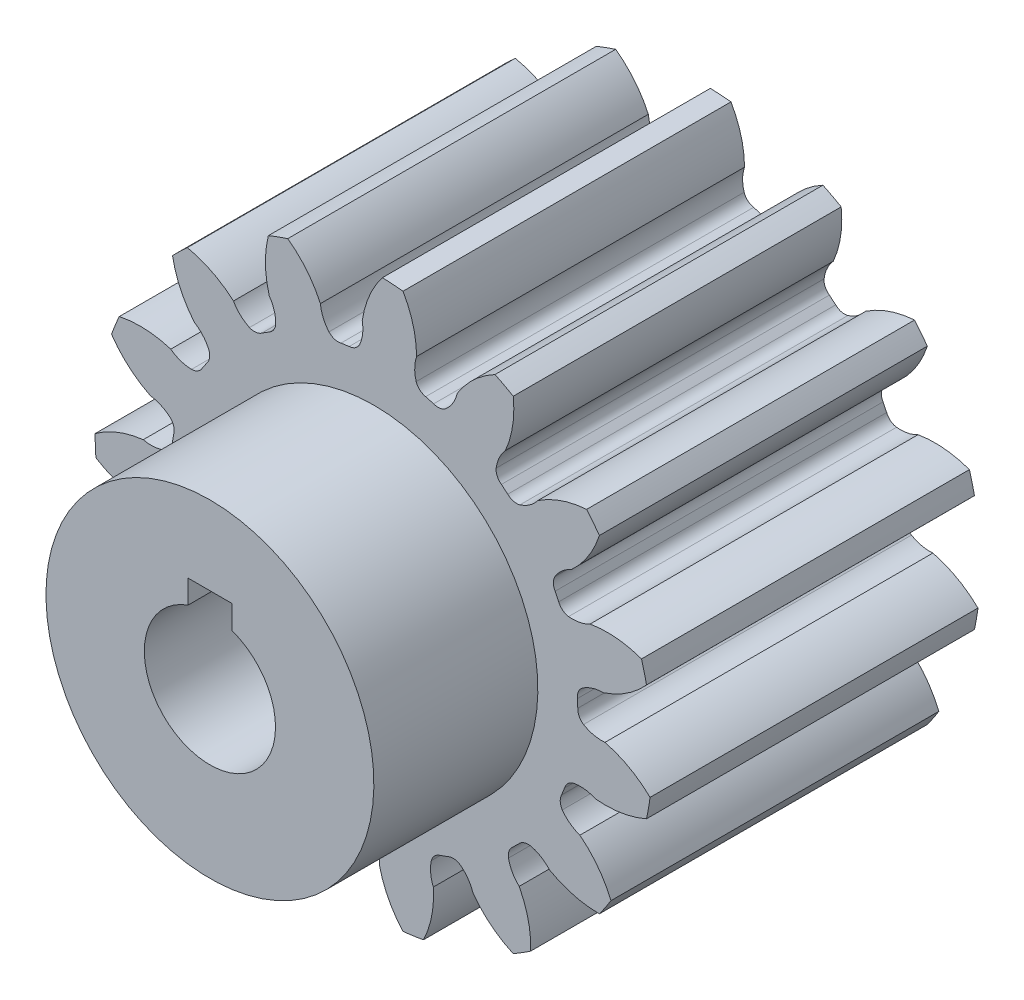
ISO-10303-21;
HEADER;
FILE_DESCRIPTION(('STEP AP214'),'2;1');
FILE_NAME('part.step','',(''),(''),'','','');
FILE_SCHEMA(('AUTOMOTIVE_DESIGN { 1 0 10303 214 1 1 1 1 }'));
ENDSEC;
DATA;
#1=APPLICATION_CONTEXT('core data for automotive mechanical design processes');
#2=APPLICATION_PROTOCOL_DEFINITION('international standard','automotive_design',2000,#1);
#3=PRODUCT_CONTEXT('',#1,'mechanical');
#4=PRODUCT('Part','Part','',(#3));
#5=PRODUCT_RELATED_PRODUCT_CATEGORY('part','',(#4));
#6=PRODUCT_DEFINITION_FORMATION('','',#4);
#7=PRODUCT_DEFINITION_CONTEXT('part definition',#1,'design');
#8=PRODUCT_DEFINITION('design','',#6,#7);
#9=PRODUCT_DEFINITION_SHAPE('','',#8);
#10=(LENGTH_UNIT() NAMED_UNIT(*) SI_UNIT(.MILLI.,.METRE.));
#11=(NAMED_UNIT(*) PLANE_ANGLE_UNIT() SI_UNIT($,.RADIAN.));
#12=(NAMED_UNIT(*) SI_UNIT($,.STERADIAN.) SOLID_ANGLE_UNIT());
#13=UNCERTAINTY_MEASURE_WITH_UNIT(LENGTH_MEASURE(1.E-05),#10,'distance_accuracy_value','');
#14=(GEOMETRIC_REPRESENTATION_CONTEXT(3) GLOBAL_UNCERTAINTY_ASSIGNED_CONTEXT((#13)) GLOBAL_UNIT_ASSIGNED_CONTEXT((#10,
#11,#12)) REPRESENTATION_CONTEXT('',''));
#15=CARTESIAN_POINT('',(0.,0.,0.));
#16=DIRECTION('',(0.,0.,1.));
#17=DIRECTION('',(1.,0.,0.));
#18=AXIS2_PLACEMENT_3D('',#15,#16,#17);
#19=CARTESIAN_POINT('',(25.5,0.,0.));
#20=DIRECTION('',(0.,0.,1.));
#21=DIRECTION('',(0.,-1.,0.));
#22=AXIS2_PLACEMENT_3D('',#19,#20,#21);
#23=PLANE('',#22);
#24=DIRECTION('',(0.,-1.,0.));
#25=VECTOR('',#24,1.);
#26=CARTESIAN_POINT('',(-2.,7.8,0.));
#27=LINE('',#26,#25);
#28=CARTESIAN_POINT('',(-2.,7.8,0.));
#29=VERTEX_POINT('',#28);
#30=CARTESIAN_POINT('',(-2.,5.65685424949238,0.));
#31=VERTEX_POINT('',#30);
#32=EDGE_CURVE('E1367',#29,#31,#27,.T.);
#33=ORIENTED_EDGE('',*,*,#32,.T.);
#34=CARTESIAN_POINT('',(0.,0.,0.));
#35=DIRECTION('',(0.,0.,1.));
#36=DIRECTION('',(0.,-1.,0.));
#37=AXIS2_PLACEMENT_3D('',#34,#35,#36);
#38=CIRCLE('',#37,6.);
#39=CARTESIAN_POINT('',(2.,5.65685424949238,0.));
#40=VERTEX_POINT('',#39);
#41=EDGE_CURVE('E830',#40,#31,#38,.F.);
#42=ORIENTED_EDGE('',*,*,#41,.F.);
#43=DIRECTION('',(0.,1.,0.));
#44=VECTOR('',#43,1.);
#45=CARTESIAN_POINT('',(2.,5.65685424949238,0.));
#46=LINE('',#45,#44);
#47=CARTESIAN_POINT('',(2.,7.8,0.));
#48=VERTEX_POINT('',#47);
#49=EDGE_CURVE('E1381',#40,#48,#46,.T.);
#50=ORIENTED_EDGE('',*,*,#49,.T.);
#51=DIRECTION('',(-1.,0.,0.));
#52=VECTOR('',#51,1.);
#53=CARTESIAN_POINT('',(2.,7.8,0.));
#54=LINE('',#53,#52);
#55=EDGE_CURVE('E1371',#48,#29,#54,.T.);
#56=ORIENTED_EDGE('',*,*,#55,.T.);
#57=EDGE_LOOP('',(#33,#42,#50,#56));
#58=FACE_BOUND('',#57,.T.);
#59=CARTESIAN_POINT('',(0.,0.,0.));
#60=DIRECTION('',(0.,0.,-1.));
#61=DIRECTION('',(0.,1.,0.));
#62=AXIS2_PLACEMENT_3D('',#59,#60,#61);
#63=CIRCLE('',#62,25.5);
#64=CARTESIAN_POINT('',(-25.4299483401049,-1.88884287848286,0.));
#65=VERTEX_POINT('',#64);
#66=CARTESIAN_POINT('',(-25.5,0.,0.));
#67=VERTEX_POINT('',#66);
#68=EDGE_CURVE('E794',#65,#67,#63,.T.);
#69=ORIENTED_EDGE('',*,*,#68,.T.);
#70=CARTESIAN_POINT('',(-20.0788047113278,-7.42317355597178,0.));
#71=DIRECTION('',(0.,0.,1.));
#72=DIRECTION('',(1.,0.,0.));
#73=AXIS2_PLACEMENT_3D('',#70,#71,#72);
#74=CIRCLE('',#73,9.192);
#75=CARTESIAN_POINT('',(-21.1016681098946,1.71173829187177,0.));
#76=VERTEX_POINT('',#75);
#77=EDGE_CURVE('E775',#76,#67,#74,.T.);
#78=ORIENTED_EDGE('',*,*,#77,.F.);
#79=CARTESIAN_POINT('',(-20.3742986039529,4.934679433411,0.));
#80=DIRECTION('',(0.,0.,1.));
#81=DIRECTION('',(1.,0.,0.));
#82=AXIS2_PLACEMENT_3D('',#79,#80,#81);
#83=CIRCLE('',#82,3.304);
#84=CARTESIAN_POINT('',(-19.103192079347,1.8849738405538,0.));
#85=VERTEX_POINT('',#84);
#86=EDGE_CURVE('E787',#76,#85,#83,.T.);
#87=ORIENTED_EDGE('',*,*,#86,.T.);
#88=CARTESIAN_POINT('',(-19.584078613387,2.92850110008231,0.));
#89=DIRECTION('',(0.,0.,1.));
#90=DIRECTION('',(1.,0.,0.));
#91=AXIS2_PLACEMENT_3D('',#88,#89,#90);
#92=CIRCLE('',#91,1.149);
#93=CARTESIAN_POINT('',(-18.4396624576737,2.8259698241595,0.));
#94=VERTEX_POINT('',#93);
#95=EDGE_CURVE('E1733',#85,#94,#92,.T.);
#96=ORIENTED_EDGE('',*,*,#95,.T.);
#97=DIRECTION('',(-0.171722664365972,-0.985145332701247,0.));
#98=VECTOR('',#97,1.);
#99=CARTESIAN_POINT('',(-18.3097967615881,3.57098845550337,0.));
#100=LINE('',#99,#98);
#101=CARTESIAN_POINT('',(-18.3097967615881,3.57098845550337,0.));
#102=VERTEX_POINT('',#101);
#103=EDGE_CURVE('E1089',#102,#94,#100,.T.);
#104=ORIENTED_EDGE('',*,*,#103,.F.);
#105=CARTESIAN_POINT('',(-19.4216233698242,3.86088946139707,0.));
#106=DIRECTION('',(0.,0.,1.));
#107=DIRECTION('',(1.,0.,0.));
#108=AXIS2_PLACEMENT_3D('',#105,#106,#107);
#109=CIRCLE('',#108,1.149);
#110=CARTESIAN_POINT('',(-18.6162329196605,4.6803693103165,0.));
#111=VERTEX_POINT('',#110);
#112=EDGE_CURVE('E1730',#102,#111,#109,.T.);
#113=ORIENTED_EDGE('',*,*,#112,.T.);
#114=CARTESIAN_POINT('',(-20.8439142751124,2.24031771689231,0.));
#115=DIRECTION('',(0.,0.,1.));
#116=DIRECTION('',(1.,0.,0.));
#117=AXIS2_PLACEMENT_3D('',#114,#115,#116);
#118=CIRCLE('',#117,3.30399999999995);
#119=CARTESIAN_POINT('',(-20.439074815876,5.51942140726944,0.));
#120=VERTEX_POINT('',#119);
#121=EDGE_CURVE('E1108',#111,#120,#118,.T.);
#122=ORIENTED_EDGE('',*,*,#121,.T.);
#123=CARTESIAN_POINT('',(-16.3876497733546,13.7704103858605,0.));
#124=DIRECTION('',(0.,0.,1.));
#125=DIRECTION('',(1.,0.,0.));
#126=AXIS2_PLACEMENT_3D('',#123,#124,#125);
#127=CIRCLE('',#126,9.192);
#128=CARTESIAN_POINT('',(-23.9996754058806,8.61774798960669,0.));
#129=VERTEX_POINT('',#128);
#130=EDGE_CURVE('E1726',#129,#120,#127,.T.);
#131=ORIENTED_EDGE('',*,*,#130,.F.);
#132=CARTESIAN_POINT('',(-23.2954091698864,10.3717843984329,0.));
#133=VERTEX_POINT('',#132);
#134=EDGE_CURVE('E805',#129,#133,#63,.T.);
#135=ORIENTED_EDGE('',*,*,#134,.T.);
#136=CARTESIAN_POINT('',(-21.3621775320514,1.38537914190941,0.));
#137=DIRECTION('',(0.,0.,1.));
#138=DIRECTION('',(1.,0.,0.));
#139=AXIS2_PLACEMENT_3D('',#136,#137,#138);
#140=CIRCLE('',#139,9.192);
#141=CARTESIAN_POINT('',(-18.5811063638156,10.1465723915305,0.));
#142=VERTEX_POINT('',#141);
#143=EDGE_CURVE('E1724',#142,#133,#140,.T.);
#144=ORIENTED_EDGE('',*,*,#143,.F.);
#145=CARTESIAN_POINT('',(-16.6057329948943,12.7950278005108,0.));
#146=DIRECTION('',(0.,0.,1.));
#147=DIRECTION('',(1.,0.,0.));
#148=AXIS2_PLACEMENT_3D('',#145,#146,#147);
#149=CIRCLE('',#148,3.30400000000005);
#150=CARTESIAN_POINT('',(-16.684946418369,9.49197750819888,0.));
#151=VERTEX_POINT('',#150);
#152=EDGE_CURVE('E1721',#142,#151,#149,.T.);
#153=ORIENTED_EDGE('',*,*,#152,.T.);
#154=CARTESIAN_POINT('',(-16.699817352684,10.6408812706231,0.));
#155=DIRECTION('',(0.,0.,1.));
#156=DIRECTION('',(1.,0.,0.));
#157=AXIS2_PLACEMENT_3D('',#154,#155,#156);
#158=CIRCLE('',#157,1.149);
#159=CARTESIAN_POINT('',(-15.6960443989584,10.081738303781,0.));
#160=VERTEX_POINT('',#159);
#161=EDGE_CURVE('E1718',#151,#160,#158,.T.);
#162=ORIENTED_EDGE('',*,*,#161,.T.);
#163=DIRECTION('',(-0.557571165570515,-0.830129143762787,0.));
#164=VECTOR('',#163,1.);
#165=CARTESIAN_POINT('',(-15.2743798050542,10.7095255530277,0.));
#166=LINE('',#165,#164);
#167=CARTESIAN_POINT('',(-15.2743798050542,10.7095255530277,0.));
#168=VERTEX_POINT('',#167);
#169=EDGE_CURVE('E1715',#168,#160,#166,.T.);
#170=ORIENTED_EDGE('',*,*,#169,.F.);
#171=CARTESIAN_POINT('',(-16.1721705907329,11.4265839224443,0.));
#172=DIRECTION('',(0.,0.,1.));
#173=DIRECTION('',(1.,0.,0.));
#174=AXIS2_PLACEMENT_3D('',#171,#172,#173);
#175=CIRCLE('',#174,1.149);
#176=CARTESIAN_POINT('',(-15.1030973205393,11.8476342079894,0.));
#177=VERTEX_POINT('',#176);
#178=EDGE_CURVE('E1712',#168,#177,#175,.T.);
#179=ORIENTED_EDGE('',*,*,#178,.T.);
#180=CARTESIAN_POINT('',(-18.1306438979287,10.5246157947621,0.));
#181=DIRECTION('',(0.,0.,1.));
#182=DIRECTION('',(1.,0.,0.));
#183=AXIS2_PLACEMENT_3D('',#180,#181,#182);
#184=CIRCLE('',#183,3.30400000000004);
#185=CARTESIAN_POINT('',(-16.4270730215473,13.3555630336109,0.));
#186=VERTEX_POINT('',#185);
#187=EDGE_CURVE('E1709',#177,#186,#184,.T.);
#188=ORIENTED_EDGE('',*,*,#187,.T.);
#189=CARTESIAN_POINT('',(-9.36993251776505,19.2453535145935,0.));
#190=DIRECTION('',(0.,0.,1.));
#191=DIRECTION('',(1.,0.,0.));
#192=AXIS2_PLACEMENT_3D('',#189,#190,#191);
#193=CIRCLE('',#192,9.19199999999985);
#194=CARTESIAN_POINT('',(-18.4196405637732,17.6342519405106,0.));
#195=VERTEX_POINT('',#194);
#196=EDGE_CURVE('E1706',#195,#186,#193,.T.);
#197=ORIENTED_EDGE('',*,*,#196,.F.);
#198=CARTESIAN_POINT('',(-17.0628304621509,18.9501930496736,0.));
#199=VERTEX_POINT('',#198);
#200=EDGE_CURVE('E810',#195,#199,#63,.T.);
#201=ORIENTED_EDGE('',*,*,#200,.T.);
#202=CARTESIAN_POINT('',(-18.951835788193,9.95438720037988,0.));
#203=DIRECTION('',(0.,0.,1.));
#204=DIRECTION('',(1.,0.,0.));
#205=AXIS2_PLACEMENT_3D('',#202,#203,#204);
#206=CIRCLE('',#205,9.192);
#207=CARTESIAN_POINT('',(-12.8477025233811,16.8269719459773,0.));
#208=VERTEX_POINT('',#207);
#209=EDGE_CURVE('E1704',#208,#199,#206,.T.);
#210=ORIENTED_EDGE('',*,*,#209,.F.);
#211=CARTESIAN_POINT('',(-9.96588529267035,18.4429996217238,0.));
#212=DIRECTION('',(0.,0.,1.));
#213=DIRECTION('',(1.,0.,0.));
#214=AXIS2_PLACEMENT_3D('',#211,#212,#213);
#215=CIRCLE('',#214,3.30399999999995);
#216=CARTESIAN_POINT('',(-11.3817219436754,15.4577320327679,0.));
#217=VERTEX_POINT('',#216);
#218=EDGE_CURVE('E1701',#208,#217,#215,.T.);
#219=ORIENTED_EDGE('',*,*,#218,.T.);
#220=CARTESIAN_POINT('',(-10.9280059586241,16.5133564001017,0.));
#221=DIRECTION('',(0.,0.,1.));
#222=DIRECTION('',(1.,0.,0.));
#223=AXIS2_PLACEMENT_3D('',#220,#221,#222);
#224=CIRCLE('',#223,1.149);
#225=CARTESIAN_POINT('',(-10.2384376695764,15.5942826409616,0.));
#226=VERTEX_POINT('',#225);
#227=EDGE_CURVE('E1698',#217,#226,#224,.T.);
#228=ORIENTED_EDGE('',*,*,#227,.T.);
#229=DIRECTION('',(-0.847010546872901,-0.531576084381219,0.));
#230=VECTOR('',#229,1.);
#231=CARTESIAN_POINT('',(-9.59788381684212,15.9962883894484,0.));
#232=LINE('',#231,#230);
#233=CARTESIAN_POINT('',(-9.59788381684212,15.9962883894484,0.));
#234=VERTEX_POINT('',#233);
#235=EDGE_CURVE('E1695',#234,#226,#232,.T.);
#236=ORIENTED_EDGE('',*,*,#235,.F.);
#237=CARTESIAN_POINT('',(-10.1264025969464,17.0165182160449,0.));
#238=DIRECTION('',(0.,0.,1.));
#239=DIRECTION('',(1.,0.,0.));
#240=AXIS2_PLACEMENT_3D('',#237,#238,#239);
#241=CIRCLE('',#240,1.149);
#242=CARTESIAN_POINT('',(-8.97849898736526,16.966335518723,0.));
#243=VERTEX_POINT('',#242);
#244=EDGE_CURVE('E1692',#234,#243,#241,.T.);
#245=ORIENTED_EDGE('',*,*,#244,.T.);
#246=CARTESIAN_POINT('',(-12.2824204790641,16.9891121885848,0.));
#247=DIRECTION('',(0.,0.,1.));
#248=DIRECTION('',(1.,0.,0.));
#249=AXIS2_PLACEMENT_3D('',#246,#247,#248);
#250=CIRCLE('',#249,3.304);
#251=CARTESIAN_POINT('',(-9.57468106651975,18.8824064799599,0.));
#252=VERTEX_POINT('',#251);
#253=EDGE_CURVE('E1689',#243,#252,#250,.T.);
#254=ORIENTED_EDGE('',*,*,#253,.T.);
#255=CARTESIAN_POINT('',(-0.732068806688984,21.3926001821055,0.));
#256=DIRECTION('',(0.,0.,1.));
#257=DIRECTION('',(1.,0.,0.));
#258=AXIS2_PLACEMENT_3D('',#255,#256,#257);
#259=CIRCLE('',#258,9.192);
#260=CARTESIAN_POINT('',(-9.65468253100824,23.6016335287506,0.));
#261=VERTEX_POINT('',#260);
#262=EDGE_CURVE('E1686',#261,#252,#259,.T.);
#263=ORIENTED_EDGE('',*,*,#262,.F.);
#264=CARTESIAN_POINT('',(-7.87993335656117,24.2519411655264,0.));
#265=VERTEX_POINT('',#264);
#266=EDGE_CURVE('E1784',#261,#265,#63,.T.);
#267=ORIENTED_EDGE('',*,*,#266,.T.);
#268=CARTESIAN_POINT('',(-13.2645494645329,16.8021912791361,0.));
#269=DIRECTION('',(0.,0.,1.));
#270=DIRECTION('',(1.,0.,0.));
#271=AXIS2_PLACEMENT_3D('',#268,#269,#270);
#272=CIRCLE('',#271,9.192);
#273=CARTESIAN_POINT('',(-4.8928141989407,20.5978351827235,0.));
#274=VERTEX_POINT('',#273);
#275=EDGE_CURVE('E1684',#274,#265,#272,.T.);
#276=ORIENTED_EDGE('',*,*,#275,.F.);
#277=CARTESIAN_POINT('',(-1.60284548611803,20.9020092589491,0.));
#278=DIRECTION('',(0.,0.,1.));
#279=DIRECTION('',(1.,0.,0.));
#280=AXIS2_PLACEMENT_3D('',#277,#278,#279);
#281=CIRCLE('',#280,3.30399999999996);
#282=CARTESIAN_POINT('',(-4.11049434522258,18.7507042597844,0.));
#283=VERTEX_POINT('',#282);
#284=EDGE_CURVE('E1681',#274,#283,#281,.T.);
#285=ORIENTED_EDGE('',*,*,#284,.T.);
#286=CARTESIAN_POINT('',(-3.26664305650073,19.5305221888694,0.));
#287=DIRECTION('',(0.,0.,1.));
#288=DIRECTION('',(1.,0.,0.));
#289=AXIS2_PLACEMENT_3D('',#286,#287,#288);
#290=CIRCLE('',#289,1.14899999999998);
#291=CARTESIAN_POINT('',(-3.01051205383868,18.4104338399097,0.));
#292=VERTEX_POINT('',#291);
#293=EDGE_CURVE('E1678',#283,#292,#290,.T.);
#294=ORIENTED_EDGE('',*,*,#293,.T.);
#295=DIRECTION('',(-0.989994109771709,-0.141108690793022,0.));
#296=VECTOR('',#295,1.);
#297=CARTESIAN_POINT('',(-2.26182652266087,18.5171476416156,0.));
#298=LINE('',#297,#296);
#299=CARTESIAN_POINT('',(-2.26182652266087,18.5171476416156,0.));
#300=VERTEX_POINT('',#299);
#301=EDGE_CURVE('E1675',#300,#292,#298,.T.);
#302=ORIENTED_EDGE('',*,*,#301,.F.);
#303=CARTESIAN_POINT('',(-2.32968759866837,19.6641419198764,0.));
#304=DIRECTION('',(0.,0.,1.));
#305=DIRECTION('',(1.,0.,0.));
#306=AXIS2_PLACEMENT_3D('',#303,#304,#305);
#307=CIRCLE('',#306,1.14900000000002);
#308=CARTESIAN_POINT('',(-1.30143661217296,19.1514032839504,0.));
#309=VERTEX_POINT('',#308);
#310=EDGE_CURVE('E1672',#300,#309,#307,.T.);
#311=ORIENTED_EDGE('',*,*,#310,.T.);
#312=CARTESIAN_POINT('',(-4.3104549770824,20.5160367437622,0.));
#313=DIRECTION('',(0.,0.,1.));
#314=DIRECTION('',(1.,0.,0.));
#315=AXIS2_PLACEMENT_3D('',#312,#313,#314);
#316=CIRCLE('',#315,3.304);
#317=CARTESIAN_POINT('',(-1.06673977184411,21.1443103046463,0.));
#318=VERTEX_POINT('',#317);
#319=EDGE_CURVE('E1669',#309,#318,#316,.T.);
#320=ORIENTED_EDGE('',*,*,#319,.T.);
#321=CARTESIAN_POINT('',(8.03237625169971,19.8408719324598,0.));
#322=DIRECTION('',(0.,0.,1.));
#323=DIRECTION('',(1.,0.,0.));
#324=AXIS2_PLACEMENT_3D('',#321,#322,#323);
#325=CIRCLE('',#324,9.192);
#326=CARTESIAN_POINT('',(0.779657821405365,25.4880782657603,0.));
#327=VERTEX_POINT('',#326);
#328=EDGE_CURVE('E1666',#327,#318,#325,.T.);
#329=ORIENTED_EDGE('',*,*,#328,.F.);
#330=CARTESIAN_POINT('',(2.66547581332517,25.360308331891,0.));
#331=VERTEX_POINT('',#330);
#332=EDGE_CURVE('E1786',#327,#331,#63,.T.);
#333=ORIENTED_EDGE('',*,*,#332,.T.);
#334=CARTESIAN_POINT('',(-5.28370203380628,20.744743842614,0.));
#335=DIRECTION('',(0.,0.,1.));
#336=DIRECTION('',(1.,0.,0.));
#337=AXIS2_PLACEMENT_3D('',#334,#335,#336);
#338=CIRCLE('',#337,9.192);
#339=CARTESIAN_POINT('',(3.90808615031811,20.8071455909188,0.));
#340=VERTEX_POINT('',#339);
#341=EDGE_CURVE('E1664',#340,#331,#338,.T.);
#342=ORIENTED_EDGE('',*,*,#341,.F.);
#343=CARTESIAN_POINT('',(7.03734086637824,19.7468716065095,0.));
#344=DIRECTION('',(0.,0.,1.));
#345=DIRECTION('',(1.,0.,0.));
#346=AXIS2_PLACEMENT_3D('',#343,#344,#345);
#347=CIRCLE('',#346,3.304);
#348=CARTESIAN_POINT('',(3.87147506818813,18.8015093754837,0.));
#349=VERTEX_POINT('',#348);
#350=EDGE_CURVE('E1661',#340,#349,#347,.T.);
#351=ORIENTED_EDGE('',*,*,#350,.T.);
#352=CARTESIAN_POINT('',(4.9595521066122,19.1706832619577,0.));
#353=DIRECTION('',(0.,0.,1.));
#354=DIRECTION('',(1.,0.,0.));
#355=AXIS2_PLACEMENT_3D('',#352,#353,#354);
#356=CIRCLE('',#355,1.14900000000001);
#357=CARTESIAN_POINT('',(4.73795844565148,18.0432537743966,0.));
#358=VERTEX_POINT('',#357);
#359=EDGE_CURVE('E1658',#349,#358,#356,.T.);
#360=ORIENTED_EDGE('',*,*,#359,.T.);
#361=DIRECTION('',(-0.961798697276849,0.273757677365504,0.));
#362=VECTOR('',#361,1.);
#363=CARTESIAN_POINT('',(5.46532112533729,17.8362238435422,0.));
#364=LINE('',#363,#362);
#365=CARTESIAN_POINT('',(5.46532112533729,17.8362238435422,0.));
#366=VERTEX_POINT('',#365);
#367=EDGE_CURVE('E1655',#366,#358,#364,.T.);
#368=ORIENTED_EDGE('',*,*,#367,.F.);
#369=CARTESIAN_POINT('',(5.86985154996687,18.9116568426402,0.));
#370=DIRECTION('',(0.,0.,1.));
#371=DIRECTION('',(1.,0.,0.));
#372=AXIS2_PLACEMENT_3D('',#369,#370,#371);
#373=CIRCLE('',#372,1.14899999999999);
#374=CARTESIAN_POINT('',(6.60065597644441,18.0250194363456,0.));
#375=VERTEX_POINT('',#374);
#376=EDGE_CURVE('E1652',#366,#375,#373,.T.);
#377=ORIENTED_EDGE('',*,*,#376,.T.);
#378=CARTESIAN_POINT('',(4.406827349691,20.4955521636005,0.));
#379=DIRECTION('',(0.,0.,1.));
#380=DIRECTION('',(1.,0.,0.));
#381=AXIS2_PLACEMENT_3D('',#378,#379,#380);
#382=CIRCLE('',#381,3.304);
#383=CARTESIAN_POINT('',(7.62565052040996,19.7501707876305,0.));
#384=VERTEX_POINT('',#383);
#385=EDGE_CURVE('E1649',#375,#384,#382,.T.);
#386=ORIENTED_EDGE('',*,*,#385,.T.);
#387=CARTESIAN_POINT('',(15.4079504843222,14.8584766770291,0.));
#388=DIRECTION('',(0.,0.,1.));
#389=DIRECTION('',(1.,0.,0.));
#390=AXIS2_PLACEMENT_3D('',#387,#388,#389);
#391=CIRCLE('',#390,9.192);
#392=CARTESIAN_POINT('',(11.079188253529,22.9674027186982,0.));
#393=VERTEX_POINT('',#392);
#394=EDGE_CURVE('E1646',#393,#384,#391,.T.);
#395=ORIENTED_EDGE('',*,*,#394,.F.);
#396=CARTESIAN_POINT('',(12.75,22.0836477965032,0.));
#397=VERTEX_POINT('',#396);
#398=EDGE_CURVE('E1791',#393,#397,#63,.T.);
#399=ORIENTED_EDGE('',*,*,#398,.T.);
#400=CARTESIAN_POINT('',(3.61074547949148,21.1003417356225,0.));
#401=DIRECTION('',(0.,0.,1.));
#402=DIRECTION('',(1.,0.,0.));
#403=AXIS2_PLACEMENT_3D('',#400,#401,#402);
#404=CIRCLE('',#403,9.192);
#405=CARTESIAN_POINT('',(12.0332429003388,17.4187114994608,0.));
#406=VERTEX_POINT('',#405);
#407=EDGE_CURVE('E1644',#406,#397,#404,.T.);
#408=ORIENTED_EDGE('',*,*,#407,.F.);
#409=CARTESIAN_POINT('',(14.4607070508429,15.1773204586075,0.));
#410=DIRECTION('',(0.,0.,1.));
#411=DIRECTION('',(1.,0.,0.));
#412=AXIS2_PLACEMENT_3D('',#409,#410,#411);
#413=CIRCLE('',#412,3.30399999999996);
#414=CARTESIAN_POINT('',(11.1840312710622,15.6013627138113,0.));
#415=VERTEX_POINT('',#414);
#416=EDGE_CURVE('E1641',#406,#415,#413,.T.);
#417=ORIENTED_EDGE('',*,*,#416,.T.);
#418=CARTESIAN_POINT('',(12.3281956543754,15.4960590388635,0.));
#419=DIRECTION('',(0.,0.,1.));
#420=DIRECTION('',(1.,0.,0.));
#421=AXIS2_PLACEMENT_3D('',#418,#419,#420);
#422=CIRCLE('',#421,1.149);
#423=CARTESIAN_POINT('',(11.6671928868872,14.5562312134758,0.));
#424=VERTEX_POINT('',#423);
#425=EDGE_CURVE('E1638',#415,#424,#422,.T.);
#426=ORIENTED_EDGE('',*,*,#425,.T.);
#427=DIRECTION('',(-0.767299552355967,0.641288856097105,0.));
#428=VECTOR('',#427,1.);
#429=CARTESIAN_POINT('',(12.2474650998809,14.0712549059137,0.));
#430=LINE('',#429,#428);
#431=CARTESIAN_POINT('',(12.2474650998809,14.0712549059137,0.));
#432=VERTEX_POINT('',#431);
#433=EDGE_CURVE('E1635',#432,#424,#430,.T.);
#434=ORIENTED_EDGE('',*,*,#433,.F.);
#435=CARTESIAN_POINT('',(13.0544400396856,14.8891744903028,0.));
#436=DIRECTION('',(0.,0.,1.));
#437=DIRECTION('',(1.,0.,0.));
#438=AXIS2_PLACEMENT_3D('',#435,#436,#437);
#439=CIRCLE('',#438,1.149);
#440=CARTESIAN_POINT('',(13.3614351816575,13.7819459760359,0.));
#441=VERTEX_POINT('',#440);
#442=EDGE_CURVE('E1632',#432,#441,#439,.T.);
#443=ORIENTED_EDGE('',*,*,#442,.T.);
#444=CARTESIAN_POINT('',(12.3621291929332,16.9312004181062,0.));
#445=DIRECTION('',(0.,0.,1.));
#446=DIRECTION('',(1.,0.,0.));
#447=AXIS2_PLACEMENT_3D('',#444,#445,#446);
#448=CIRCLE('',#447,3.304);
#449=CARTESIAN_POINT('',(14.999496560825,14.9410473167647,0.));
#450=VERTEX_POINT('',#449);
#451=EDGE_CURVE('E1629',#441,#450,#448,.T.);
#452=ORIENTED_EDGE('',*,*,#451,.T.);
#453=CARTESIAN_POINT('',(20.1193501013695,7.3069158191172,0.));
#454=DIRECTION('',(0.,0.,1.));
#455=DIRECTION('',(1.,0.,0.));
#456=AXIS2_PLACEMENT_3D('',#453,#454,#455);
#457=CIRCLE('',#456,9.192);
#458=CARTESIAN_POINT('',(19.463026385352,16.4754545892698,0.));
#459=VERTEX_POINT('',#458);
#460=EDGE_CURVE('E1626',#459,#450,#457,.T.);
#461=ORIENTED_EDGE('',*,*,#460,.F.);
#462=CARTESIAN_POINT('',(20.6299333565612,14.9885239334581,0.));
#463=VERTEX_POINT('',#462);
#464=EDGE_CURVE('E815',#459,#463,#63,.T.);
#465=ORIENTED_EDGE('',*,*,#464,.T.);
#466=CARTESIAN_POINT('',(11.8808622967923,17.807498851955,0.));
#467=DIRECTION('',(0.,0.,1.));
#468=DIRECTION('',(1.,0.,0.));
#469=AXIS2_PLACEMENT_3D('',#466,#467,#468);
#470=CIRCLE('',#469,9.192);
#471=CARTESIAN_POINT('',(18.0777426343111,11.0184239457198,0.));
#472=VERTEX_POINT('',#471);
#473=EDGE_CURVE('E1624',#472,#463,#470,.T.);
#474=ORIENTED_EDGE('',*,*,#473,.F.);
#475=CARTESIAN_POINT('',(19.3836856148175,7.98347272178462,0.));
#476=DIRECTION('',(0.,0.,1.));
#477=DIRECTION('',(1.,0.,0.));
#478=AXIS2_PLACEMENT_3D('',#475,#476,#477);
#479=CIRCLE('',#478,3.30399999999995);
#480=CARTESIAN_POINT('',(16.5627668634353,9.70359870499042,0.));
#481=VERTEX_POINT('',#480);
#482=EDGE_CURVE('E1621',#472,#481,#479,.T.);
#483=ORIENTED_EDGE('',*,*,#482,.T.);
#484=CARTESIAN_POINT('',(17.5651821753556,9.14202543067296,0.));
#485=DIRECTION('',(0.,0.,1.));
#486=DIRECTION('',(1.,0.,0.));
#487=AXIS2_PLACEMENT_3D('',#484,#485,#486);
#488=CIRCLE('',#487,1.149);
#489=CARTESIAN_POINT('',(16.5790636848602,8.55230403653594,0.));
#490=VERTEX_POINT('',#489);
#491=EDGE_CURVE('E1618',#481,#490,#488,.T.);
#492=ORIENTED_EDGE('',*,*,#491,.T.);
#493=DIRECTION('',(-0.440127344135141,0.897935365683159,0.));
#494=VECTOR('',#493,1.);
#495=CARTESIAN_POINT('',(16.9119110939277,7.87323816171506,0.));
#496=LINE('',#495,#494);
#497=CARTESIAN_POINT('',(16.9119110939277,7.87323816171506,0.));
#498=VERTEX_POINT('',#497);
#499=EDGE_CURVE('E1615',#498,#490,#496,.T.);
#500=ORIENTED_EDGE('',*,*,#499,.F.);
#501=CARTESIAN_POINT('',(17.9817972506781,8.29221860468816,0.));
#502=DIRECTION('',(0.,0.,1.));
#503=DIRECTION('',(1.,0.,0.));
#504=AXIS2_PLACEMENT_3D('',#501,#502,#503);
#505=CIRCLE('',#504,1.149);
#506=CARTESIAN_POINT('',(17.8119008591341,7.15584885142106,0.));
#507=VERTEX_POINT('',#506);
#508=EDGE_CURVE('E1612',#498,#507,#505,.T.);
#509=ORIENTED_EDGE('',*,*,#508,.T.);
#510=CARTESIAN_POINT('',(18.1799065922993,10.4392903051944,0.));
#511=DIRECTION('',(0.,0.,1.));
#512=DIRECTION('',(1.,0.,0.));
#513=AXIS2_PLACEMENT_3D('',#510,#511,#512);
#514=CIRCLE('',#513,3.304);
#515=CARTESIAN_POINT('',(19.7797933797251,7.54848102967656,0.));
#516=VERTEX_POINT('',#515);
#517=EDGE_CURVE('E1609',#507,#516,#514,.T.);
#518=ORIENTED_EDGE('',*,*,#517,.T.);
#519=CARTESIAN_POINT('',(21.3519313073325,-1.50807716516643,0.));
#520=DIRECTION('',(0.,0.,1.));
#521=DIRECTION('',(1.,0.,0.));
#522=AXIS2_PLACEMENT_3D('',#519,#520,#521);
#523=CIRCLE('',#522,9.192);
#524=CARTESIAN_POINT('',(24.4815304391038,7.13475068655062,0.));
#525=VERTEX_POINT('',#524);
#526=EDGE_CURVE('E1606',#525,#516,#523,.T.);
#527=ORIENTED_EDGE('',*,*,#526,.F.);
#528=CARTESIAN_POINT('',(24.942763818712,5.30174811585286,0.));
#529=VERTEX_POINT('',#528);
#530=EDGE_CURVE('E811',#525,#529,#63,.T.);
#531=ORIENTED_EDGE('',*,*,#530,.T.);
#532=CARTESIAN_POINT('',(18.0966700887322,11.4355776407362,0.));
#533=DIRECTION('',(0.,0.,1.));
#534=DIRECTION('',(1.,0.,0.));
#535=AXIS2_PLACEMENT_3D('',#532,#533,#534);
#536=CIRCLE('',#535,9.192);
#537=CARTESIAN_POINT('',(20.996436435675,2.7129507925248,0.));
#538=VERTEX_POINT('',#537);
#539=EDGE_CURVE('E1604',#538,#529,#536,.T.);
#540=ORIENTED_EDGE('',*,*,#539,.F.);
#541=CARTESIAN_POINT('',(20.9550488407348,-0.590789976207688,0.));
#542=DIRECTION('',(0.,0.,1.));
#543=DIRECTION('',(1.,0.,0.));
#544=AXIS2_PLACEMENT_3D('',#541,#542,#543);
#545=CIRCLE('',#544,3.304);
#546=CARTESIAN_POINT('',(19.0776495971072,2.12799432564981,0.));
#547=VERTEX_POINT('',#546);
#548=EDGE_CURVE('E1601',#538,#547,#545,.T.);
#549=ORIENTED_EDGE('',*,*,#548,.T.);
#550=CARTESIAN_POINT('',(19.7649891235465,1.20725257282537,0.));
#551=DIRECTION('',(0.,0.,1.));
#552=DIRECTION('',(1.,0.,0.));
#553=AXIS2_PLACEMENT_3D('',#550,#551,#552);
#554=CIRCLE('',#553,1.14900000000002);
#555=CARTESIAN_POINT('',(18.6242637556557,1.06960579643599,0.));
#556=VERTEX_POINT('',#555);
#557=EDGE_CURVE('E1598',#547,#556,#554,.T.);
#558=ORIENTED_EDGE('',*,*,#557,.T.);
#559=DIRECTION('',(-0.0368531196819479,0.999320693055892,0.));
#560=VECTOR('',#559,1.);
#561=CARTESIAN_POINT('',(18.6521340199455,0.31386701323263,0.));
#562=LINE('',#561,#560);
#563=CARTESIAN_POINT('',(18.6521340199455,0.31386701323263,0.));
#564=VERTEX_POINT('',#563);
#565=EDGE_CURVE('E1595',#564,#556,#562,.T.);
#566=ORIENTED_EDGE('',*,*,#565,.F.);
#567=CARTESIAN_POINT('',(19.7999383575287,0.261462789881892,0.));
#568=DIRECTION('',(0.,0.,1.));
#569=DIRECTION('',(1.,0.,0.));
#570=AXIS2_PLACEMENT_3D('',#567,#568,#569);
#571=CIRCLE('',#570,1.149);
#572=CARTESIAN_POINT('',(19.1825270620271,-0.70755954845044,0.));
#573=VERTEX_POINT('',#572);
#574=EDGE_CURVE('E1593',#564,#573,#571,.T.);
#575=ORIENTED_EDGE('',*,*,#574,.T.);
#576=CARTESIAN_POINT('',(20.8542129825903,2.14233206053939,0.));
#577=DIRECTION('',(0.,0.,1.));
#578=DIRECTION('',(1.,0.,0.));
#579=AXIS2_PLACEMENT_3D('',#576,#577,#578);
#580=CIRCLE('',#579,3.304);
#581=CARTESIAN_POINT('',(21.139984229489,-1.14928620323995,0.));
#582=VERTEX_POINT('',#581);
#583=EDGE_CURVE('E1590',#573,#582,#580,.T.);
#584=ORIENTED_EDGE('',*,*,#583,.T.);
#585=CARTESIAN_POINT('',(18.8925696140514,-10.0623099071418,0.));
#586=DIRECTION('',(0.,0.,1.));
#587=DIRECTION('',(1.,0.,0.));
#588=AXIS2_PLACEMENT_3D('',#585,#586,#587);
#589=CIRCLE('',#588,9.192);
#590=CARTESIAN_POINT('',(25.2669554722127,-3.43961642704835,0.));
#591=VERTEX_POINT('',#590);
#592=EDGE_CURVE('E1587',#591,#582,#589,.T.);
#593=ORIENTED_EDGE('',*,*,#592,.F.);
#594=CARTESIAN_POINT('',(24.942763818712,-5.30174811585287,0.));
#595=VERTEX_POINT('',#594);
#596=EDGE_CURVE('E817',#591,#595,#63,.T.);
#597=ORIENTED_EDGE('',*,*,#596,.T.);
#598=CARTESIAN_POINT('',(21.1833992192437,3.08634116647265,0.));
#599=DIRECTION('',(0.,0.,1.));
#600=DIRECTION('',(1.,0.,0.));
#601=AXIS2_PLACEMENT_3D('',#598,#599,#600);
#602=CIRCLE('',#601,9.192);
#603=CARTESIAN_POINT('',(20.2846556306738,-6.06161619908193,0.));
#604=VERTEX_POINT('',#603);
#605=EDGE_CURVE('E1585',#604,#595,#602,.T.);
#606=ORIENTED_EDGE('',*,*,#605,.F.);
#607=CARTESIAN_POINT('',(18.9030937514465,-9.06289972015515,0.));
#608=DIRECTION('',(0.,0.,1.));
#609=DIRECTION('',(1.,0.,0.));
#610=AXIS2_PLACEMENT_3D('',#607,#608,#609);
#611=CIRCLE('',#610,3.30399999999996);
#612=CARTESIAN_POINT('',(18.2938334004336,-5.81555960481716,0.));
#613=VERTEX_POINT('',#612);
#614=EDGE_CURVE('E1582',#604,#613,#611,.T.);
#615=ORIENTED_EDGE('',*,*,#614,.T.);
#616=CARTESIAN_POINT('',(18.5472498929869,-6.93626522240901,0.));
#617=DIRECTION('',(0.,0.,1.));
#618=DIRECTION('',(1.,0.,0.));
#619=AXIS2_PLACEMENT_3D('',#616,#617,#618);
#620=CIRCLE('',#619,1.14899999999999);
#621=CARTESIAN_POINT('',(17.4491594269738,-6.59803700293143,0.));
#622=VERTEX_POINT('',#621);
#623=EDGE_CURVE('E1579',#613,#622,#620,.T.);
#624=ORIENTED_EDGE('',*,*,#623,.T.);
#625=DIRECTION('',(0.37279334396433,0.927914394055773,0.));
#626=VECTOR('',#625,1.);
#627=CARTESIAN_POINT('',(17.1672335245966,-7.29977459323,0.));
#628=LINE('',#627,#626);
#629=CARTESIAN_POINT('',(17.1672335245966,-7.29977459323,0.));
#630=VERTEX_POINT('',#629);
#631=EDGE_CURVE('E1576',#630,#622,#628,.T.);
#632=ORIENTED_EDGE('',*,*,#631,.F.);
#633=CARTESIAN_POINT('',(18.1944902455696,-7.81450231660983,0.));
#634=DIRECTION('',(0.,0.,1.));
#635=DIRECTION('',(1.,0.,0.));
#636=AXIS2_PLACEMENT_3D('',#633,#634,#635);
#637=CIRCLE('',#636,1.14900000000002);
#638=CARTESIAN_POINT('',(17.2363200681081,-8.44862447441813,0.));
#639=VERTEX_POINT('',#638);
#640=EDGE_CURVE('E1573',#630,#639,#637,.T.);
#641=ORIENTED_EDGE('',*,*,#640,.T.);
#642=CARTESIAN_POINT('',(19.9226364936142,-6.52505485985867,0.));
#643=DIRECTION('',(0.,0.,1.));
#644=DIRECTION('',(1.,0.,0.));
#645=AXIS2_PLACEMENT_3D('',#642,#643,#644);
#646=CIRCLE('',#645,3.304);
#647=CARTESIAN_POINT('',(18.8448797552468,-9.64833141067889,0.));
#648=VERTEX_POINT('',#647);
#649=EDGE_CURVE('E1570',#639,#648,#646,.T.);
#650=ORIENTED_EDGE('',*,*,#649,.T.);
#651=CARTESIAN_POINT('',(13.166511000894,-16.8766778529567,0.));
#652=DIRECTION('',(0.,0.,1.));
#653=DIRECTION('',(1.,0.,0.));
#654=AXIS2_PLACEMENT_3D('',#651,#652,#653);
#655=CIRCLE('',#654,9.192);
#656=CARTESIAN_POINT('',(21.6834943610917,-13.4192426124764,0.));
#657=VERTEX_POINT('',#656);
#658=EDGE_CURVE('E1567',#657,#648,#655,.T.);
#659=ORIENTED_EDGE('',*,*,#658,.F.);
#660=CARTESIAN_POINT('',(20.6299333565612,-14.9885239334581,0.));
#661=VERTEX_POINT('',#660);
#662=EDGE_CURVE('E1873',#657,#661,#63,.T.);
#663=ORIENTED_EDGE('',*,*,#662,.T.);
#664=CARTESIAN_POINT('',(20.6073261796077,-5.7965517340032,0.));
#665=DIRECTION('',(0.,0.,1.));
#666=DIRECTION('',(1.,0.,0.));
#667=AXIS2_PLACEMENT_3D('',#664,#665,#666);
#668=CIRCLE('',#667,9.192);
#669=CARTESIAN_POINT('',(16.065473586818,-13.788074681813,0.));
#670=VERTEX_POINT('',#669);
#671=EDGE_CURVE('E1565',#670,#661,#668,.T.);
#672=ORIENTED_EDGE('',*,*,#671,.F.);
#673=CARTESIAN_POINT('',(13.5826220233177,-15.9679517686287,0.));
#674=DIRECTION('',(0.,0.,1.));
#675=DIRECTION('',(1.,0.,0.));
#676=AXIS2_PLACEMENT_3D('',#673,#674,#675);
#677=CIRCLE('',#676,3.304);
#678=CARTESIAN_POINT('',(14.3468472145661,-12.7535504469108,0.));
#679=VERTEX_POINT('',#678);
#680=EDGE_CURVE('E1562',#670,#679,#677,.T.);
#681=ORIENTED_EDGE('',*,*,#680,.T.);
#682=CARTESIAN_POINT('',(14.1225226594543,-13.8804397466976,0.));
#683=DIRECTION('',(0.,0.,1.));
#684=DIRECTION('',(1.,0.,0.));
#685=AXIS2_PLACEMENT_3D('',#682,#683,#684);
#686=CIRCLE('',#685,1.149);
#687=CARTESIAN_POINT('',(13.2569369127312,-13.1248192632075,0.));
#688=VERTEX_POINT('',#687);
#689=EDGE_CURVE('E1559',#679,#688,#686,.T.);
#690=ORIENTED_EDGE('',*,*,#689,.T.);
#691=DIRECTION('',(0.717980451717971,0.696063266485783,0.));
#692=VECTOR('',#691,1.);
#693=CARTESIAN_POINT('',(12.7139623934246,-13.6512188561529,0.));
#694=LINE('',#693,#692);
#695=CARTESIAN_POINT('',(12.7139623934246,-13.6512188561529,0.));
#696=VERTEX_POINT('',#695);
#697=EDGE_CURVE('E1556',#696,#688,#694,.T.);
#698=ORIENTED_EDGE('',*,*,#697,.F.);
#699=CARTESIAN_POINT('',(13.4430494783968,-14.5392689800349,0.));
#700=DIRECTION('',(0.,0.,1.));
#701=DIRECTION('',(1.,0.,0.));
#702=AXIS2_PLACEMENT_3D('',#699,#700,#701);
#703=CIRCLE('',#702,1.149);
#704=CARTESIAN_POINT('',(12.3097967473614,-14.7288454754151,0.));
#705=VERTEX_POINT('',#704);
#706=EDGE_CURVE('E1553',#696,#705,#703,.T.);
#707=ORIENTED_EDGE('',*,*,#706,.T.);
#708=CARTESIAN_POINT('',(15.5462551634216,-14.0642005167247,0.));
#709=DIRECTION('',(0.,0.,1.));
#710=DIRECTION('',(1.,0.,0.));
#711=AXIS2_PLACEMENT_3D('',#708,#709,#710);
#712=CIRCLE('',#711,3.304);
#713=CARTESIAN_POINT('',(13.2913243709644,-16.4790924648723,0.));
#714=VERTEX_POINT('',#713);
#715=EDGE_CURVE('E1550',#705,#714,#712,.T.);
#716=ORIENTED_EDGE('',*,*,#715,.T.);
#717=CARTESIAN_POINT('',(5.16384302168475,-20.7729148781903,0.));
#718=DIRECTION('',(0.,0.,1.));
#719=DIRECTION('',(1.,0.,0.));
#720=AXIS2_PLACEMENT_3D('',#717,#718,#719);
#721=CIRCLE('',#720,9.192);
#722=CARTESIAN_POINT('',(14.3507600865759,-21.0785598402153,0.));
#723=VERTEX_POINT('',#722);
#724=EDGE_CURVE('E1547',#723,#714,#721,.T.);
#725=ORIENTED_EDGE('',*,*,#724,.F.);
#726=CARTESIAN_POINT('',(12.75,-22.0836477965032,0.));
#727=VERTEX_POINT('',#726);
#728=EDGE_CURVE('E1875',#723,#727,#63,.T.);
#729=ORIENTED_EDGE('',*,*,#728,.T.);
#730=CARTESIAN_POINT('',(16.4680592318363,-13.6771681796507,0.));
#731=DIRECTION('',(0.,0.,1.));
#732=DIRECTION('',(1.,0.,0.));
#733=AXIS2_PLACEMENT_3D('',#730,#731,#732);
#734=CIRCLE('',#733,9.192);
#735=CARTESIAN_POINT('',(9.06842520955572,-19.1304497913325,0.));
#736=VERTEX_POINT('',#735);
#737=EDGE_CURVE('E1545',#736,#727,#734,.T.);
#738=ORIENTED_EDGE('',*,*,#737,.F.);
#739=CARTESIAN_POINT('',(5.91359155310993,-20.1119998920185,0.));
#740=DIRECTION('',(0.,0.,1.));
#741=DIRECTION('',(1.,0.,0.));
#742=AXIS2_PLACEMENT_3D('',#739,#740,#741);
#743=CIRCLE('',#742,3.304);
#744=CARTESIAN_POINT('',(7.91916080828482,-17.4863365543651,0.));
#745=VERTEX_POINT('',#744);
#746=EDGE_CURVE('E1542',#736,#745,#743,.T.);
#747=ORIENTED_EDGE('',*,*,#746,.T.);
#748=CARTESIAN_POINT('',(7.25588295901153,-18.4245601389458,0.));
#749=DIRECTION('',(0.,0.,1.));
#750=DIRECTION('',(1.,0.,0.));
#751=AXIS2_PLACEMENT_3D('',#748,#749,#750);
#752=CIRCLE('',#751,1.14899999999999);
#753=CARTESIAN_POINT('',(6.77246957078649,-17.3822010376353,0.));
#754=VERTEX_POINT('',#753);
#755=EDGE_CURVE('E1539',#745,#754,#752,.T.);
#756=ORIENTED_EDGE('',*,*,#755,.T.);
#757=DIRECTION('',(0.939022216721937,0.34385647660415,0.));
#758=VECTOR('',#757,1.);
#759=CARTESIAN_POINT('',(6.06233166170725,-17.6422433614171,0.));
#760=LINE('',#759,#758);
#761=CARTESIAN_POINT('',(6.06233166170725,-17.6422433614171,0.));
#762=VERTEX_POINT('',#761);
#763=EDGE_CURVE('E1536',#762,#754,#760,.T.);
#764=ORIENTED_EDGE('',*,*,#763,.F.);
#765=CARTESIAN_POINT('',(6.36718333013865,-18.7500639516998,0.));
#766=DIRECTION('',(0.,0.,1.));
#767=DIRECTION('',(1.,0.,0.));
#768=AXIS2_PLACEMENT_3D('',#765,#766,#767);
#769=CIRCLE('',#768,1.149);
#770=CARTESIAN_POINT('',(5.2547977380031,-18.4623152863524,0.));
#771=VERTEX_POINT('',#770);
#772=EDGE_CURVE('E1533',#762,#771,#769,.T.);
#773=ORIENTED_EDGE('',*,*,#772,.T.);
#774=CARTESIAN_POINT('',(8.48178508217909,-19.1715181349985,0.));
#775=DIRECTION('',(0.,0.,1.));
#776=DIRECTION('',(1.,0.,0.));
#777=AXIS2_PLACEMENT_3D('',#774,#775,#776);
#778=CIRCLE('',#777,3.304);
#779=CARTESIAN_POINT('',(5.43957825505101,-20.4604687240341,0.));
#780=VERTEX_POINT('',#779);
#781=EDGE_CURVE('E1530',#771,#780,#778,.T.);
#782=ORIENTED_EDGE('',*,*,#781,.T.);
#783=CARTESIAN_POINT('',(-3.73170032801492,-21.0773262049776,0.));
#784=DIRECTION('',(0.,0.,1.));
#785=DIRECTION('',(1.,0.,0.));
#786=AXIS2_PLACEMENT_3D('',#783,#784,#785);
#787=CIRCLE('',#786,9.192);
#788=CARTESIAN_POINT('',(4.53664902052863,-25.0932025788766,0.));
#789=VERTEX_POINT('',#788);
#790=EDGE_CURVE('E1527',#789,#780,#787,.T.);
#791=ORIENTED_EDGE('',*,*,#790,.F.);
#792=CARTESIAN_POINT('',(2.66547581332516,-25.360308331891,0.));
#793=VERTEX_POINT('',#792);
#794=EDGE_CURVE('E1880',#789,#793,#63,.T.);
#795=ORIENTED_EDGE('',*,*,#794,.T.);
#796=CARTESIAN_POINT('',(9.48131523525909,-19.1928779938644,0.));
#797=DIRECTION('',(0.,0.,1.));
#798=DIRECTION('',(1.,0.,0.));
#799=AXIS2_PLACEMENT_3D('',#796,#797,#798);
#800=CIRCLE('',#799,9.192);
#801=CARTESIAN_POINT('',(0.503363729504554,-21.1649963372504,0.));
#802=VERTEX_POINT('',#801);
#803=EDGE_CURVE('E1525',#802,#793,#800,.T.);
#804=ORIENTED_EDGE('',*,*,#803,.F.);
#805=CARTESIAN_POINT('',(-2.77795261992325,-20.7785005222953,0.));
#806=DIRECTION('',(0.,0.,1.));
#807=DIRECTION('',(1.,0.,0.));
#808=AXIS2_PLACEMENT_3D('',#805,#806,#807);
#809=CIRCLE('',#808,3.304);
#810=CARTESIAN_POINT('',(0.122179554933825,-19.1955762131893,0.));
#811=VERTEX_POINT('',#810);
#812=EDGE_CURVE('E1522',#802,#811,#809,.T.);
#813=ORIENTED_EDGE('',*,*,#812,.T.);
#814=CARTESIAN_POINT('',(-0.865364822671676,-19.7829067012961,0.));
#815=DIRECTION('',(0.,0.,1.));
#816=DIRECTION('',(1.,0.,0.));
#817=AXIS2_PLACEMENT_3D('',#814,#815,#816);
#818=CIRCLE('',#817,1.149);
#819=CARTESIAN_POINT('',(-0.883019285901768,-18.634042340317,0.));
#820=VERTEX_POINT('',#819);
#821=EDGE_CURVE('E1519',#811,#820,#818,.T.);
#822=ORIENTED_EDGE('',*,*,#821,.T.);
#823=DIRECTION('',(0.997698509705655,-0.067806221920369,0.));
#824=VECTOR('',#823,1.);
#825=CARTESIAN_POINT('',(-1.6375312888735,-18.5827637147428,0.));
#826=LINE('',#825,#824);
#827=CARTESIAN_POINT('',(-1.6375312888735,-18.5827637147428,0.));
#828=VERTEX_POINT('',#827);
#829=EDGE_CURVE('E1516',#828,#820,#826,.T.);
#830=ORIENTED_EDGE('',*,*,#829,.F.);
#831=CARTESIAN_POINT('',(-1.80962665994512,-19.7188025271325,0.));
#832=DIRECTION('',(0.,0.,1.));
#833=DIRECTION('',(1.,0.,0.));
#834=AXIS2_PLACEMENT_3D('',#831,#832,#833);
#835=CIRCLE('',#834,1.149);
#836=CARTESIAN_POINT('',(-2.70880353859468,-19.0034830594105,0.));
#837=VERTEX_POINT('',#836);
#838=EDGE_CURVE('E1513',#828,#837,#835,.T.);
#839=ORIENTED_EDGE('',*,*,#838,.T.);
#840=CARTESIAN_POINT('',(-0.0492626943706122,-20.9639060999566,0.));
#841=DIRECTION('',(0.,0.,1.));
#842=DIRECTION('',(1.,0.,0.));
#843=AXIS2_PLACEMENT_3D('',#840,#841,#842);
#844=CIRCLE('',#843,3.304);
#845=CARTESIAN_POINT('',(-3.35272035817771,-20.9040440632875,0.));
#846=VERTEX_POINT('',#845);
#847=EDGE_CURVE('E1510',#837,#846,#844,.T.);
#848=ORIENTED_EDGE('',*,*,#847,.T.);
#849=CARTESIAN_POINT('',(-11.9819987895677,-17.737276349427,0.));
#850=DIRECTION('',(0.,0.,1.));
#851=DIRECTION('',(1.,0.,0.));
#852=AXIS2_PLACEMENT_3D('',#849,#850,#851);
#853=CIRCLE('',#852,9.192);
#854=CARTESIAN_POINT('',(-6.06188987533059,-24.7690026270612,0.));
#855=VERTEX_POINT('',#854);
#856=EDGE_CURVE('E1507',#855,#846,#853,.T.);
#857=ORIENTED_EDGE('',*,*,#856,.F.);
#858=CARTESIAN_POINT('',(-7.87993335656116,-24.2519411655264,0.));
#859=VERTEX_POINT('',#858);
#860=EDGE_CURVE('E1885',#855,#859,#63,.T.);
#861=ORIENTED_EDGE('',*,*,#860,.T.);
#862=CARTESIAN_POINT('',(0.855165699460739,-21.3899648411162,0.));
#863=DIRECTION('',(0.,0.,1.));
#864=DIRECTION('',(1.,0.,0.));
#865=AXIS2_PLACEMENT_3D('',#862,#863,#864);
#866=CIRCLE('',#865,9.192);
#867=CARTESIAN_POINT('',(-8.14873391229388,-19.5399227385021,0.));
#868=VERTEX_POINT('',#867);
#869=EDGE_CURVE('E1505',#868,#859,#866,.T.);
#870=ORIENTED_EDGE('',*,*,#869,.F.);
#871=CARTESIAN_POINT('',(-10.9891635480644,-17.8522096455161,0.));
#872=DIRECTION('',(0.,0.,1.));
#873=DIRECTION('',(1.,0.,0.));
#874=AXIS2_PLACEMENT_3D('',#871,#872,#873);
#875=CIRCLE('',#874,3.304);
#876=CARTESIAN_POINT('',(-7.69592765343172,-17.5857263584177,0.));
#877=VERTEX_POINT('',#876);
#878=EDGE_CURVE('E1502',#868,#877,#875,.T.);
#879=ORIENTED_EDGE('',*,*,#878,.T.);
#880=CARTESIAN_POINT('',(-8.83698316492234,-17.7206089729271,0.));
#881=DIRECTION('',(0.,0.,1.));
#882=DIRECTION('',(1.,0.,0.));
#883=AXIS2_PLACEMENT_3D('',#880,#881,#882);
#884=CIRCLE('',#883,1.149);
#885=CARTESIAN_POINT('',(-8.38582608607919,-16.6638884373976,0.));
#886=VERTEX_POINT('',#885);
#887=EDGE_CURVE('E1499',#877,#886,#884,.T.);
#888=ORIENTED_EDGE('',*,*,#887,.T.);
#889=DIRECTION('',(0.883863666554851,-0.467744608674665,0.));
#890=VECTOR('',#889,1.);
#891=CARTESIAN_POINT('',(-9.05425020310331,-16.3101554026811,0.));
#892=LINE('',#891,#890);
#893=CARTESIAN_POINT('',(-9.0542502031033,-16.3101554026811,0.));
#894=VERTEX_POINT('',#893);
#895=EDGE_CURVE('E1496',#894,#886,#892,.T.);
#896=ORIENTED_EDGE('',*,*,#895,.F.);
#897=CARTESIAN_POINT('',(-9.67353576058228,-17.2779810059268,0.));
#898=DIRECTION('',(0.,0.,1.));
#899=DIRECTION('',(1.,0.,0.));
#900=AXIS2_PLACEMENT_3D('',#897,#898,#899);
#901=CIRCLE('',#900,1.149);
#902=CARTESIAN_POINT('',(-10.2040280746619,-16.2587759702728,0.));
#903=VERTEX_POINT('',#902);
#904=EDGE_CURVE('E1493',#894,#903,#901,.T.);
#905=ORIENTED_EDGE('',*,*,#904,.T.);
#906=CARTESIAN_POINT('',(-8.57179250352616,-19.1314442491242,0.));
#907=DIRECTION('',(0.,0.,1.));
#908=DIRECTION('',(1.,0.,0.));
#909=AXIS2_PLACEMENT_3D('',#906,#907,#908);
#910=CIRCLE('',#909,3.304);
#911=CARTESIAN_POINT('',(-11.5653031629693,-17.7331202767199,0.));
#912=VERTEX_POINT('',#911);
#913=EDGE_CURVE('E1490',#903,#912,#910,.T.);
#914=ORIENTED_EDGE('',*,*,#913,.T.);
#915=CARTESIAN_POINT('',(-18.1605008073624,-11.3302902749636,0.));
#916=DIRECTION('',(0.,0.,1.));
#917=DIRECTION('',(1.,0.,0.));
#918=AXIS2_PLACEMENT_3D('',#915,#916,#917);
#919=CIRCLE('',#918,9.192);
#920=CARTESIAN_POINT('',(-15.6122729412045,-20.1620171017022,0.));
#921=VERTEX_POINT('',#920);
#922=EDGE_CURVE('E1487',#921,#912,#919,.T.);
#923=ORIENTED_EDGE('',*,*,#922,.F.);
#924=CARTESIAN_POINT('',(-17.0628304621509,-18.9501930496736,0.));
#925=VERTEX_POINT('',#924);
#926=EDGE_CURVE('E808',#921,#925,#63,.T.);
#927=ORIENTED_EDGE('',*,*,#926,.T.);
#928=CARTESIAN_POINT('',(-7.91884975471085,-19.8885324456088,0.));
#929=DIRECTION('',(0.,0.,1.));
#930=DIRECTION('',(1.,0.,0.));
#931=AXIS2_PLACEMENT_3D('',#928,#929,#930);
#932=CIRCLE('',#931,9.192);
#933=CARTESIAN_POINT('',(-15.3918414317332,-14.5362189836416,0.));
#934=VERTEX_POINT('',#933);
#935=EDGE_CURVE('E1485',#934,#925,#932,.T.);
#936=ORIENTED_EDGE('',*,*,#935,.F.);
#937=CARTESIAN_POINT('',(-17.3002482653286,-11.839109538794,0.));
#938=DIRECTION('',(0.,0.,1.));
#939=DIRECTION('',(1.,0.,0.));
#940=AXIS2_PLACEMENT_3D('',#937,#938,#939);
#941=CIRCLE('',#940,3.304);
#942=CARTESIAN_POINT('',(-14.183339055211,-12.9351446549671,0.));
#943=VERTEX_POINT('',#942);
#944=EDGE_CURVE('E1482',#934,#943,#941,.T.);
#945=ORIENTED_EDGE('',*,*,#944,.T.);
#946=CARTESIAN_POINT('',(-15.2806068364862,-12.5942569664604,0.));
#947=DIRECTION('',(0.,0.,1.));
#948=DIRECTION('',(1.,0.,0.));
#949=AXIS2_PLACEMENT_3D('',#946,#947,#948);
#950=CIRCLE('',#949,1.149);
#951=CARTESIAN_POINT('',(-14.4386473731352,-11.8123968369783,0.));
#952=VERTEX_POINT('',#951);
#953=EDGE_CURVE('E1479',#943,#952,#950,.T.);
#954=ORIENTED_EDGE('',*,*,#953,.T.);
#955=DIRECTION('',(0.617200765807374,-0.78680570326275,0.));
#956=VECTOR('',#955,1.);
#957=CARTESIAN_POINT('',(-14.9054070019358,-11.2173730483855,0.));
#958=LINE('',#957,#956);
#959=CARTESIAN_POINT('',(-14.9054070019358,-11.2173730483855,0.));
#960=VERTEX_POINT('',#959);
#961=EDGE_CURVE('E1476',#960,#952,#958,.T.);
#962=ORIENTED_EDGE('',*,*,#961,.F.);
#963=CARTESIAN_POINT('',(-15.8648026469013,-11.8496396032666,0.));
#964=DIRECTION('',(0.,0.,1.));
#965=DIRECTION('',(1.,0.,0.));
#966=AXIS2_PLACEMENT_3D('',#963,#964,#965);
#967=CIRCLE('',#966,1.149);
#968=CARTESIAN_POINT('',(-15.9348834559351,-10.7027788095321,0.));
#969=VERTEX_POINT('',#968);
#970=EDGE_CURVE('E1469',#960,#969,#967,.T.);
#971=ORIENTED_EDGE('',*,*,#970,.T.);
#972=CARTESIAN_POINT('',(-15.6121815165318,-13.9909818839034,0.));
#973=DIRECTION('',(0.,0.,1.));
#974=DIRECTION('',(1.,0.,0.));
#975=AXIS2_PLACEMENT_3D('',#972,#973,#974);
#976=CIRCLE('',#975,3.30399999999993);
#977=CARTESIAN_POINT('',(-17.7781399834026,-11.4959788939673,0.));
#978=VERTEX_POINT('',#977);
#979=EDGE_CURVE('E1465',#969,#978,#976,.T.);
#980=ORIENTED_EDGE('',*,*,#979,.T.);
#981=CARTESIAN_POINT('',(-21.1988872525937,-2.9641940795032,0.));
#982=DIRECTION('',(0.,0.,1.));
#983=DIRECTION('',(1.,0.,0.));
#984=AXIS2_PLACEMENT_3D('',#981,#982,#983);
#985=CIRCLE('',#984,9.192);
#986=CARTESIAN_POINT('',(-22.4631521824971,-12.0688356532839,0.));
#987=VERTEX_POINT('',#986);
#988=EDGE_CURVE('E1462',#987,#978,#985,.T.);
#989=ORIENTED_EDGE('',*,*,#988,.F.);
#990=CARTESIAN_POINT('',(-23.2954091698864,-10.3717843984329,0.));
#991=VERTEX_POINT('',#990);
#992=EDGE_CURVE('E804',#987,#991,#63,.T.);
#993=ORIENTED_EDGE('',*,*,#992,.T.);
#994=CARTESIAN_POINT('',(-15.3236241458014,-14.9481921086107,0.));
#995=DIRECTION('',(0.,0.,1.));
#996=DIRECTION('',(1.,0.,0.));
#997=AXIS2_PLACEMENT_3D('',#994,#995,#996);
#998=CIRCLE('',#997,9.1919999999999);
#999=CARTESIAN_POINT('',(-19.9735597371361,-7.01907090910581,0.));
#1000=VERTEX_POINT('',#999);
#1001=EDGE_CURVE('E1459',#1000,#991,#998,.T.);
#1002=ORIENTED_EDGE('',*,*,#1001,.F.);
#1003=CARTESIAN_POINT('',(-20.6199628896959,-3.77891983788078,0.));
#1004=DIRECTION('',(0.,0.,1.));
#1005=DIRECTION('',(1.,0.,0.));
#1006=AXIS2_PLACEMENT_3D('',#1003,#1004,#1005);
#1007=CIRCLE('',#1006,3.304);
#1008=CARTESIAN_POINT('',(-18.2183222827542,-6.04795892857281,0.));
#1009=VERTEX_POINT('',#1008);
#1010=EDGE_CURVE('E1471',#1000,#1009,#1007,.T.);
#1011=ORIENTED_EDGE('',*,*,#1010,.T.);
#1012=CARTESIAN_POINT('',(-19.0820747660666,-5.29024351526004,0.));
#1013=DIRECTION('',(0.,0.,1.));
#1014=DIRECTION('',(1.,0.,0.));
#1015=AXIS2_PLACEMENT_3D('',#1012,#1013,#1014);
#1016=CIRCLE('',#1015,1.149);
#1017=CARTESIAN_POINT('',(-17.9948953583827,-4.9184345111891,0.));
#1018=VERTEX_POINT('',#1017);
#1019=EDGE_CURVE('E2209',#1009,#1018,#1016,.T.);
#1020=ORIENTED_EDGE('',*,*,#1019,.T.);
#1021=DIRECTION('',(0.243818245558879,-0.969820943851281,0.));
#1022=VECTOR('',#1021,1.);
#1023=CARTESIAN_POINT('',(-18.1792835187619,-4.18500498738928,0.));
#1024=LINE('',#1023,#1022);
#1025=CARTESIAN_POINT('',(-18.1792835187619,-4.18500498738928,0.));
#1026=VERTEX_POINT('',#1025);
#1027=EDGE_CURVE('E2204',#1026,#1018,#1024,.T.);
#1028=ORIENTED_EDGE('',*,*,#1027,.F.);
#1029=CARTESIAN_POINT('',(-19.3129010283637,-4.37238786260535,0.));
#1030=DIRECTION('',(0.,0.,1.));
#1031=DIRECTION('',(1.,0.,0.));
#1032=AXIS2_PLACEMENT_3D('',#1029,#1030,#1031);
#1033=CIRCLE('',#1032,1.149);
#1034=CARTESIAN_POINT('',(-18.9104527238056,-3.29617396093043,0.));
#1035=VERTEX_POINT('',#1034);
#1036=EDGE_CURVE('E2200',#1026,#1035,#1033,.T.);
#1037=ORIENTED_EDGE('',*,*,#1036,.T.);
#1038=CARTESIAN_POINT('',(-19.9530825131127,-6.43135164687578,0.));
#1039=DIRECTION('',(0.,0.,1.));
#1040=DIRECTION('',(1.,0.,0.));
#1041=AXIS2_PLACEMENT_3D('',#1038,#1039,#1040);
#1042=CIRCLE('',#1041,3.304);
#1043=CARTESIAN_POINT('',(-20.9169748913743,-3.27107832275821,0.));
#1044=VERTEX_POINT('',#1043);
#1045=EDGE_CURVE('E2196',#1035,#1044,#1042,.T.);
#1046=ORIENTED_EDGE('',*,*,#1045,.T.);
#1047=CARTESIAN_POINT('',(-20.5717935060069,5.91443820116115,0.));
#1048=DIRECTION('',(0.,0.,1.));
#1049=DIRECTION('',(1.,0.,0.));
#1050=AXIS2_PLACEMENT_3D('',#1047,#1048,#1049);
#1051=CIRCLE('',#1050,9.192);
#1052=EDGE_CURVE('E803',#65,#1044,#1051,.T.);
#1053=ORIENTED_EDGE('',*,*,#1052,.F.);
#1054=EDGE_LOOP('',(#69,#78,#87,#96,#104,#113,#122,#131,#135,#144,#153,#162,#170,#179,#188,#197,
#201,#210,#219,#228,#236,#245,#254,#263,#267,#276,#285,#294,#302,#311,#320,#329,#333,#342,#351,
#360,#368,#377,#386,#395,#399,#408,#417,#426,#434,#443,#452,#461,#465,#474,#483,#492,#500,#509,
#518,#527,#531,#540,#549,#558,#566,#575,#584,#593,#597,#606,#615,#624,#632,#641,#650,#659,#663,
#672,#681,#690,#698,#707,#716,#725,#729,#738,#747,#756,#764,#773,#782,#791,#795,#804,#813,#822,
#830,#839,#848,#857,#861,#870,#879,#888,#896,#905,#914,#923,#927,#936,#945,#954,#962,#971,#980,
#989,#993,#1002,#1011,#1020,#1028,#1037,#1046,#1053));
#1055=FACE_BOUND('',#1054,.T.);
#1056=ADVANCED_FACE('F14',(#58,#1055),#23,.F.);
#1057=CARTESIAN_POINT('',(15.,0.,30.));
#1058=DIRECTION('',(0.,0.,-1.));
#1059=DIRECTION('',(0.,1.,0.));
#1060=AXIS2_PLACEMENT_3D('',#1057,#1058,#1059);
#1061=PLANE('',#1060);
#1062=CARTESIAN_POINT('',(19.7999383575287,0.261462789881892,30.));
#1063=DIRECTION('',(0.,0.,-1.));
#1064=DIRECTION('',(0.,1.,0.));
#1065=AXIS2_PLACEMENT_3D('',#1062,#1063,#1064);
#1066=CIRCLE('',#1065,1.149);
#1067=CARTESIAN_POINT('',(18.6521340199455,0.31386701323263,30.));
#1068=VERTEX_POINT('',#1067);
#1069=CARTESIAN_POINT('',(19.1825270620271,-0.70755954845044,30.));
#1070=VERTEX_POINT('',#1069);
#1071=EDGE_CURVE('E993',#1068,#1070,#1066,.F.);
#1072=ORIENTED_EDGE('',*,*,#1071,.F.);
#1073=DIRECTION('',(-0.0368531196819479,0.999320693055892,0.));
#1074=VECTOR('',#1073,1.);
#1075=CARTESIAN_POINT('',(18.6587329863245,0.134927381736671,30.));
#1076=LINE('',#1075,#1074);
#1077=CARTESIAN_POINT('',(18.6242637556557,1.06960579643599,30.));
#1078=VERTEX_POINT('',#1077);
#1079=EDGE_CURVE('E995',#1068,#1078,#1076,.T.);
#1080=ORIENTED_EDGE('',*,*,#1079,.T.);
#1081=CARTESIAN_POINT('',(19.7649891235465,1.20725257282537,30.));
#1082=DIRECTION('',(0.,0.,-1.));
#1083=DIRECTION('',(0.,1.,0.));
#1084=AXIS2_PLACEMENT_3D('',#1081,#1082,#1083);
#1085=CIRCLE('',#1084,1.14900000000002);
#1086=CARTESIAN_POINT('',(19.0776495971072,2.12799432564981,30.));
#1087=VERTEX_POINT('',#1086);
#1088=EDGE_CURVE('E998',#1087,#1078,#1085,.F.);
#1089=ORIENTED_EDGE('',*,*,#1088,.F.);
#1090=CARTESIAN_POINT('',(20.9550488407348,-0.590789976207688,30.));
#1091=DIRECTION('',(0.,0.,-1.));
#1092=DIRECTION('',(0.,1.,0.));
#1093=AXIS2_PLACEMENT_3D('',#1090,#1091,#1092);
#1094=CIRCLE('',#1093,3.304);
#1095=CARTESIAN_POINT('',(20.996436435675,2.7129507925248,30.));
#1096=VERTEX_POINT('',#1095);
#1097=EDGE_CURVE('E1000',#1096,#1087,#1094,.F.);
#1098=ORIENTED_EDGE('',*,*,#1097,.F.);
#1099=CARTESIAN_POINT('',(18.0966700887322,11.4355776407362,30.));
#1100=DIRECTION('',(0.,0.,-1.));
#1101=DIRECTION('',(0.,1.,0.));
#1102=AXIS2_PLACEMENT_3D('',#1099,#1100,#1101);
#1103=CIRCLE('',#1102,9.192);
#1104=CARTESIAN_POINT('',(24.942763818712,5.30174811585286,30.));
#1105=VERTEX_POINT('',#1104);
#1106=EDGE_CURVE('E1328',#1096,#1105,#1103,.F.);
#1107=ORIENTED_EDGE('',*,*,#1106,.T.);
#1108=CARTESIAN_POINT('',(0.,0.,30.));
#1109=DIRECTION('',(0.,0.,-1.));
#1110=DIRECTION('',(0.,1.,0.));
#1111=AXIS2_PLACEMENT_3D('',#1108,#1109,#1110);
#1112=CIRCLE('',#1111,25.5);
#1113=CARTESIAN_POINT('',(24.4815304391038,7.13475068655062,30.));
#1114=VERTEX_POINT('',#1113);
#1115=EDGE_CURVE('E819',#1114,#1105,#1112,.T.);
#1116=ORIENTED_EDGE('',*,*,#1115,.F.);
#1117=CARTESIAN_POINT('',(21.3519313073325,-1.50807716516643,30.));
#1118=DIRECTION('',(0.,0.,-1.));
#1119=DIRECTION('',(0.,1.,0.));
#1120=AXIS2_PLACEMENT_3D('',#1117,#1118,#1119);
#1121=CIRCLE('',#1120,9.192);
#1122=CARTESIAN_POINT('',(19.7797933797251,7.54848102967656,30.));
#1123=VERTEX_POINT('',#1122);
#1124=EDGE_CURVE('E29',#1114,#1123,#1121,.F.);
#1125=ORIENTED_EDGE('',*,*,#1124,.T.);
#1126=CARTESIAN_POINT('',(18.1799065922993,10.4392903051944,30.));
#1127=DIRECTION('',(0.,0.,-1.));
#1128=DIRECTION('',(0.,1.,0.));
#1129=AXIS2_PLACEMENT_3D('',#1126,#1127,#1128);
#1130=CIRCLE('',#1129,3.304);
#1131=CARTESIAN_POINT('',(17.8119008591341,7.15584885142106,30.));
#1132=VERTEX_POINT('',#1131);
#1133=EDGE_CURVE('E1002',#1132,#1123,#1130,.F.);
#1134=ORIENTED_EDGE('',*,*,#1133,.F.);
#1135=CARTESIAN_POINT('',(17.9817972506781,8.29221860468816,30.));
#1136=DIRECTION('',(0.,0.,-1.));
#1137=DIRECTION('',(0.,1.,0.));
#1138=AXIS2_PLACEMENT_3D('',#1135,#1136,#1137);
#1139=CIRCLE('',#1138,1.149);
#1140=CARTESIAN_POINT('',(16.9119110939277,7.87323816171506,30.));
#1141=VERTEX_POINT('',#1140);
#1142=EDGE_CURVE('E1004',#1141,#1132,#1139,.F.);
#1143=ORIENTED_EDGE('',*,*,#1142,.F.);
#1144=DIRECTION('',(-0.44012734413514,0.897935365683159,0.));
#1145=VECTOR('',#1144,1.);
#1146=CARTESIAN_POINT('',(19.6531010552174,2.28073989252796,30.));
#1147=LINE('',#1146,#1145);
#1148=CARTESIAN_POINT('',(16.5790636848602,8.55230403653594,30.));
#1149=VERTEX_POINT('',#1148);
#1150=EDGE_CURVE('E1006',#1141,#1149,#1147,.T.);
#1151=ORIENTED_EDGE('',*,*,#1150,.T.);
#1152=CARTESIAN_POINT('',(17.5651821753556,9.14202543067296,30.));
#1153=DIRECTION('',(0.,0.,-1.));
#1154=DIRECTION('',(0.,1.,0.));
#1155=AXIS2_PLACEMENT_3D('',#1152,#1153,#1154);
#1156=CIRCLE('',#1155,1.149);
#1157=CARTESIAN_POINT('',(16.5627668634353,9.70359870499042,30.));
#1158=VERTEX_POINT('',#1157);
#1159=EDGE_CURVE('E1009',#1158,#1149,#1156,.F.);
#1160=ORIENTED_EDGE('',*,*,#1159,.F.);
#1161=CARTESIAN_POINT('',(19.3836856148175,7.98347272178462,30.));
#1162=DIRECTION('',(0.,0.,-1.));
#1163=DIRECTION('',(0.,1.,0.));
#1164=AXIS2_PLACEMENT_3D('',#1161,#1162,#1163);
#1165=CIRCLE('',#1164,3.30399999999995);
#1166=CARTESIAN_POINT('',(18.0777426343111,11.0184239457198,30.));
#1167=VERTEX_POINT('',#1166);
#1168=EDGE_CURVE('E1011',#1167,#1158,#1165,.F.);
#1169=ORIENTED_EDGE('',*,*,#1168,.F.);
#1170=CARTESIAN_POINT('',(11.8808622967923,17.807498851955,30.));
#1171=DIRECTION('',(0.,0.,-1.));
#1172=DIRECTION('',(0.,1.,0.));
#1173=AXIS2_PLACEMENT_3D('',#1170,#1171,#1172);
#1174=CIRCLE('',#1173,9.192);
#1175=CARTESIAN_POINT('',(20.6299333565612,14.9885239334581,30.));
#1176=VERTEX_POINT('',#1175);
#1177=EDGE_CURVE('E1332',#1167,#1176,#1174,.F.);
#1178=ORIENTED_EDGE('',*,*,#1177,.T.);
#1179=CARTESIAN_POINT('',(19.463026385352,16.4754545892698,30.));
#1180=VERTEX_POINT('',#1179);
#1181=EDGE_CURVE('E822',#1180,#1176,#1112,.T.);
#1182=ORIENTED_EDGE('',*,*,#1181,.F.);
#1183=CARTESIAN_POINT('',(20.1193501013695,7.3069158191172,30.));
#1184=DIRECTION('',(0.,0.,-1.));
#1185=DIRECTION('',(0.,1.,0.));
#1186=AXIS2_PLACEMENT_3D('',#1183,#1184,#1185);
#1187=CIRCLE('',#1186,9.192);
#1188=CARTESIAN_POINT('',(14.999496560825,14.9410473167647,30.));
#1189=VERTEX_POINT('',#1188);
#1190=EDGE_CURVE('E37',#1180,#1189,#1187,.F.);
#1191=ORIENTED_EDGE('',*,*,#1190,.T.);
#1192=CARTESIAN_POINT('',(12.3621291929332,16.9312004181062,30.));
#1193=DIRECTION('',(0.,0.,-1.));
#1194=DIRECTION('',(0.,1.,0.));
#1195=AXIS2_PLACEMENT_3D('',#1192,#1193,#1194);
#1196=CIRCLE('',#1195,3.304);
#1197=CARTESIAN_POINT('',(13.3614351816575,13.7819459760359,30.));
#1198=VERTEX_POINT('',#1197);
#1199=EDGE_CURVE('E1013',#1198,#1189,#1196,.F.);
#1200=ORIENTED_EDGE('',*,*,#1199,.F.);
#1201=CARTESIAN_POINT('',(13.0544400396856,14.8891744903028,30.));
#1202=DIRECTION('',(0.,0.,-1.));
#1203=DIRECTION('',(0.,1.,0.));
#1204=AXIS2_PLACEMENT_3D('',#1201,#1202,#1203);
#1205=CIRCLE('',#1204,1.149);
#1206=CARTESIAN_POINT('',(12.2474650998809,14.0712549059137,30.));
#1207=VERTEX_POINT('',#1206);
#1208=EDGE_CURVE('E1015',#1207,#1198,#1205,.F.);
#1209=ORIENTED_EDGE('',*,*,#1208,.F.);
#1210=DIRECTION('',(-0.767299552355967,0.641288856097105,0.));
#1211=VECTOR('',#1210,1.);
#1212=CARTESIAN_POINT('',(20.7919270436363,6.93001755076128,30.));
#1213=LINE('',#1212,#1211);
#1214=CARTESIAN_POINT('',(11.6671928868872,14.5562312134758,30.));
#1215=VERTEX_POINT('',#1214);
#1216=EDGE_CURVE('E1017',#1207,#1215,#1213,.T.);
#1217=ORIENTED_EDGE('',*,*,#1216,.T.);
#1218=CARTESIAN_POINT('',(12.3281956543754,15.4960590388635,30.));
#1219=DIRECTION('',(0.,0.,-1.));
#1220=DIRECTION('',(0.,1.,0.));
#1221=AXIS2_PLACEMENT_3D('',#1218,#1219,#1220);
#1222=CIRCLE('',#1221,1.149);
#1223=CARTESIAN_POINT('',(11.1840312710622,15.6013627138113,30.));
#1224=VERTEX_POINT('',#1223);
#1225=EDGE_CURVE('E1020',#1224,#1215,#1222,.F.);
#1226=ORIENTED_EDGE('',*,*,#1225,.F.);
#1227=CARTESIAN_POINT('',(14.4607070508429,15.1773204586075,30.));
#1228=DIRECTION('',(0.,0.,-1.));
#1229=DIRECTION('',(0.,1.,0.));
#1230=AXIS2_PLACEMENT_3D('',#1227,#1228,#1229);
#1231=CIRCLE('',#1230,3.30399999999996);
#1232=CARTESIAN_POINT('',(12.0332429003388,17.4187114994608,30.));
#1233=VERTEX_POINT('',#1232);
#1234=EDGE_CURVE('E1022',#1233,#1224,#1231,.F.);
#1235=ORIENTED_EDGE('',*,*,#1234,.F.);
#1236=CARTESIAN_POINT('',(3.61074547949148,21.1003417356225,30.));
#1237=DIRECTION('',(0.,0.,-1.));
#1238=DIRECTION('',(0.,1.,0.));
#1239=AXIS2_PLACEMENT_3D('',#1236,#1237,#1238);
#1240=CIRCLE('',#1239,9.192);
#1241=CARTESIAN_POINT('',(12.75,22.0836477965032,30.));
#1242=VERTEX_POINT('',#1241);
#1243=EDGE_CURVE('E1336',#1233,#1242,#1240,.F.);
#1244=ORIENTED_EDGE('',*,*,#1243,.T.);
#1245=CARTESIAN_POINT('',(11.079188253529,22.9674027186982,30.));
#1246=VERTEX_POINT('',#1245);
#1247=EDGE_CURVE('E1936',#1246,#1242,#1112,.T.);
#1248=ORIENTED_EDGE('',*,*,#1247,.F.);
#1249=CARTESIAN_POINT('',(15.4079504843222,14.8584766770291,30.));
#1250=DIRECTION('',(0.,0.,-1.));
#1251=DIRECTION('',(0.,1.,0.));
#1252=AXIS2_PLACEMENT_3D('',#1249,#1250,#1251);
#1253=CIRCLE('',#1252,9.192);
#1254=CARTESIAN_POINT('',(7.62565052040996,19.7501707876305,30.));
#1255=VERTEX_POINT('',#1254);
#1256=EDGE_CURVE('E1339',#1246,#1255,#1253,.F.);
#1257=ORIENTED_EDGE('',*,*,#1256,.T.);
#1258=CARTESIAN_POINT('',(4.406827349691,20.4955521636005,30.));
#1259=DIRECTION('',(0.,0.,-1.));
#1260=DIRECTION('',(0.,1.,0.));
#1261=AXIS2_PLACEMENT_3D('',#1258,#1259,#1260);
#1262=CIRCLE('',#1261,3.304);
#1263=CARTESIAN_POINT('',(6.60065597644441,18.0250194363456,30.));
#1264=VERTEX_POINT('',#1263);
#1265=EDGE_CURVE('E1024',#1264,#1255,#1262,.F.);
#1266=ORIENTED_EDGE('',*,*,#1265,.F.);
#1267=CARTESIAN_POINT('',(5.86985154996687,18.9116568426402,30.));
#1268=DIRECTION('',(0.,0.,-1.));
#1269=DIRECTION('',(0.,1.,0.));
#1270=AXIS2_PLACEMENT_3D('',#1267,#1268,#1269);
#1271=CIRCLE('',#1270,1.14899999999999);
#1272=CARTESIAN_POINT('',(5.46532112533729,17.8362238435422,30.));
#1273=VERTEX_POINT('',#1272);
#1274=EDGE_CURVE('E1026',#1273,#1264,#1271,.F.);
#1275=ORIENTED_EDGE('',*,*,#1274,.F.);
#1276=DIRECTION('',(-0.961798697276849,0.273757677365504,0.));
#1277=VECTOR('',#1276,1.);
#1278=CARTESIAN_POINT('',(18.9817137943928,13.9890401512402,30.));
#1279=LINE('',#1278,#1277);
#1280=CARTESIAN_POINT('',(4.73795844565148,18.0432537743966,30.));
#1281=VERTEX_POINT('',#1280);
#1282=EDGE_CURVE('E1028',#1273,#1281,#1279,.T.);
#1283=ORIENTED_EDGE('',*,*,#1282,.T.);
#1284=CARTESIAN_POINT('',(4.9595521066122,19.1706832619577,30.));
#1285=DIRECTION('',(0.,0.,-1.));
#1286=DIRECTION('',(0.,1.,0.));
#1287=AXIS2_PLACEMENT_3D('',#1284,#1285,#1286);
#1288=CIRCLE('',#1287,1.14900000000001);
#1289=CARTESIAN_POINT('',(3.87147506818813,18.8015093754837,30.));
#1290=VERTEX_POINT('',#1289);
#1291=EDGE_CURVE('E1031',#1290,#1281,#1288,.F.);
#1292=ORIENTED_EDGE('',*,*,#1291,.F.);
#1293=CARTESIAN_POINT('',(7.03734086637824,19.7468716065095,30.));
#1294=DIRECTION('',(0.,0.,-1.));
#1295=DIRECTION('',(0.,1.,0.));
#1296=AXIS2_PLACEMENT_3D('',#1293,#1294,#1295);
#1297=CIRCLE('',#1296,3.304);
#1298=CARTESIAN_POINT('',(3.90808615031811,20.8071455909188,30.));
#1299=VERTEX_POINT('',#1298);
#1300=EDGE_CURVE('E1033',#1299,#1290,#1297,.F.);
#1301=ORIENTED_EDGE('',*,*,#1300,.F.);
#1302=CARTESIAN_POINT('',(-5.28370203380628,20.744743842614,30.));
#1303=DIRECTION('',(0.,0.,-1.));
#1304=DIRECTION('',(0.,1.,0.));
#1305=AXIS2_PLACEMENT_3D('',#1302,#1303,#1304);
#1306=CIRCLE('',#1305,9.192);
#1307=CARTESIAN_POINT('',(2.66547581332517,25.360308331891,30.));
#1308=VERTEX_POINT('',#1307);
#1309=EDGE_CURVE('E1342',#1299,#1308,#1306,.F.);
#1310=ORIENTED_EDGE('',*,*,#1309,.T.);
#1311=CARTESIAN_POINT('',(0.779657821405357,25.4880782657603,30.));
#1312=VERTEX_POINT('',#1311);
#1313=EDGE_CURVE('E1932',#1312,#1308,#1112,.T.);
#1314=ORIENTED_EDGE('',*,*,#1313,.F.);
#1315=CARTESIAN_POINT('',(8.03237625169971,19.8408719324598,30.));
#1316=DIRECTION('',(0.,0.,-1.));
#1317=DIRECTION('',(0.,1.,0.));
#1318=AXIS2_PLACEMENT_3D('',#1315,#1316,#1317);
#1319=CIRCLE('',#1318,9.192);
#1320=CARTESIAN_POINT('',(-1.06673977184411,21.1443103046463,30.));
#1321=VERTEX_POINT('',#1320);
#1322=EDGE_CURVE('E1345',#1312,#1321,#1319,.F.);
#1323=ORIENTED_EDGE('',*,*,#1322,.T.);
#1324=CARTESIAN_POINT('',(-4.3104549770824,20.5160367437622,30.));
#1325=DIRECTION('',(0.,0.,-1.));
#1326=DIRECTION('',(0.,1.,0.));
#1327=AXIS2_PLACEMENT_3D('',#1324,#1325,#1326);
#1328=CIRCLE('',#1327,3.304);
#1329=CARTESIAN_POINT('',(-1.30143661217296,19.1514032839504,30.));
#1330=VERTEX_POINT('',#1329);
#1331=EDGE_CURVE('E1035',#1330,#1321,#1328,.F.);
#1332=ORIENTED_EDGE('',*,*,#1331,.F.);
#1333=CARTESIAN_POINT('',(-2.32968759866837,19.6641419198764,30.));
#1334=DIRECTION('',(0.,0.,-1.));
#1335=DIRECTION('',(0.,1.,0.));
#1336=AXIS2_PLACEMENT_3D('',#1333,#1334,#1335);
#1337=CIRCLE('',#1336,1.14900000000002);
#1338=CARTESIAN_POINT('',(-2.26182652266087,18.5171476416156,30.));
#1339=VERTEX_POINT('',#1338);
#1340=EDGE_CURVE('E1037',#1339,#1330,#1337,.F.);
#1341=ORIENTED_EDGE('',*,*,#1340,.F.);
#1342=DIRECTION('',(-0.989994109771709,-0.141108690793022,0.));
#1343=VECTOR('',#1342,1.);
#1344=CARTESIAN_POINT('',(12.0695025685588,20.5598619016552,30.));
#1345=LINE('',#1344,#1343);
#1346=CARTESIAN_POINT('',(-3.01051205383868,18.4104338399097,30.));
#1347=VERTEX_POINT('',#1346);
#1348=EDGE_CURVE('E1039',#1339,#1347,#1345,.T.);
#1349=ORIENTED_EDGE('',*,*,#1348,.T.);
#1350=CARTESIAN_POINT('',(-3.26664305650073,19.5305221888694,30.));
#1351=DIRECTION('',(0.,0.,-1.));
#1352=DIRECTION('',(0.,1.,0.));
#1353=AXIS2_PLACEMENT_3D('',#1350,#1351,#1352);
#1354=CIRCLE('',#1353,1.14899999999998);
#1355=CARTESIAN_POINT('',(-4.11049434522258,18.7507042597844,30.));
#1356=VERTEX_POINT('',#1355);
#1357=EDGE_CURVE('E1042',#1356,#1347,#1354,.F.);
#1358=ORIENTED_EDGE('',*,*,#1357,.F.);
#1359=CARTESIAN_POINT('',(-1.60284548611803,20.9020092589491,30.));
#1360=DIRECTION('',(0.,0.,-1.));
#1361=DIRECTION('',(0.,1.,0.));
#1362=AXIS2_PLACEMENT_3D('',#1359,#1360,#1361);
#1363=CIRCLE('',#1362,3.30399999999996);
#1364=CARTESIAN_POINT('',(-4.8928141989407,20.5978351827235,30.));
#1365=VERTEX_POINT('',#1364);
#1366=EDGE_CURVE('E1044',#1365,#1356,#1363,.F.);
#1367=ORIENTED_EDGE('',*,*,#1366,.F.);
#1368=CARTESIAN_POINT('',(-13.2645494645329,16.8021912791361,30.));
#1369=DIRECTION('',(0.,0.,-1.));
#1370=DIRECTION('',(0.,1.,0.));
#1371=AXIS2_PLACEMENT_3D('',#1368,#1369,#1370);
#1372=CIRCLE('',#1371,9.192);
#1373=CARTESIAN_POINT('',(-7.87993335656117,24.2519411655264,30.));
#1374=VERTEX_POINT('',#1373);
#1375=EDGE_CURVE('E1348',#1365,#1374,#1372,.F.);
#1376=ORIENTED_EDGE('',*,*,#1375,.T.);
#1377=CARTESIAN_POINT('',(-9.65468253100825,23.6016335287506,30.));
#1378=VERTEX_POINT('',#1377);
#1379=EDGE_CURVE('E1930',#1378,#1374,#1112,.T.);
#1380=ORIENTED_EDGE('',*,*,#1379,.F.);
#1381=CARTESIAN_POINT('',(-0.732068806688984,21.3926001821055,30.));
#1382=DIRECTION('',(0.,0.,-1.));
#1383=DIRECTION('',(0.,1.,0.));
#1384=AXIS2_PLACEMENT_3D('',#1381,#1382,#1383);
#1385=CIRCLE('',#1384,9.192);
#1386=CARTESIAN_POINT('',(-9.57468106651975,18.8824064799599,30.));
#1387=VERTEX_POINT('',#1386);
#1388=EDGE_CURVE('E1351',#1378,#1387,#1385,.F.);
#1389=ORIENTED_EDGE('',*,*,#1388,.T.);
#1390=CARTESIAN_POINT('',(-12.2824204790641,16.9891121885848,30.));
#1391=DIRECTION('',(0.,0.,-1.));
#1392=DIRECTION('',(0.,1.,0.));
#1393=AXIS2_PLACEMENT_3D('',#1390,#1391,#1392);
#1394=CIRCLE('',#1393,3.304);
#1395=CARTESIAN_POINT('',(-8.97849898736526,16.966335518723,30.));
#1396=VERTEX_POINT('',#1395);
#1397=EDGE_CURVE('E1046',#1396,#1387,#1394,.F.);
#1398=ORIENTED_EDGE('',*,*,#1397,.F.);
#1399=CARTESIAN_POINT('',(-10.1264025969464,17.0165182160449,30.));
#1400=DIRECTION('',(0.,0.,-1.));
#1401=DIRECTION('',(0.,1.,0.));
#1402=AXIS2_PLACEMENT_3D('',#1399,#1400,#1401);
#1403=CIRCLE('',#1402,1.149);
#1404=CARTESIAN_POINT('',(-9.59788381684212,15.9962883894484,30.));
#1405=VERTEX_POINT('',#1404);
#1406=EDGE_CURVE('E1048',#1405,#1396,#1403,.F.);
#1407=ORIENTED_EDGE('',*,*,#1406,.F.);
#1408=DIRECTION('',(-0.847010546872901,-0.531576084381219,0.));
#1409=VECTOR('',#1408,1.);
#1410=CARTESIAN_POINT('',(0.846961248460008,22.5513777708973,30.));
#1411=LINE('',#1410,#1409);
#1412=CARTESIAN_POINT('',(-10.2384376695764,15.5942826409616,30.));
#1413=VERTEX_POINT('',#1412);
#1414=EDGE_CURVE('E1050',#1405,#1413,#1411,.T.);
#1415=ORIENTED_EDGE('',*,*,#1414,.T.);
#1416=CARTESIAN_POINT('',(-10.9280059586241,16.5133564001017,30.));
#1417=DIRECTION('',(0.,0.,-1.));
#1418=DIRECTION('',(0.,1.,0.));
#1419=AXIS2_PLACEMENT_3D('',#1416,#1417,#1418);
#1420=CIRCLE('',#1419,1.149);
#1421=CARTESIAN_POINT('',(-11.3817219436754,15.4577320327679,30.));
#1422=VERTEX_POINT('',#1421);
#1423=EDGE_CURVE('E1053',#1422,#1413,#1420,.F.);
#1424=ORIENTED_EDGE('',*,*,#1423,.F.);
#1425=CARTESIAN_POINT('',(-9.96588529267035,18.4429996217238,30.));
#1426=DIRECTION('',(0.,0.,-1.));
#1427=DIRECTION('',(0.,1.,0.));
#1428=AXIS2_PLACEMENT_3D('',#1425,#1426,#1427);
#1429=CIRCLE('',#1428,3.30399999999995);
#1430=CARTESIAN_POINT('',(-12.8477025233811,16.8269719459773,30.));
#1431=VERTEX_POINT('',#1430);
#1432=EDGE_CURVE('E1055',#1431,#1422,#1429,.F.);
#1433=ORIENTED_EDGE('',*,*,#1432,.F.);
#1434=CARTESIAN_POINT('',(-18.951835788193,9.95438720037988,30.));
#1435=DIRECTION('',(0.,0.,-1.));
#1436=DIRECTION('',(0.,1.,0.));
#1437=AXIS2_PLACEMENT_3D('',#1434,#1435,#1436);
#1438=CIRCLE('',#1437,9.192);
#1439=CARTESIAN_POINT('',(-17.0628304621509,18.9501930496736,30.));
#1440=VERTEX_POINT('',#1439);
#1441=EDGE_CURVE('E1354',#1431,#1440,#1438,.F.);
#1442=ORIENTED_EDGE('',*,*,#1441,.T.);
#1443=CARTESIAN_POINT('',(-18.4196405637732,17.6342519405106,30.));
#1444=VERTEX_POINT('',#1443);
#1445=EDGE_CURVE('E1929',#1444,#1440,#1112,.T.);
#1446=ORIENTED_EDGE('',*,*,#1445,.F.);
#1447=CARTESIAN_POINT('',(-9.36993251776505,19.2453535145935,30.));
#1448=DIRECTION('',(0.,0.,-1.));
#1449=DIRECTION('',(0.,1.,0.));
#1450=AXIS2_PLACEMENT_3D('',#1447,#1448,#1449);
#1451=CIRCLE('',#1450,9.19199999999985);
#1452=CARTESIAN_POINT('',(-16.4270730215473,13.3555630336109,30.));
#1453=VERTEX_POINT('',#1452);
#1454=EDGE_CURVE('E1357',#1444,#1453,#1451,.F.);
#1455=ORIENTED_EDGE('',*,*,#1454,.T.);
#1456=CARTESIAN_POINT('',(-18.1306438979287,10.5246157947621,30.));
#1457=DIRECTION('',(0.,0.,-1.));
#1458=DIRECTION('',(0.,1.,0.));
#1459=AXIS2_PLACEMENT_3D('',#1456,#1457,#1458);
#1460=CIRCLE('',#1459,3.30400000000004);
#1461=CARTESIAN_POINT('',(-15.1030973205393,11.8476342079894,30.));
#1462=VERTEX_POINT('',#1461);
#1463=EDGE_CURVE('E1057',#1462,#1453,#1460,.F.);
#1464=ORIENTED_EDGE('',*,*,#1463,.F.);
#1465=CARTESIAN_POINT('',(-16.1721705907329,11.4265839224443,30.));
#1466=DIRECTION('',(0.,0.,-1.));
#1467=DIRECTION('',(0.,1.,0.));
#1468=AXIS2_PLACEMENT_3D('',#1465,#1466,#1467);
#1469=CIRCLE('',#1468,1.149);
#1470=CARTESIAN_POINT('',(-15.2743798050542,10.7095255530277,30.));
#1471=VERTEX_POINT('',#1470);
#1472=EDGE_CURVE('E1059',#1471,#1462,#1469,.F.);
#1473=ORIENTED_EDGE('',*,*,#1472,.F.);
#1474=DIRECTION('',(-0.557571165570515,-0.830129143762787,0.));
#1475=VECTOR('',#1474,1.);
#1476=CARTESIAN_POINT('',(-10.8194798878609,17.3421179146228,30.));
#1477=LINE('',#1476,#1475);
#1478=CARTESIAN_POINT('',(-15.6960443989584,10.081738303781,30.));
#1479=VERTEX_POINT('',#1478);
#1480=EDGE_CURVE('E1061',#1471,#1479,#1477,.T.);
#1481=ORIENTED_EDGE('',*,*,#1480,.T.);
#1482=CARTESIAN_POINT('',(-16.699817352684,10.6408812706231,30.));
#1483=DIRECTION('',(0.,0.,-1.));
#1484=DIRECTION('',(0.,1.,0.));
#1485=AXIS2_PLACEMENT_3D('',#1482,#1483,#1484);
#1486=CIRCLE('',#1485,1.149);
#1487=CARTESIAN_POINT('',(-16.684946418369,9.49197750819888,30.));
#1488=VERTEX_POINT('',#1487);
#1489=EDGE_CURVE('E1064',#1488,#1479,#1486,.F.);
#1490=ORIENTED_EDGE('',*,*,#1489,.F.);
#1491=CARTESIAN_POINT('',(-16.6057329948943,12.7950278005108,30.));
#1492=DIRECTION('',(0.,0.,-1.));
#1493=DIRECTION('',(0.,1.,0.));
#1494=AXIS2_PLACEMENT_3D('',#1491,#1492,#1493);
#1495=CIRCLE('',#1494,3.30400000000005);
#1496=CARTESIAN_POINT('',(-18.5811063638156,10.1465723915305,30.));
#1497=VERTEX_POINT('',#1496);
#1498=EDGE_CURVE('E1066',#1497,#1488,#1495,.F.);
#1499=ORIENTED_EDGE('',*,*,#1498,.F.);
#1500=CARTESIAN_POINT('',(-21.3621775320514,1.38537914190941,30.));
#1501=DIRECTION('',(0.,0.,-1.));
#1502=DIRECTION('',(0.,1.,0.));
#1503=AXIS2_PLACEMENT_3D('',#1500,#1501,#1502);
#1504=CIRCLE('',#1503,9.192);
#1505=CARTESIAN_POINT('',(-23.2954091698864,10.3717843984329,30.));
#1506=VERTEX_POINT('',#1505);
#1507=EDGE_CURVE('E1360',#1497,#1506,#1504,.F.);
#1508=ORIENTED_EDGE('',*,*,#1507,.T.);
#1509=CARTESIAN_POINT('',(-23.9996754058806,8.61774798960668,30.));
#1510=VERTEX_POINT('',#1509);
#1511=EDGE_CURVE('E1747',#1510,#1506,#1112,.T.);
#1512=ORIENTED_EDGE('',*,*,#1511,.F.);
#1513=CARTESIAN_POINT('',(-16.3876497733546,13.7704103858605,30.));
#1514=DIRECTION('',(0.,0.,-1.));
#1515=DIRECTION('',(0.,1.,0.));
#1516=AXIS2_PLACEMENT_3D('',#1513,#1514,#1515);
#1517=CIRCLE('',#1516,9.192);
#1518=CARTESIAN_POINT('',(-20.439074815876,5.51942140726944,30.));
#1519=VERTEX_POINT('',#1518);
#1520=EDGE_CURVE('E1363',#1510,#1519,#1517,.F.);
#1521=ORIENTED_EDGE('',*,*,#1520,.T.);
#1522=CARTESIAN_POINT('',(-20.8439142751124,2.24031771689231,30.));
#1523=DIRECTION('',(0.,0.,-1.));
#1524=DIRECTION('',(0.,1.,0.));
#1525=AXIS2_PLACEMENT_3D('',#1522,#1523,#1524);
#1526=CIRCLE('',#1525,3.30399999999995);
#1527=CARTESIAN_POINT('',(-18.6162329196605,4.6803693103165,30.));
#1528=VERTEX_POINT('',#1527);
#1529=EDGE_CURVE('E1068',#1528,#1519,#1526,.F.);
#1530=ORIENTED_EDGE('',*,*,#1529,.F.);
#1531=CARTESIAN_POINT('',(-19.4216233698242,3.86088946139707,30.));
#1532=DIRECTION('',(0.,0.,-1.));
#1533=DIRECTION('',(0.,1.,0.));
#1534=AXIS2_PLACEMENT_3D('',#1531,#1532,#1533);
#1535=CIRCLE('',#1534,1.149);
#1536=CARTESIAN_POINT('',(-18.3097967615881,3.57098845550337,30.));
#1537=VERTEX_POINT('',#1536);
#1538=EDGE_CURVE('E1070',#1537,#1528,#1535,.F.);
#1539=ORIENTED_EDGE('',*,*,#1538,.F.);
#1540=DIRECTION('',(-0.171722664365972,-0.985145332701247,0.));
#1541=VECTOR('',#1540,1.);
#1542=CARTESIAN_POINT('',(-17.931645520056,5.74038136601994,30.));
#1543=LINE('',#1542,#1541);
#1544=CARTESIAN_POINT('',(-18.4396624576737,2.8259698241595,30.));
#1545=VERTEX_POINT('',#1544);
#1546=EDGE_CURVE('E1072',#1537,#1545,#1543,.T.);
#1547=ORIENTED_EDGE('',*,*,#1546,.T.);
#1548=CARTESIAN_POINT('',(-19.584078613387,2.92850110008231,30.));
#1549=DIRECTION('',(0.,0.,-1.));
#1550=DIRECTION('',(0.,1.,0.));
#1551=AXIS2_PLACEMENT_3D('',#1548,#1549,#1550);
#1552=CIRCLE('',#1551,1.149);
#1553=CARTESIAN_POINT('',(-19.103192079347,1.8849738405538,30.));
#1554=VERTEX_POINT('',#1553);
#1555=EDGE_CURVE('E22',#1554,#1545,#1552,.F.);
#1556=ORIENTED_EDGE('',*,*,#1555,.F.);
#1557=CARTESIAN_POINT('',(-20.3742986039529,4.934679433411,30.));
#1558=DIRECTION('',(0.,0.,-1.));
#1559=DIRECTION('',(0.,1.,0.));
#1560=AXIS2_PLACEMENT_3D('',#1557,#1558,#1559);
#1561=CIRCLE('',#1560,3.304);
#1562=CARTESIAN_POINT('',(-21.1016681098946,1.71173829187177,30.));
#1563=VERTEX_POINT('',#1562);
#1564=EDGE_CURVE('E9',#1563,#1554,#1561,.F.);
#1565=ORIENTED_EDGE('',*,*,#1564,.F.);
#1566=CARTESIAN_POINT('',(-20.0788047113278,-7.42317355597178,30.));
#1567=DIRECTION('',(0.,0.,-1.));
#1568=DIRECTION('',(0.,1.,0.));
#1569=AXIS2_PLACEMENT_3D('',#1566,#1567,#1568);
#1570=CIRCLE('',#1569,9.192);
#1571=CARTESIAN_POINT('',(-25.5,0.,30.));
#1572=VERTEX_POINT('',#1571);
#1573=EDGE_CURVE('E1365',#1563,#1572,#1570,.F.);
#1574=ORIENTED_EDGE('',*,*,#1573,.T.);
#1575=CARTESIAN_POINT('',(-25.4299483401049,-1.88884287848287,30.));
#1576=VERTEX_POINT('',#1575);
#1577=EDGE_CURVE('E796',#1576,#1572,#1112,.T.);
#1578=ORIENTED_EDGE('',*,*,#1577,.F.);
#1579=CARTESIAN_POINT('',(-20.5717935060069,5.91443820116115,30.));
#1580=DIRECTION('',(0.,0.,-1.));
#1581=DIRECTION('',(0.,1.,0.));
#1582=AXIS2_PLACEMENT_3D('',#1579,#1580,#1581);
#1583=CIRCLE('',#1582,9.192);
#1584=CARTESIAN_POINT('',(-20.9169748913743,-3.27107832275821,30.));
#1585=VERTEX_POINT('',#1584);
#1586=EDGE_CURVE('E1283',#1576,#1585,#1583,.F.);
#1587=ORIENTED_EDGE('',*,*,#1586,.T.);
#1588=CARTESIAN_POINT('',(-19.9530825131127,-6.43135164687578,30.));
#1589=DIRECTION('',(0.,0.,-1.));
#1590=DIRECTION('',(0.,1.,0.));
#1591=AXIS2_PLACEMENT_3D('',#1588,#1589,#1590);
#1592=CIRCLE('',#1591,3.304);
#1593=CARTESIAN_POINT('',(-18.9104527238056,-3.29617396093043,30.));
#1594=VERTEX_POINT('',#1593);
#1595=EDGE_CURVE('E797',#1594,#1585,#1592,.F.);
#1596=ORIENTED_EDGE('',*,*,#1595,.F.);
#1597=CARTESIAN_POINT('',(-19.3129010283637,-4.37238786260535,30.));
#1598=DIRECTION('',(0.,0.,-1.));
#1599=DIRECTION('',(0.,1.,0.));
#1600=AXIS2_PLACEMENT_3D('',#1597,#1598,#1599);
#1601=CIRCLE('',#1600,1.149);
#1602=CARTESIAN_POINT('',(-18.1792835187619,-4.18500498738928,30.));
#1603=VERTEX_POINT('',#1602);
#1604=EDGE_CURVE('E916',#1603,#1594,#1601,.F.);
#1605=ORIENTED_EDGE('',*,*,#1604,.F.);
#1606=DIRECTION('',(0.243818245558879,-0.969820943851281,0.));
#1607=VECTOR('',#1606,1.);
#1608=CARTESIAN_POINT('',(-17.196449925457,-8.09436214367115,30.));
#1609=LINE('',#1608,#1607);
#1610=CARTESIAN_POINT('',(-17.9948953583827,-4.9184345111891,30.));
#1611=VERTEX_POINT('',#1610);
#1612=EDGE_CURVE('E918',#1603,#1611,#1609,.T.);
#1613=ORIENTED_EDGE('',*,*,#1612,.T.);
#1614=CARTESIAN_POINT('',(-19.0820747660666,-5.29024351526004,30.));
#1615=DIRECTION('',(0.,0.,-1.));
#1616=DIRECTION('',(0.,1.,0.));
#1617=AXIS2_PLACEMENT_3D('',#1614,#1615,#1616);
#1618=CIRCLE('',#1617,1.149);
#1619=CARTESIAN_POINT('',(-18.2183222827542,-6.04795892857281,30.));
#1620=VERTEX_POINT('',#1619);
#1621=EDGE_CURVE('E921',#1620,#1611,#1618,.F.);
#1622=ORIENTED_EDGE('',*,*,#1621,.F.);
#1623=CARTESIAN_POINT('',(-20.6199628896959,-3.77891983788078,30.));
#1624=DIRECTION('',(0.,0.,-1.));
#1625=DIRECTION('',(0.,1.,0.));
#1626=AXIS2_PLACEMENT_3D('',#1623,#1624,#1625);
#1627=CIRCLE('',#1626,3.304);
#1628=CARTESIAN_POINT('',(-19.9735597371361,-7.01907090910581,30.));
#1629=VERTEX_POINT('',#1628);
#1630=EDGE_CURVE('E923',#1629,#1620,#1627,.F.);
#1631=ORIENTED_EDGE('',*,*,#1630,.F.);
#1632=CARTESIAN_POINT('',(-15.3236241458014,-14.9481921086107,30.));
#1633=DIRECTION('',(0.,0.,-1.));
#1634=DIRECTION('',(0.,1.,0.));
#1635=AXIS2_PLACEMENT_3D('',#1632,#1633,#1634);
#1636=CIRCLE('',#1635,9.1919999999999);
#1637=CARTESIAN_POINT('',(-23.2954091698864,-10.3717843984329,30.));
#1638=VERTEX_POINT('',#1637);
#1639=EDGE_CURVE('E1286',#1629,#1638,#1636,.F.);
#1640=ORIENTED_EDGE('',*,*,#1639,.T.);
#1641=CARTESIAN_POINT('',(-22.4631521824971,-12.0688356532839,30.));
#1642=VERTEX_POINT('',#1641);
#1643=EDGE_CURVE('E1926',#1642,#1638,#1112,.T.);
#1644=ORIENTED_EDGE('',*,*,#1643,.F.);
#1645=CARTESIAN_POINT('',(-21.1988872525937,-2.9641940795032,30.));
#1646=DIRECTION('',(0.,0.,-1.));
#1647=DIRECTION('',(0.,1.,0.));
#1648=AXIS2_PLACEMENT_3D('',#1645,#1646,#1647);
#1649=CIRCLE('',#1648,9.192);
#1650=CARTESIAN_POINT('',(-17.7781399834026,-11.4959788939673,30.));
#1651=VERTEX_POINT('',#1650);
#1652=EDGE_CURVE('E1289',#1642,#1651,#1649,.F.);
#1653=ORIENTED_EDGE('',*,*,#1652,.T.);
#1654=CARTESIAN_POINT('',(-15.6121815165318,-13.9909818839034,30.));
#1655=DIRECTION('',(0.,0.,-1.));
#1656=DIRECTION('',(0.,1.,0.));
#1657=AXIS2_PLACEMENT_3D('',#1654,#1655,#1656);
#1658=CIRCLE('',#1657,3.30399999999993);
#1659=CARTESIAN_POINT('',(-15.9348834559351,-10.7027788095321,30.));
#1660=VERTEX_POINT('',#1659);
#1661=EDGE_CURVE('E925',#1660,#1651,#1658,.F.);
#1662=ORIENTED_EDGE('',*,*,#1661,.F.);
#1663=CARTESIAN_POINT('',(-15.8648026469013,-11.8496396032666,30.));
#1664=DIRECTION('',(0.,0.,-1.));
#1665=DIRECTION('',(0.,1.,0.));
#1666=AXIS2_PLACEMENT_3D('',#1663,#1664,#1665);
#1667=CIRCLE('',#1666,1.149);
#1668=CARTESIAN_POINT('',(-14.9054070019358,-11.2173730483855,30.));
#1669=VERTEX_POINT('',#1668);
#1670=EDGE_CURVE('E927',#1669,#1660,#1667,.F.);
#1671=ORIENTED_EDGE('',*,*,#1670,.F.);
#1672=DIRECTION('',(0.617200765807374,-0.78680570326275,0.));
#1673=VECTOR('',#1672,1.);
#1674=CARTESIAN_POINT('',(-8.96068536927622,-18.7956865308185,30.));
#1675=LINE('',#1674,#1673);
#1676=CARTESIAN_POINT('',(-14.4386473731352,-11.8123968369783,30.));
#1677=VERTEX_POINT('',#1676);
#1678=EDGE_CURVE('E929',#1669,#1677,#1675,.T.);
#1679=ORIENTED_EDGE('',*,*,#1678,.T.);
#1680=CARTESIAN_POINT('',(-15.2806068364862,-12.5942569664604,30.));
#1681=DIRECTION('',(0.,0.,-1.));
#1682=DIRECTION('',(0.,1.,0.));
#1683=AXIS2_PLACEMENT_3D('',#1680,#1681,#1682);
#1684=CIRCLE('',#1683,1.149);
#1685=CARTESIAN_POINT('',(-14.183339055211,-12.9351446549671,30.));
#1686=VERTEX_POINT('',#1685);
#1687=EDGE_CURVE('E932',#1686,#1677,#1684,.F.);
#1688=ORIENTED_EDGE('',*,*,#1687,.F.);
#1689=CARTESIAN_POINT('',(-17.3002482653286,-11.839109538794,30.));
#1690=DIRECTION('',(0.,0.,-1.));
#1691=DIRECTION('',(0.,1.,0.));
#1692=AXIS2_PLACEMENT_3D('',#1689,#1690,#1691);
#1693=CIRCLE('',#1692,3.304);
#1694=CARTESIAN_POINT('',(-15.3918414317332,-14.5362189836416,30.));
#1695=VERTEX_POINT('',#1694);
#1696=EDGE_CURVE('E934',#1695,#1686,#1693,.F.);
#1697=ORIENTED_EDGE('',*,*,#1696,.F.);
#1698=CARTESIAN_POINT('',(-7.91884975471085,-19.8885324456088,30.));
#1699=DIRECTION('',(0.,0.,-1.));
#1700=DIRECTION('',(0.,1.,0.));
#1701=AXIS2_PLACEMENT_3D('',#1698,#1699,#1700);
#1702=CIRCLE('',#1701,9.192);
#1703=CARTESIAN_POINT('',(-17.0628304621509,-18.9501930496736,30.));
#1704=VERTEX_POINT('',#1703);
#1705=EDGE_CURVE('E1292',#1695,#1704,#1702,.F.);
#1706=ORIENTED_EDGE('',*,*,#1705,.T.);
#1707=CARTESIAN_POINT('',(-15.6122729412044,-20.1620171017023,30.));
#1708=VERTEX_POINT('',#1707);
#1709=EDGE_CURVE('E1899',#1708,#1704,#1112,.T.);
#1710=ORIENTED_EDGE('',*,*,#1709,.F.);
#1711=CARTESIAN_POINT('',(-18.1605008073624,-11.3302902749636,30.));
#1712=DIRECTION('',(0.,0.,-1.));
#1713=DIRECTION('',(0.,1.,0.));
#1714=AXIS2_PLACEMENT_3D('',#1711,#1712,#1713);
#1715=CIRCLE('',#1714,9.192);
#1716=CARTESIAN_POINT('',(-11.5653031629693,-17.7331202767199,30.));
#1717=VERTEX_POINT('',#1716);
#1718=EDGE_CURVE('E1295',#1708,#1717,#1715,.F.);
#1719=ORIENTED_EDGE('',*,*,#1718,.T.);
#1720=CARTESIAN_POINT('',(-8.57179250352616,-19.1314442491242,30.));
#1721=DIRECTION('',(0.,0.,-1.));
#1722=DIRECTION('',(0.,1.,0.));
#1723=AXIS2_PLACEMENT_3D('',#1720,#1721,#1722);
#1724=CIRCLE('',#1723,3.304);
#1725=CARTESIAN_POINT('',(-10.2040280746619,-16.2587759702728,30.));
#1726=VERTEX_POINT('',#1725);
#1727=EDGE_CURVE('E936',#1726,#1717,#1724,.F.);
#1728=ORIENTED_EDGE('',*,*,#1727,.F.);
#1729=CARTESIAN_POINT('',(-9.67353576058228,-17.2779810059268,30.));
#1730=DIRECTION('',(0.,0.,-1.));
#1731=DIRECTION('',(0.,1.,0.));
#1732=AXIS2_PLACEMENT_3D('',#1729,#1730,#1731);
#1733=CIRCLE('',#1732,1.149);
#1734=CARTESIAN_POINT('',(-9.0542502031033,-16.3101554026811,30.));
#1735=VERTEX_POINT('',#1734);
#1736=EDGE_CURVE('E938',#1735,#1726,#1733,.F.);
#1737=ORIENTED_EDGE('',*,*,#1736,.F.);
#1738=DIRECTION('',(0.883863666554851,-0.467744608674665,0.));
#1739=VECTOR('',#1738,1.);
#1740=CARTESIAN_POINT('',(2.99430576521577,-22.686305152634,30.));
#1741=LINE('',#1740,#1739);
#1742=CARTESIAN_POINT('',(-8.38582608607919,-16.6638884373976,30.));
#1743=VERTEX_POINT('',#1742);
#1744=EDGE_CURVE('E940',#1735,#1743,#1741,.T.);
#1745=ORIENTED_EDGE('',*,*,#1744,.T.);
#1746=CARTESIAN_POINT('',(-8.83698316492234,-17.7206089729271,30.));
#1747=DIRECTION('',(0.,0.,-1.));
#1748=DIRECTION('',(0.,1.,0.));
#1749=AXIS2_PLACEMENT_3D('',#1746,#1747,#1748);
#1750=CIRCLE('',#1749,1.149);
#1751=CARTESIAN_POINT('',(-7.69592765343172,-17.5857263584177,30.));
#1752=VERTEX_POINT('',#1751);
#1753=EDGE_CURVE('E943',#1752,#1743,#1750,.F.);
#1754=ORIENTED_EDGE('',*,*,#1753,.F.);
#1755=CARTESIAN_POINT('',(-10.9891635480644,-17.8522096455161,30.));
#1756=DIRECTION('',(0.,0.,-1.));
#1757=DIRECTION('',(0.,1.,0.));
#1758=AXIS2_PLACEMENT_3D('',#1755,#1756,#1757);
#1759=CIRCLE('',#1758,3.304);
#1760=CARTESIAN_POINT('',(-8.14873391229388,-19.5399227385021,30.));
#1761=VERTEX_POINT('',#1760);
#1762=EDGE_CURVE('E945',#1761,#1752,#1759,.F.);
#1763=ORIENTED_EDGE('',*,*,#1762,.F.);
#1764=CARTESIAN_POINT('',(0.855165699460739,-21.3899648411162,30.));
#1765=DIRECTION('',(0.,0.,-1.));
#1766=DIRECTION('',(0.,1.,0.));
#1767=AXIS2_PLACEMENT_3D('',#1764,#1765,#1766);
#1768=CIRCLE('',#1767,9.192);
#1769=CARTESIAN_POINT('',(-7.87993335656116,-24.2519411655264,30.));
#1770=VERTEX_POINT('',#1769);
#1771=EDGE_CURVE('E1298',#1761,#1770,#1768,.F.);
#1772=ORIENTED_EDGE('',*,*,#1771,.T.);
#1773=CARTESIAN_POINT('',(-6.06188987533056,-24.7690026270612,30.));
#1774=VERTEX_POINT('',#1773);
#1775=EDGE_CURVE('E1928',#1774,#1770,#1112,.T.);
#1776=ORIENTED_EDGE('',*,*,#1775,.F.);
#1777=CARTESIAN_POINT('',(-11.9819987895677,-17.737276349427,30.));
#1778=DIRECTION('',(0.,0.,-1.));
#1779=DIRECTION('',(0.,1.,0.));
#1780=AXIS2_PLACEMENT_3D('',#1777,#1778,#1779);
#1781=CIRCLE('',#1780,9.192);
#1782=CARTESIAN_POINT('',(-3.35272035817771,-20.9040440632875,30.));
#1783=VERTEX_POINT('',#1782);
#1784=EDGE_CURVE('E1301',#1774,#1783,#1781,.F.);
#1785=ORIENTED_EDGE('',*,*,#1784,.T.);
#1786=CARTESIAN_POINT('',(-0.0492626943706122,-20.9639060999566,30.));
#1787=DIRECTION('',(0.,0.,-1.));
#1788=DIRECTION('',(0.,1.,0.));
#1789=AXIS2_PLACEMENT_3D('',#1786,#1787,#1788);
#1790=CIRCLE('',#1789,3.304);
#1791=CARTESIAN_POINT('',(-2.70880353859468,-19.0034830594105,30.));
#1792=VERTEX_POINT('',#1791);
#1793=EDGE_CURVE('E947',#1792,#1783,#1790,.F.);
#1794=ORIENTED_EDGE('',*,*,#1793,.F.);
#1795=CARTESIAN_POINT('',(-1.80962665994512,-19.7188025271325,30.));
#1796=DIRECTION('',(0.,0.,-1.));
#1797=DIRECTION('',(0.,1.,0.));
#1798=AXIS2_PLACEMENT_3D('',#1795,#1796,#1797);
#1799=CIRCLE('',#1798,1.149);
#1800=CARTESIAN_POINT('',(-1.6375312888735,-18.5827637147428,30.));
#1801=VERTEX_POINT('',#1800);
#1802=EDGE_CURVE('E949',#1801,#1792,#1799,.F.);
#1803=ORIENTED_EDGE('',*,*,#1802,.F.);
#1804=DIRECTION('',(0.997698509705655,-0.067806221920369,0.));
#1805=VECTOR('',#1804,1.);
#1806=CARTESIAN_POINT('',(13.6663788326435,-19.6228578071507,30.));
#1807=LINE('',#1806,#1805);
#1808=CARTESIAN_POINT('',(-0.883019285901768,-18.634042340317,30.));
#1809=VERTEX_POINT('',#1808);
#1810=EDGE_CURVE('E951',#1801,#1809,#1807,.T.);
#1811=ORIENTED_EDGE('',*,*,#1810,.T.);
#1812=CARTESIAN_POINT('',(-0.865364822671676,-19.7829067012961,30.));
#1813=DIRECTION('',(0.,0.,-1.));
#1814=DIRECTION('',(0.,1.,0.));
#1815=AXIS2_PLACEMENT_3D('',#1812,#1813,#1814);
#1816=CIRCLE('',#1815,1.149);
#1817=CARTESIAN_POINT('',(0.122179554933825,-19.1955762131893,30.));
#1818=VERTEX_POINT('',#1817);
#1819=EDGE_CURVE('E954',#1818,#1809,#1816,.F.);
#1820=ORIENTED_EDGE('',*,*,#1819,.F.);
#1821=CARTESIAN_POINT('',(-2.77795261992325,-20.7785005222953,30.));
#1822=DIRECTION('',(0.,0.,-1.));
#1823=DIRECTION('',(0.,1.,0.));
#1824=AXIS2_PLACEMENT_3D('',#1821,#1822,#1823);
#1825=CIRCLE('',#1824,3.304);
#1826=CARTESIAN_POINT('',(0.503363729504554,-21.1649963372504,30.));
#1827=VERTEX_POINT('',#1826);
#1828=EDGE_CURVE('E956',#1827,#1818,#1825,.F.);
#1829=ORIENTED_EDGE('',*,*,#1828,.F.);
#1830=CARTESIAN_POINT('',(9.48131523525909,-19.1928779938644,30.));
#1831=DIRECTION('',(0.,0.,-1.));
#1832=DIRECTION('',(0.,1.,0.));
#1833=AXIS2_PLACEMENT_3D('',#1830,#1831,#1832);
#1834=CIRCLE('',#1833,9.192);
#1835=CARTESIAN_POINT('',(2.66547581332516,-25.360308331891,30.));
#1836=VERTEX_POINT('',#1835);
#1837=EDGE_CURVE('E1304',#1827,#1836,#1834,.F.);
#1838=ORIENTED_EDGE('',*,*,#1837,.T.);
#1839=CARTESIAN_POINT('',(4.53664902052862,-25.0932025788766,30.));
#1840=VERTEX_POINT('',#1839);
#1841=EDGE_CURVE('E3185',#1840,#1836,#1112,.T.);
#1842=ORIENTED_EDGE('',*,*,#1841,.F.);
#1843=CARTESIAN_POINT('',(-3.73170032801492,-21.0773262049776,30.));
#1844=DIRECTION('',(0.,0.,-1.));
#1845=DIRECTION('',(0.,1.,0.));
#1846=AXIS2_PLACEMENT_3D('',#1843,#1844,#1845);
#1847=CIRCLE('',#1846,9.192);
#1848=CARTESIAN_POINT('',(5.43957825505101,-20.4604687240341,30.));
#1849=VERTEX_POINT('',#1848);
#1850=EDGE_CURVE('E1307',#1840,#1849,#1847,.F.);
#1851=ORIENTED_EDGE('',*,*,#1850,.T.);
#1852=CARTESIAN_POINT('',(8.48178508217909,-19.1715181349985,30.));
#1853=DIRECTION('',(0.,0.,-1.));
#1854=DIRECTION('',(0.,1.,0.));
#1855=AXIS2_PLACEMENT_3D('',#1852,#1853,#1854);
#1856=CIRCLE('',#1855,3.304);
#1857=CARTESIAN_POINT('',(5.2547977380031,-18.4623152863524,30.));
#1858=VERTEX_POINT('',#1857);
#1859=EDGE_CURVE('E958',#1858,#1849,#1856,.F.);
#1860=ORIENTED_EDGE('',*,*,#1859,.F.);
#1861=CARTESIAN_POINT('',(6.36718333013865,-18.7500639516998,30.));
#1862=DIRECTION('',(0.,0.,-1.));
#1863=DIRECTION('',(0.,1.,0.));
#1864=AXIS2_PLACEMENT_3D('',#1861,#1862,#1863);
#1865=CIRCLE('',#1864,1.149);
#1866=CARTESIAN_POINT('',(6.06233166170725,-17.6422433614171,30.));
#1867=VERTEX_POINT('',#1866);
#1868=EDGE_CURVE('E960',#1867,#1858,#1865,.F.);
#1869=ORIENTED_EDGE('',*,*,#1868,.F.);
#1870=DIRECTION('',(0.939022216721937,0.34385647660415,0.));
#1871=VECTOR('',#1870,1.);
#1872=CARTESIAN_POINT('',(19.6397184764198,-12.6703989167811,30.));
#1873=LINE('',#1872,#1871);
#1874=CARTESIAN_POINT('',(6.77246957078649,-17.3822010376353,30.));
#1875=VERTEX_POINT('',#1874);
#1876=EDGE_CURVE('E962',#1867,#1875,#1873,.T.);
#1877=ORIENTED_EDGE('',*,*,#1876,.T.);
#1878=CARTESIAN_POINT('',(7.25588295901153,-18.4245601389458,30.));
#1879=DIRECTION('',(0.,0.,-1.));
#1880=DIRECTION('',(0.,1.,0.));
#1881=AXIS2_PLACEMENT_3D('',#1878,#1879,#1880);
#1882=CIRCLE('',#1881,1.14899999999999);
#1883=CARTESIAN_POINT('',(7.91916080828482,-17.4863365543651,30.));
#1884=VERTEX_POINT('',#1883);
#1885=EDGE_CURVE('E965',#1884,#1875,#1882,.F.);
#1886=ORIENTED_EDGE('',*,*,#1885,.F.);
#1887=CARTESIAN_POINT('',(5.91359155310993,-20.1119998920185,30.));
#1888=DIRECTION('',(0.,0.,-1.));
#1889=DIRECTION('',(0.,1.,0.));
#1890=AXIS2_PLACEMENT_3D('',#1887,#1888,#1889);
#1891=CIRCLE('',#1890,3.304);
#1892=CARTESIAN_POINT('',(9.06842520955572,-19.1304497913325,30.));
#1893=VERTEX_POINT('',#1892);
#1894=EDGE_CURVE('E967',#1893,#1884,#1891,.F.);
#1895=ORIENTED_EDGE('',*,*,#1894,.F.);
#1896=CARTESIAN_POINT('',(16.4680592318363,-13.6771681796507,30.));
#1897=DIRECTION('',(0.,0.,-1.));
#1898=DIRECTION('',(0.,1.,0.));
#1899=AXIS2_PLACEMENT_3D('',#1896,#1897,#1898);
#1900=CIRCLE('',#1899,9.192);
#1901=CARTESIAN_POINT('',(12.75,-22.0836477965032,30.));
#1902=VERTEX_POINT('',#1901);
#1903=EDGE_CURVE('E1310',#1893,#1902,#1900,.F.);
#1904=ORIENTED_EDGE('',*,*,#1903,.T.);
#1905=CARTESIAN_POINT('',(14.3507600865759,-21.0785598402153,30.));
#1906=VERTEX_POINT('',#1905);
#1907=EDGE_CURVE('E3187',#1906,#1902,#1112,.T.);
#1908=ORIENTED_EDGE('',*,*,#1907,.F.);
#1909=CARTESIAN_POINT('',(5.16384302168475,-20.7729148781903,30.));
#1910=DIRECTION('',(0.,0.,-1.));
#1911=DIRECTION('',(0.,1.,0.));
#1912=AXIS2_PLACEMENT_3D('',#1909,#1910,#1911);
#1913=CIRCLE('',#1912,9.192);
#1914=CARTESIAN_POINT('',(13.2913243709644,-16.4790924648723,30.));
#1915=VERTEX_POINT('',#1914);
#1916=EDGE_CURVE('E1313',#1906,#1915,#1913,.F.);
#1917=ORIENTED_EDGE('',*,*,#1916,.T.);
#1918=CARTESIAN_POINT('',(15.5462551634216,-14.0642005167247,30.));
#1919=DIRECTION('',(0.,0.,-1.));
#1920=DIRECTION('',(0.,1.,0.));
#1921=AXIS2_PLACEMENT_3D('',#1918,#1919,#1920);
#1922=CIRCLE('',#1921,3.304);
#1923=CARTESIAN_POINT('',(12.3097967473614,-14.7288454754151,30.));
#1924=VERTEX_POINT('',#1923);
#1925=EDGE_CURVE('E969',#1924,#1915,#1922,.F.);
#1926=ORIENTED_EDGE('',*,*,#1925,.F.);
#1927=CARTESIAN_POINT('',(13.4430494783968,-14.5392689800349,30.));
#1928=DIRECTION('',(0.,0.,-1.));
#1929=DIRECTION('',(0.,1.,0.));
#1930=AXIS2_PLACEMENT_3D('',#1927,#1928,#1929);
#1931=CIRCLE('',#1930,1.149);
#1932=CARTESIAN_POINT('',(12.7139623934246,-13.6512188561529,30.));
#1933=VERTEX_POINT('',#1932);
#1934=EDGE_CURVE('E971',#1933,#1924,#1931,.F.);
#1935=ORIENTED_EDGE('',*,*,#1934,.F.);
#1936=DIRECTION('',(0.717980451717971,0.696063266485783,0.));
#1937=VECTOR('',#1936,1.);
#1938=CARTESIAN_POINT('',(20.7147361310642,-5.89467800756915,30.));
#1939=LINE('',#1938,#1937);
#1940=CARTESIAN_POINT('',(13.2569369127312,-13.1248192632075,30.));
#1941=VERTEX_POINT('',#1940);
#1942=EDGE_CURVE('E973',#1933,#1941,#1939,.T.);
#1943=ORIENTED_EDGE('',*,*,#1942,.T.);
#1944=CARTESIAN_POINT('',(14.1225226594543,-13.8804397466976,30.));
#1945=DIRECTION('',(0.,0.,-1.));
#1946=DIRECTION('',(0.,1.,0.));
#1947=AXIS2_PLACEMENT_3D('',#1944,#1945,#1946);
#1948=CIRCLE('',#1947,1.149);
#1949=CARTESIAN_POINT('',(14.3468472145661,-12.7535504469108,30.));
#1950=VERTEX_POINT('',#1949);
#1951=EDGE_CURVE('E976',#1950,#1941,#1948,.F.);
#1952=ORIENTED_EDGE('',*,*,#1951,.F.);
#1953=CARTESIAN_POINT('',(13.5826220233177,-15.9679517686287,30.));
#1954=DIRECTION('',(0.,0.,-1.));
#1955=DIRECTION('',(0.,1.,0.));
#1956=AXIS2_PLACEMENT_3D('',#1953,#1954,#1955);
#1957=CIRCLE('',#1956,3.304);
#1958=CARTESIAN_POINT('',(16.065473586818,-13.788074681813,30.));
#1959=VERTEX_POINT('',#1958);
#1960=EDGE_CURVE('E978',#1959,#1950,#1957,.F.);
#1961=ORIENTED_EDGE('',*,*,#1960,.F.);
#1962=CARTESIAN_POINT('',(20.6073261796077,-5.7965517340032,30.));
#1963=DIRECTION('',(0.,0.,-1.));
#1964=DIRECTION('',(0.,1.,0.));
#1965=AXIS2_PLACEMENT_3D('',#1962,#1963,#1964);
#1966=CIRCLE('',#1965,9.192);
#1967=CARTESIAN_POINT('',(20.6299333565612,-14.9885239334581,30.));
#1968=VERTEX_POINT('',#1967);
#1969=EDGE_CURVE('E1316',#1959,#1968,#1966,.F.);
#1970=ORIENTED_EDGE('',*,*,#1969,.T.);
#1971=CARTESIAN_POINT('',(21.6834943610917,-13.4192426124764,30.));
#1972=VERTEX_POINT('',#1971);
#1973=EDGE_CURVE('E3190',#1972,#1968,#1112,.T.);
#1974=ORIENTED_EDGE('',*,*,#1973,.F.);
#1975=CARTESIAN_POINT('',(13.166511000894,-16.8766778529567,30.));
#1976=DIRECTION('',(0.,0.,-1.));
#1977=DIRECTION('',(0.,1.,0.));
#1978=AXIS2_PLACEMENT_3D('',#1975,#1976,#1977);
#1979=CIRCLE('',#1978,9.192);
#1980=CARTESIAN_POINT('',(18.8448797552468,-9.64833141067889,30.));
#1981=VERTEX_POINT('',#1980);
#1982=EDGE_CURVE('E1319',#1972,#1981,#1979,.F.);
#1983=ORIENTED_EDGE('',*,*,#1982,.T.);
#1984=CARTESIAN_POINT('',(19.9226364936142,-6.52505485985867,30.));
#1985=DIRECTION('',(0.,0.,-1.));
#1986=DIRECTION('',(0.,1.,0.));
#1987=AXIS2_PLACEMENT_3D('',#1984,#1985,#1986);
#1988=CIRCLE('',#1987,3.304);
#1989=CARTESIAN_POINT('',(17.2363200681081,-8.44862447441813,30.));
#1990=VERTEX_POINT('',#1989);
#1991=EDGE_CURVE('E980',#1990,#1981,#1988,.F.);
#1992=ORIENTED_EDGE('',*,*,#1991,.F.);
#1993=CARTESIAN_POINT('',(18.1944902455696,-7.81450231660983,30.));
#1994=DIRECTION('',(0.,0.,-1.));
#1995=DIRECTION('',(0.,1.,0.));
#1996=AXIS2_PLACEMENT_3D('',#1993,#1994,#1995);
#1997=CIRCLE('',#1996,1.14900000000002);
#1998=CARTESIAN_POINT('',(17.1672335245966,-7.29977459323,30.));
#1999=VERTEX_POINT('',#1998);
#2000=EDGE_CURVE('E982',#1999,#1990,#1997,.F.);
#2001=ORIENTED_EDGE('',*,*,#2000,.F.);
#2002=DIRECTION('',(0.37279334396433,0.927914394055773,0.));
#2003=VECTOR('',#2002,1.);
#2004=CARTESIAN_POINT('',(19.3911828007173,-1.76417537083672,30.));
#2005=LINE('',#2004,#2003);
#2006=CARTESIAN_POINT('',(17.4491594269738,-6.59803700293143,30.));
#2007=VERTEX_POINT('',#2006);
#2008=EDGE_CURVE('E984',#1999,#2007,#2005,.T.);
#2009=ORIENTED_EDGE('',*,*,#2008,.T.);
#2010=CARTESIAN_POINT('',(18.5472498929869,-6.93626522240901,30.));
#2011=DIRECTION('',(0.,0.,-1.));
#2012=DIRECTION('',(0.,1.,0.));
#2013=AXIS2_PLACEMENT_3D('',#2010,#2011,#2012);
#2014=CIRCLE('',#2013,1.14899999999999);
#2015=CARTESIAN_POINT('',(18.2938334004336,-5.81555960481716,30.));
#2016=VERTEX_POINT('',#2015);
#2017=EDGE_CURVE('E987',#2016,#2007,#2014,.F.);
#2018=ORIENTED_EDGE('',*,*,#2017,.F.);
#2019=CARTESIAN_POINT('',(18.9030937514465,-9.06289972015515,30.));
#2020=DIRECTION('',(0.,0.,-1.));
#2021=DIRECTION('',(0.,1.,0.));
#2022=AXIS2_PLACEMENT_3D('',#2019,#2020,#2021);
#2023=CIRCLE('',#2022,3.30399999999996);
#2024=CARTESIAN_POINT('',(20.2846556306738,-6.06161619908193,30.));
#2025=VERTEX_POINT('',#2024);
#2026=EDGE_CURVE('E989',#2025,#2016,#2023,.F.);
#2027=ORIENTED_EDGE('',*,*,#2026,.F.);
#2028=CARTESIAN_POINT('',(21.1833992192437,3.08634116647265,30.));
#2029=DIRECTION('',(0.,0.,-1.));
#2030=DIRECTION('',(0.,1.,0.));
#2031=AXIS2_PLACEMENT_3D('',#2028,#2029,#2030);
#2032=CIRCLE('',#2031,9.192);
#2033=CARTESIAN_POINT('',(24.942763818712,-5.30174811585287,30.));
#2034=VERTEX_POINT('',#2033);
#2035=EDGE_CURVE('E1322',#2025,#2034,#2032,.F.);
#2036=ORIENTED_EDGE('',*,*,#2035,.T.);
#2037=CARTESIAN_POINT('',(25.2669554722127,-3.43961642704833,30.));
#2038=VERTEX_POINT('',#2037);
#2039=EDGE_CURVE('E823',#2038,#2034,#1112,.T.);
#2040=ORIENTED_EDGE('',*,*,#2039,.F.);
#2041=CARTESIAN_POINT('',(18.8925696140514,-10.0623099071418,30.));
#2042=DIRECTION('',(0.,0.,-1.));
#2043=DIRECTION('',(0.,1.,0.));
#2044=AXIS2_PLACEMENT_3D('',#2041,#2042,#2043);
#2045=CIRCLE('',#2044,9.192);
#2046=CARTESIAN_POINT('',(21.139984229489,-1.14928620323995,30.));
#2047=VERTEX_POINT('',#2046);
#2048=EDGE_CURVE('E1325',#2038,#2047,#2045,.F.);
#2049=ORIENTED_EDGE('',*,*,#2048,.T.);
#2050=CARTESIAN_POINT('',(20.8542129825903,2.14233206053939,30.));
#2051=DIRECTION('',(0.,0.,-1.));
#2052=DIRECTION('',(0.,1.,0.));
#2053=AXIS2_PLACEMENT_3D('',#2050,#2051,#2052);
#2054=CIRCLE('',#2053,3.304);
#2055=EDGE_CURVE('E991',#1070,#2047,#2054,.F.);
#2056=ORIENTED_EDGE('',*,*,#2055,.F.);
#2057=EDGE_LOOP('',(#1072,#1080,#1089,#1098,#1107,#1116,#1125,#1134,#1143,#1151,#1160,#1169,
#1178,#1182,#1191,#1200,#1209,#1217,#1226,#1235,#1244,#1248,#1257,#1266,#1275,#1283,#1292,#1301,
#1310,#1314,#1323,#1332,#1341,#1349,#1358,#1367,#1376,#1380,#1389,#1398,#1407,#1415,#1424,#1433,
#1442,#1446,#1455,#1464,#1473,#1481,#1490,#1499,#1508,#1512,#1521,#1530,#1539,#1547,#1556,#1565,
#1574,#1578,#1587,#1596,#1605,#1613,#1622,#1631,#1640,#1644,#1653,#1662,#1671,#1679,#1688,#1697,
#1706,#1710,#1719,#1728,#1737,#1745,#1754,#1763,#1772,#1776,#1785,#1794,#1803,#1811,#1820,#1829,
#1838,#1842,#1851,#1860,#1869,#1877,#1886,#1895,#1904,#1908,#1917,#1926,#1935,#1943,#1952,#1961,
#1970,#1974,#1983,#1992,#2001,#2009,#2018,#2027,#2036,#2040,#2049,#2056));
#2058=FACE_BOUND('',#2057,.T.);
#2059=CARTESIAN_POINT('',(0.,0.,30.));
#2060=DIRECTION('',(0.,0.,-1.));
#2061=DIRECTION('',(0.,1.,0.));
#2062=AXIS2_PLACEMENT_3D('',#2059,#2060,#2061);
#2063=CIRCLE('',#2062,15.);
#2064=CARTESIAN_POINT('',(0.,15.,30.));
#2065=VERTEX_POINT('',#2064);
#2066=EDGE_CURVE('E824',#2065,#2065,#2063,.T.);
#2067=ORIENTED_EDGE('',*,*,#2066,.T.);
#2068=EDGE_LOOP('',(#2067));
#2069=FACE_BOUND('',#2068,.T.);
#2070=ADVANCED_FACE('F1094',(#2058,#2069),#1061,.F.);
#2071=CARTESIAN_POINT('',(0.,0.,0.));
#2072=DIRECTION('',(0.,0.,-1.));
#2073=DIRECTION('',(0.,1.,0.));
#2074=AXIS2_PLACEMENT_3D('',#2071,#2072,#2073);
#2075=CYLINDRICAL_SURFACE('',#2074,25.5);
#2076=ORIENTED_EDGE('',*,*,#1577,.T.);
#2077=DIRECTION('',(0.,0.,-1.));
#2078=VECTOR('',#2077,1.);
#2079=CARTESIAN_POINT('',(-25.5,0.,22.5));
#2080=LINE('',#2079,#2078);
#2081=EDGE_CURVE('E778',#1572,#67,#2080,.T.);
#2082=ORIENTED_EDGE('',*,*,#2081,.T.);
#2083=ORIENTED_EDGE('',*,*,#68,.F.);
#2084=DIRECTION('',(0.,0.,-1.));
#2085=VECTOR('',#2084,1.);
#2086=CARTESIAN_POINT('',(-25.4299483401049,-1.88884287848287,22.5));
#2087=LINE('',#2086,#2085);
#2088=EDGE_CURVE('E832',#65,#1576,#2087,.F.);
#2089=ORIENTED_EDGE('',*,*,#2088,.T.);
#2090=EDGE_LOOP('',(#2076,#2082,#2083,#2089));
#2091=FACE_BOUND('',#2090,.T.);
#2092=ADVANCED_FACE('F792',(#2091),#2075,.T.);
#2093=ORIENTED_EDGE('',*,*,#134,.F.);
#2094=DIRECTION('',(0.,0.,-1.));
#2095=VECTOR('',#2094,1.);
#2096=CARTESIAN_POINT('',(-23.9996754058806,8.61774798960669,22.5));
#2097=LINE('',#2096,#2095);
#2098=EDGE_CURVE('E798',#129,#1510,#2097,.F.);
#2099=ORIENTED_EDGE('',*,*,#2098,.T.);
#2100=ORIENTED_EDGE('',*,*,#1511,.T.);
#2101=DIRECTION('',(0.,0.,-1.));
#2102=VECTOR('',#2101,1.);
#2103=CARTESIAN_POINT('',(-23.2954091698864,10.3717843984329,22.5));
#2104=LINE('',#2103,#2102);
#2105=EDGE_CURVE('E910',#1506,#133,#2104,.T.);
#2106=ORIENTED_EDGE('',*,*,#2105,.T.);
#2107=EDGE_LOOP('',(#2093,#2099,#2100,#2106));
#2108=FACE_BOUND('',#2107,.T.);
#2109=ADVANCED_FACE('F1744',(#2108),#2075,.T.);
#2110=ORIENTED_EDGE('',*,*,#200,.F.);
#2111=DIRECTION('',(0.,0.,-1.));
#2112=VECTOR('',#2111,1.);
#2113=CARTESIAN_POINT('',(-18.4196405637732,17.6342519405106,22.5));
#2114=LINE('',#2113,#2112);
#2115=EDGE_CURVE('E907',#195,#1444,#2114,.F.);
#2116=ORIENTED_EDGE('',*,*,#2115,.T.);
#2117=ORIENTED_EDGE('',*,*,#1445,.T.);
#2118=DIRECTION('',(0.,0.,-1.));
#2119=VECTOR('',#2118,1.);
#2120=CARTESIAN_POINT('',(-17.0628304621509,18.9501930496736,22.5));
#2121=LINE('',#2120,#2119);
#2122=EDGE_CURVE('E904',#1440,#199,#2121,.T.);
#2123=ORIENTED_EDGE('',*,*,#2122,.T.);
#2124=EDGE_LOOP('',(#2110,#2116,#2117,#2123));
#2125=FACE_BOUND('',#2124,.T.);
#2126=ADVANCED_FACE('F1781',(#2125),#2075,.T.);
#2127=ORIENTED_EDGE('',*,*,#266,.F.);
#2128=DIRECTION('',(0.,0.,-1.));
#2129=VECTOR('',#2128,1.);
#2130=CARTESIAN_POINT('',(-9.65468253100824,23.6016335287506,22.5));
#2131=LINE('',#2130,#2129);
#2132=EDGE_CURVE('E901',#261,#1378,#2131,.F.);
#2133=ORIENTED_EDGE('',*,*,#2132,.T.);
#2134=ORIENTED_EDGE('',*,*,#1379,.T.);
#2135=DIRECTION('',(0.,0.,-1.));
#2136=VECTOR('',#2135,1.);
#2137=CARTESIAN_POINT('',(-7.87993335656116,24.2519411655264,22.5));
#2138=LINE('',#2137,#2136);
#2139=EDGE_CURVE('E898',#1374,#265,#2138,.T.);
#2140=ORIENTED_EDGE('',*,*,#2139,.T.);
#2141=EDGE_LOOP('',(#2127,#2133,#2134,#2140));
#2142=FACE_BOUND('',#2141,.T.);
#2143=ADVANCED_FACE('F2866',(#2142),#2075,.T.);
#2144=ORIENTED_EDGE('',*,*,#332,.F.);
#2145=DIRECTION('',(0.,0.,-1.));
#2146=VECTOR('',#2145,1.);
#2147=CARTESIAN_POINT('',(0.779657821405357,25.4880782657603,22.5));
#2148=LINE('',#2147,#2146);
#2149=EDGE_CURVE('E895',#327,#1312,#2148,.F.);
#2150=ORIENTED_EDGE('',*,*,#2149,.T.);
#2151=ORIENTED_EDGE('',*,*,#1313,.T.);
#2152=DIRECTION('',(0.,0.,-1.));
#2153=VECTOR('',#2152,1.);
#2154=CARTESIAN_POINT('',(2.66547581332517,25.360308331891,22.5));
#2155=LINE('',#2154,#2153);
#2156=EDGE_CURVE('E892',#1308,#331,#2155,.T.);
#2157=ORIENTED_EDGE('',*,*,#2156,.T.);
#2158=EDGE_LOOP('',(#2144,#2150,#2151,#2157));
#2159=FACE_BOUND('',#2158,.T.);
#2160=ADVANCED_FACE('F2882',(#2159),#2075,.T.);
#2161=ORIENTED_EDGE('',*,*,#398,.F.);
#2162=DIRECTION('',(0.,0.,-1.));
#2163=VECTOR('',#2162,1.);
#2164=CARTESIAN_POINT('',(11.079188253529,22.9674027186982,22.5));
#2165=LINE('',#2164,#2163);
#2166=EDGE_CURVE('E889',#393,#1246,#2165,.F.);
#2167=ORIENTED_EDGE('',*,*,#2166,.T.);
#2168=ORIENTED_EDGE('',*,*,#1247,.T.);
#2169=DIRECTION('',(0.,0.,-1.));
#2170=VECTOR('',#2169,1.);
#2171=CARTESIAN_POINT('',(12.75,22.0836477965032,22.5));
#2172=LINE('',#2171,#2170);
#2173=EDGE_CURVE('E886',#1242,#397,#2172,.T.);
#2174=ORIENTED_EDGE('',*,*,#2173,.T.);
#2175=EDGE_LOOP('',(#2161,#2167,#2168,#2174));
#2176=FACE_BOUND('',#2175,.T.);
#2177=ADVANCED_FACE('F1942',(#2176),#2075,.T.);
#2178=ORIENTED_EDGE('',*,*,#464,.F.);
#2179=DIRECTION('',(0.,0.,-1.));
#2180=VECTOR('',#2179,1.);
#2181=CARTESIAN_POINT('',(19.463026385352,16.4754545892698,22.5));
#2182=LINE('',#2181,#2180);
#2183=EDGE_CURVE('E884',#459,#1180,#2182,.F.);
#2184=ORIENTED_EDGE('',*,*,#2183,.T.);
#2185=ORIENTED_EDGE('',*,*,#1181,.T.);
#2186=DIRECTION('',(0.,0.,-1.));
#2187=VECTOR('',#2186,1.);
#2188=CARTESIAN_POINT('',(20.6299333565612,14.9885239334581,22.5));
#2189=LINE('',#2188,#2187);
#2190=EDGE_CURVE('E881',#1176,#463,#2189,.T.);
#2191=ORIENTED_EDGE('',*,*,#2190,.T.);
#2192=EDGE_LOOP('',(#2178,#2184,#2185,#2191));
#2193=FACE_BOUND('',#2192,.T.);
#2194=ADVANCED_FACE('F1804',(#2193),#2075,.T.);
#2195=ORIENTED_EDGE('',*,*,#596,.F.);
#2196=DIRECTION('',(0.,0.,-1.));
#2197=VECTOR('',#2196,1.);
#2198=CARTESIAN_POINT('',(25.2669554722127,-3.43961642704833,22.5));
#2199=LINE('',#2198,#2197);
#2200=EDGE_CURVE('E873',#591,#2038,#2199,.F.);
#2201=ORIENTED_EDGE('',*,*,#2200,.T.);
#2202=ORIENTED_EDGE('',*,*,#2039,.T.);
#2203=DIRECTION('',(0.,0.,-1.));
#2204=VECTOR('',#2203,1.);
#2205=CARTESIAN_POINT('',(24.942763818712,-5.30174811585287,22.5));
#2206=LINE('',#2205,#2204);
#2207=EDGE_CURVE('E870',#2034,#595,#2206,.T.);
#2208=ORIENTED_EDGE('',*,*,#2207,.T.);
#2209=EDGE_LOOP('',(#2195,#2201,#2202,#2208));
#2210=FACE_BOUND('',#2209,.T.);
#2211=ADVANCED_FACE('F1870',(#2210),#2075,.T.);
#2212=ORIENTED_EDGE('',*,*,#662,.F.);
#2213=DIRECTION('',(0.,0.,-1.));
#2214=VECTOR('',#2213,1.);
#2215=CARTESIAN_POINT('',(21.6834943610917,-13.4192426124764,22.5));
#2216=LINE('',#2215,#2214);
#2217=EDGE_CURVE('E867',#657,#1972,#2216,.F.);
#2218=ORIENTED_EDGE('',*,*,#2217,.T.);
#2219=ORIENTED_EDGE('',*,*,#1973,.T.);
#2220=DIRECTION('',(0.,0.,-1.));
#2221=VECTOR('',#2220,1.);
#2222=CARTESIAN_POINT('',(20.6299333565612,-14.9885239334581,22.5));
#2223=LINE('',#2222,#2221);
#2224=EDGE_CURVE('E864',#1968,#661,#2223,.T.);
#2225=ORIENTED_EDGE('',*,*,#2224,.T.);
#2226=EDGE_LOOP('',(#2212,#2218,#2219,#2225));
#2227=FACE_BOUND('',#2226,.T.);
#2228=ADVANCED_FACE('F2960',(#2227),#2075,.T.);
#2229=ORIENTED_EDGE('',*,*,#728,.F.);
#2230=DIRECTION('',(0.,0.,-1.));
#2231=VECTOR('',#2230,1.);
#2232=CARTESIAN_POINT('',(14.3507600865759,-21.0785598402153,22.5));
#2233=LINE('',#2232,#2231);
#2234=EDGE_CURVE('E861',#723,#1906,#2233,.F.);
#2235=ORIENTED_EDGE('',*,*,#2234,.T.);
#2236=ORIENTED_EDGE('',*,*,#1907,.T.);
#2237=DIRECTION('',(0.,0.,-1.));
#2238=VECTOR('',#2237,1.);
#2239=CARTESIAN_POINT('',(12.75,-22.0836477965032,22.5));
#2240=LINE('',#2239,#2238);
#2241=EDGE_CURVE('E858',#1902,#727,#2240,.T.);
#2242=ORIENTED_EDGE('',*,*,#2241,.T.);
#2243=EDGE_LOOP('',(#2229,#2235,#2236,#2242));
#2244=FACE_BOUND('',#2243,.T.);
#2245=ADVANCED_FACE('F2967',(#2244),#2075,.T.);
#2246=ORIENTED_EDGE('',*,*,#794,.F.);
#2247=DIRECTION('',(0.,0.,-1.));
#2248=VECTOR('',#2247,1.);
#2249=CARTESIAN_POINT('',(4.53664902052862,-25.0932025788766,22.5));
#2250=LINE('',#2249,#2248);
#2251=EDGE_CURVE('E855',#789,#1840,#2250,.F.);
#2252=ORIENTED_EDGE('',*,*,#2251,.T.);
#2253=ORIENTED_EDGE('',*,*,#1841,.T.);
#2254=DIRECTION('',(0.,0.,-1.));
#2255=VECTOR('',#2254,1.);
#2256=CARTESIAN_POINT('',(2.66547581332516,-25.360308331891,22.5));
#2257=LINE('',#2256,#2255);
#2258=EDGE_CURVE('E852',#1836,#793,#2257,.T.);
#2259=ORIENTED_EDGE('',*,*,#2258,.T.);
#2260=EDGE_LOOP('',(#2246,#2252,#2253,#2259));
#2261=FACE_BOUND('',#2260,.T.);
#2262=ADVANCED_FACE('F2975',(#2261),#2075,.T.);
#2263=ORIENTED_EDGE('',*,*,#860,.F.);
#2264=DIRECTION('',(0.,0.,-1.));
#2265=VECTOR('',#2264,1.);
#2266=CARTESIAN_POINT('',(-6.06188987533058,-24.7690026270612,22.5));
#2267=LINE('',#2266,#2265);
#2268=EDGE_CURVE('E849',#855,#1774,#2267,.F.);
#2269=ORIENTED_EDGE('',*,*,#2268,.T.);
#2270=ORIENTED_EDGE('',*,*,#1775,.T.);
#2271=DIRECTION('',(0.,0.,-1.));
#2272=VECTOR('',#2271,1.);
#2273=CARTESIAN_POINT('',(-7.87993335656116,-24.2519411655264,22.5));
#2274=LINE('',#2273,#2272);
#2275=EDGE_CURVE('E846',#1770,#859,#2274,.T.);
#2276=ORIENTED_EDGE('',*,*,#2275,.T.);
#2277=EDGE_LOOP('',(#2263,#2269,#2270,#2276));
#2278=FACE_BOUND('',#2277,.T.);
#2279=ADVANCED_FACE('F1451',(#2278),#2075,.T.);
#2280=ORIENTED_EDGE('',*,*,#926,.F.);
#2281=DIRECTION('',(0.,0.,-1.));
#2282=VECTOR('',#2281,1.);
#2283=CARTESIAN_POINT('',(-15.6122729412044,-20.1620171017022,22.5));
#2284=LINE('',#2283,#2282);
#2285=EDGE_CURVE('E843',#921,#1708,#2284,.F.);
#2286=ORIENTED_EDGE('',*,*,#2285,.T.);
#2287=ORIENTED_EDGE('',*,*,#1709,.T.);
#2288=DIRECTION('',(0.,0.,-1.));
#2289=VECTOR('',#2288,1.);
#2290=CARTESIAN_POINT('',(-17.0628304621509,-18.9501930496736,22.5));
#2291=LINE('',#2290,#2289);
#2292=EDGE_CURVE('E840',#1704,#925,#2291,.T.);
#2293=ORIENTED_EDGE('',*,*,#2292,.T.);
#2294=EDGE_LOOP('',(#2280,#2286,#2287,#2293));
#2295=FACE_BOUND('',#2294,.T.);
#2296=ADVANCED_FACE('F1446',(#2295),#2075,.T.);
#2297=ORIENTED_EDGE('',*,*,#992,.F.);
#2298=DIRECTION('',(0.,0.,-1.));
#2299=VECTOR('',#2298,1.);
#2300=CARTESIAN_POINT('',(-22.4631521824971,-12.0688356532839,22.5));
#2301=LINE('',#2300,#2299);
#2302=EDGE_CURVE('E837',#987,#1642,#2301,.F.);
#2303=ORIENTED_EDGE('',*,*,#2302,.T.);
#2304=ORIENTED_EDGE('',*,*,#1643,.T.);
#2305=DIRECTION('',(0.,0.,-1.));
#2306=VECTOR('',#2305,1.);
#2307=CARTESIAN_POINT('',(-23.2954091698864,-10.3717843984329,22.5));
#2308=LINE('',#2307,#2306);
#2309=EDGE_CURVE('E834',#1638,#991,#2308,.T.);
#2310=ORIENTED_EDGE('',*,*,#2309,.T.);
#2311=EDGE_LOOP('',(#2297,#2303,#2304,#2310));
#2312=FACE_BOUND('',#2311,.T.);
#2313=ADVANCED_FACE('F1433',(#2312),#2075,.T.);
#2314=CARTESIAN_POINT('',(0.,0.,45.));
#2315=DIRECTION('',(0.,0.,-1.));
#2316=DIRECTION('',(0.,1.,0.));
#2317=AXIS2_PLACEMENT_3D('',#2314,#2315,#2316);
#2318=PLANE('',#2317);
#2319=CARTESIAN_POINT('',(0.,0.,45.));
#2320=DIRECTION('',(0.,0.,-1.));
#2321=DIRECTION('',(0.,1.,0.));
#2322=AXIS2_PLACEMENT_3D('',#2319,#2320,#2321);
#2323=CIRCLE('',#2322,15.);
#2324=CARTESIAN_POINT('',(0.,15.,45.));
#2325=VERTEX_POINT('',#2324);
#2326=EDGE_CURVE('E827',#2325,#2325,#2323,.T.);
#2327=ORIENTED_EDGE('',*,*,#2326,.F.);
#2328=EDGE_LOOP('',(#2327));
#2329=FACE_BOUND('',#2328,.T.);
#2330=DIRECTION('',(0.,-1.,0.));
#2331=VECTOR('',#2330,1.);
#2332=CARTESIAN_POINT('',(-2.,7.8,45.));
#2333=LINE('',#2332,#2331);
#2334=CARTESIAN_POINT('',(-2.,7.8,45.));
#2335=VERTEX_POINT('',#2334);
#2336=CARTESIAN_POINT('',(-2.,5.65685424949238,45.));
#2337=VERTEX_POINT('',#2336);
#2338=EDGE_CURVE('E1368',#2335,#2337,#2333,.T.);
#2339=ORIENTED_EDGE('',*,*,#2338,.F.);
#2340=DIRECTION('',(-1.,0.,0.));
#2341=VECTOR('',#2340,1.);
#2342=CARTESIAN_POINT('',(2.,7.8,45.));
#2343=LINE('',#2342,#2341);
#2344=CARTESIAN_POINT('',(2.,7.8,45.));
#2345=VERTEX_POINT('',#2344);
#2346=EDGE_CURVE('E1376',#2345,#2335,#2343,.T.);
#2347=ORIENTED_EDGE('',*,*,#2346,.F.);
#2348=DIRECTION('',(0.,1.,0.));
#2349=VECTOR('',#2348,1.);
#2350=CARTESIAN_POINT('',(2.,5.65685424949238,45.));
#2351=LINE('',#2350,#2349);
#2352=CARTESIAN_POINT('',(2.,5.65685424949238,45.));
#2353=VERTEX_POINT('',#2352);
#2354=EDGE_CURVE('E1373',#2353,#2345,#2351,.T.);
#2355=ORIENTED_EDGE('',*,*,#2354,.F.);
#2356=CARTESIAN_POINT('',(0.,0.,45.));
#2357=DIRECTION('',(0.,0.,1.));
#2358=DIRECTION('',(1.,0.,0.));
#2359=AXIS2_PLACEMENT_3D('',#2356,#2357,#2358);
#2360=CIRCLE('',#2359,6.);
#2361=EDGE_CURVE('E1370',#2337,#2353,#2360,.T.);
#2362=ORIENTED_EDGE('',*,*,#2361,.F.);
#2363=EDGE_LOOP('',(#2339,#2347,#2355,#2362));
#2364=FACE_BOUND('',#2363,.T.);
#2365=ADVANCED_FACE('F16',(#2329,#2364),#2318,.F.);
#2366=CARTESIAN_POINT('',(0.,0.,0.));
#2367=DIRECTION('',(0.,0.,-1.));
#2368=DIRECTION('',(0.,1.,0.));
#2369=AXIS2_PLACEMENT_3D('',#2366,#2367,#2368);
#2370=CYLINDRICAL_SURFACE('',#2369,15.);
#2371=ORIENTED_EDGE('',*,*,#2066,.F.);
#2372=EDGE_LOOP('',(#2371));
#2373=FACE_BOUND('',#2372,.T.);
#2374=ORIENTED_EDGE('',*,*,#2326,.T.);
#2375=EDGE_LOOP('',(#2374));
#2376=FACE_BOUND('',#2375,.T.);
#2377=ADVANCED_FACE('F1431',(#2373,#2376),#2370,.T.);
#2378=ORIENTED_EDGE('',*,*,#530,.F.);
#2379=DIRECTION('',(0.,0.,-1.));
#2380=VECTOR('',#2379,1.);
#2381=CARTESIAN_POINT('',(24.4815304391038,7.13475068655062,22.5));
#2382=LINE('',#2381,#2380);
#2383=EDGE_CURVE('E879',#525,#1114,#2382,.F.);
#2384=ORIENTED_EDGE('',*,*,#2383,.T.);
#2385=ORIENTED_EDGE('',*,*,#1115,.T.);
#2386=DIRECTION('',(0.,0.,-1.));
#2387=VECTOR('',#2386,1.);
#2388=CARTESIAN_POINT('',(24.942763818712,5.30174811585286,22.5));
#2389=LINE('',#2388,#2387);
#2390=EDGE_CURVE('E876',#1105,#529,#2389,.T.);
#2391=ORIENTED_EDGE('',*,*,#2390,.T.);
#2392=EDGE_LOOP('',(#2378,#2384,#2385,#2391));
#2393=FACE_BOUND('',#2392,.T.);
#2394=ADVANCED_FACE('F1429',(#2393),#2075,.T.);
#2395=CARTESIAN_POINT('',(-2.,7.8,45.));
#2396=DIRECTION('',(1.,0.,0.));
#2397=DIRECTION('',(0.,1.,0.));
#2398=AXIS2_PLACEMENT_3D('',#2395,#2396,#2397);
#2399=PLANE('',#2398);
#2400=ORIENTED_EDGE('',*,*,#32,.F.);
#2401=DIRECTION('',(0.,0.,-1.));
#2402=VECTOR('',#2401,1.);
#2403=CARTESIAN_POINT('',(-2.,7.8,45.));
#2404=LINE('',#2403,#2402);
#2405=EDGE_CURVE('E1378',#2335,#29,#2404,.T.);
#2406=ORIENTED_EDGE('',*,*,#2405,.F.);
#2407=ORIENTED_EDGE('',*,*,#2338,.T.);
#2408=DIRECTION('',(0.,0.,-1.));
#2409=VECTOR('',#2408,1.);
#2410=CARTESIAN_POINT('',(-2.,5.65685424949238,45.));
#2411=LINE('',#2410,#2409);
#2412=EDGE_CURVE('E816',#2337,#31,#2411,.T.);
#2413=ORIENTED_EDGE('',*,*,#2412,.T.);
#2414=EDGE_LOOP('',(#2400,#2406,#2407,#2413));
#2415=FACE_BOUND('',#2414,.T.);
#2416=ADVANCED_FACE('F1396',(#2415),#2399,.T.);
#2417=CARTESIAN_POINT('',(0.,0.,45.));
#2418=DIRECTION('',(0.,0.,-1.));
#2419=DIRECTION('',(0.,1.,0.));
#2420=AXIS2_PLACEMENT_3D('',#2417,#2418,#2419);
#2421=CYLINDRICAL_SURFACE('',#2420,6.);
#2422=ORIENTED_EDGE('',*,*,#41,.T.);
#2423=ORIENTED_EDGE('',*,*,#2412,.F.);
#2424=ORIENTED_EDGE('',*,*,#2361,.T.);
#2425=DIRECTION('',(0.,0.,-1.));
#2426=VECTOR('',#2425,1.);
#2427=CARTESIAN_POINT('',(2.,5.65685424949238,45.));
#2428=LINE('',#2427,#2426);
#2429=EDGE_CURVE('E1389',#2353,#40,#2428,.T.);
#2430=ORIENTED_EDGE('',*,*,#2429,.T.);
#2431=EDGE_LOOP('',(#2422,#2423,#2424,#2430));
#2432=FACE_BOUND('',#2431,.T.);
#2433=ADVANCED_FACE('F1408',(#2432),#2421,.F.);
#2434=CARTESIAN_POINT('',(2.,5.65685424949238,45.));
#2435=DIRECTION('',(-1.,0.,0.));
#2436=DIRECTION('',(0.,-1.,0.));
#2437=AXIS2_PLACEMENT_3D('',#2434,#2435,#2436);
#2438=PLANE('',#2437);
#2439=ORIENTED_EDGE('',*,*,#49,.F.);
#2440=ORIENTED_EDGE('',*,*,#2429,.F.);
#2441=ORIENTED_EDGE('',*,*,#2354,.T.);
#2442=DIRECTION('',(0.,0.,-1.));
#2443=VECTOR('',#2442,1.);
#2444=CARTESIAN_POINT('',(2.,7.8,45.));
#2445=LINE('',#2444,#2443);
#2446=EDGE_CURVE('E1388',#2345,#48,#2445,.T.);
#2447=ORIENTED_EDGE('',*,*,#2446,.T.);
#2448=EDGE_LOOP('',(#2439,#2440,#2441,#2447));
#2449=FACE_BOUND('',#2448,.T.);
#2450=ADVANCED_FACE('F1410',(#2449),#2438,.T.);
#2451=CARTESIAN_POINT('',(2.,7.8,45.));
#2452=DIRECTION('',(0.,-1.,0.));
#2453=DIRECTION('',(1.,0.,0.));
#2454=AXIS2_PLACEMENT_3D('',#2451,#2452,#2453);
#2455=PLANE('',#2454);
#2456=ORIENTED_EDGE('',*,*,#55,.F.);
#2457=ORIENTED_EDGE('',*,*,#2446,.F.);
#2458=ORIENTED_EDGE('',*,*,#2346,.T.);
#2459=ORIENTED_EDGE('',*,*,#2405,.T.);
#2460=EDGE_LOOP('',(#2456,#2457,#2458,#2459));
#2461=FACE_BOUND('',#2460,.T.);
#2462=ADVANCED_FACE('F1404',(#2461),#2455,.T.);
#2463=CARTESIAN_POINT('',(-20.5717935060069,5.91443820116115,45.));
#2464=DIRECTION('',(0.,0.,-1.));
#2465=DIRECTION('',(0.,1.,0.));
#2466=AXIS2_PLACEMENT_3D('',#2463,#2464,#2465);
#2467=CYLINDRICAL_SURFACE('',#2466,9.192);
#2468=ORIENTED_EDGE('',*,*,#2088,.F.);
#2469=ORIENTED_EDGE('',*,*,#1052,.T.);
#2470=DIRECTION('',(0.,0.,-1.));
#2471=VECTOR('',#2470,1.);
#2472=CARTESIAN_POINT('',(-20.9169748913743,-3.27107832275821,45.));
#2473=LINE('',#2472,#2471);
#2474=EDGE_CURVE('E786',#1585,#1044,#2473,.T.);
#2475=ORIENTED_EDGE('',*,*,#2474,.F.);
#2476=ORIENTED_EDGE('',*,*,#1586,.F.);
#2477=EDGE_LOOP('',(#2468,#2469,#2475,#2476));
#2478=FACE_BOUND('',#2477,.T.);
#2479=ADVANCED_FACE('F1418',(#2478),#2467,.T.);
#2480=CARTESIAN_POINT('',(-19.9530825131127,-6.43135164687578,45.));
#2481=DIRECTION('',(0.,0.,-1.));
#2482=DIRECTION('',(0.,1.,0.));
#2483=AXIS2_PLACEMENT_3D('',#2480,#2481,#2482);
#2484=CYLINDRICAL_SURFACE('',#2483,3.304);
#2485=ORIENTED_EDGE('',*,*,#1595,.T.);
#2486=ORIENTED_EDGE('',*,*,#2474,.T.);
#2487=ORIENTED_EDGE('',*,*,#1045,.F.);
#2488=DIRECTION('',(0.,0.,-1.));
#2489=VECTOR('',#2488,1.);
#2490=CARTESIAN_POINT('',(-18.9104527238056,-3.29617396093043,45.));
#2491=LINE('',#2490,#2489);
#2492=EDGE_CURVE('E1280',#1594,#1035,#2491,.T.);
#2493=ORIENTED_EDGE('',*,*,#2492,.F.);
#2494=EDGE_LOOP('',(#2485,#2486,#2487,#2493));
#2495=FACE_BOUND('',#2494,.T.);
#2496=ADVANCED_FACE('F2182',(#2495),#2484,.F.);
#2497=CARTESIAN_POINT('',(-19.3129010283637,-4.37238786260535,45.));
#2498=DIRECTION('',(0.,0.,-1.));
#2499=DIRECTION('',(0.,1.,0.));
#2500=AXIS2_PLACEMENT_3D('',#2497,#2498,#2499);
#2501=CYLINDRICAL_SURFACE('',#2500,1.149);
#2502=ORIENTED_EDGE('',*,*,#1604,.T.);
#2503=ORIENTED_EDGE('',*,*,#2492,.T.);
#2504=ORIENTED_EDGE('',*,*,#1036,.F.);
#2505=DIRECTION('',(0.,0.,-1.));
#2506=VECTOR('',#2505,1.);
#2507=CARTESIAN_POINT('',(-18.1792835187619,-4.18500498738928,45.));
#2508=LINE('',#2507,#2506);
#2509=EDGE_CURVE('E1278',#1603,#1026,#2508,.T.);
#2510=ORIENTED_EDGE('',*,*,#2509,.F.);
#2511=EDGE_LOOP('',(#2502,#2503,#2504,#2510));
#2512=FACE_BOUND('',#2511,.T.);
#2513=ADVANCED_FACE('F2178',(#2512),#2501,.F.);
#2514=CARTESIAN_POINT('',(-18.1792835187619,-4.18500498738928,45.));
#2515=DIRECTION('',(0.969820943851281,0.243818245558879,0.));
#2516=DIRECTION('',(-0.243818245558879,0.969820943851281,0.));
#2517=AXIS2_PLACEMENT_3D('',#2514,#2515,#2516);
#2518=PLANE('',#2517);
#2519=ORIENTED_EDGE('',*,*,#2509,.T.);
#2520=ORIENTED_EDGE('',*,*,#1027,.T.);
#2521=DIRECTION('',(0.,0.,-1.));
#2522=VECTOR('',#2521,1.);
#2523=CARTESIAN_POINT('',(-17.9948953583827,-4.9184345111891,45.));
#2524=LINE('',#2523,#2522);
#2525=EDGE_CURVE('E1276',#1611,#1018,#2524,.T.);
#2526=ORIENTED_EDGE('',*,*,#2525,.F.);
#2527=ORIENTED_EDGE('',*,*,#1612,.F.);
#2528=EDGE_LOOP('',(#2519,#2520,#2526,#2527));
#2529=FACE_BOUND('',#2528,.T.);
#2530=ADVANCED_FACE('F2174',(#2529),#2518,.F.);
#2531=CARTESIAN_POINT('',(-19.0820747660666,-5.29024351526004,45.));
#2532=DIRECTION('',(0.,0.,-1.));
#2533=DIRECTION('',(0.,1.,0.));
#2534=AXIS2_PLACEMENT_3D('',#2531,#2532,#2533);
#2535=CYLINDRICAL_SURFACE('',#2534,1.149);
#2536=ORIENTED_EDGE('',*,*,#1621,.T.);
#2537=ORIENTED_EDGE('',*,*,#2525,.T.);
#2538=ORIENTED_EDGE('',*,*,#1019,.F.);
#2539=DIRECTION('',(0.,0.,-1.));
#2540=VECTOR('',#2539,1.);
#2541=CARTESIAN_POINT('',(-18.2183222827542,-6.04795892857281,45.));
#2542=LINE('',#2541,#2540);
#2543=EDGE_CURVE('E1274',#1620,#1009,#2542,.T.);
#2544=ORIENTED_EDGE('',*,*,#2543,.F.);
#2545=EDGE_LOOP('',(#2536,#2537,#2538,#2544));
#2546=FACE_BOUND('',#2545,.T.);
#2547=ADVANCED_FACE('F2167',(#2546),#2535,.F.);
#2548=CARTESIAN_POINT('',(-15.3236241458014,-14.9481921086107,45.));
#2549=DIRECTION('',(0.,0.,-1.));
#2550=DIRECTION('',(0.,1.,0.));
#2551=AXIS2_PLACEMENT_3D('',#2548,#2549,#2550);
#2552=CYLINDRICAL_SURFACE('',#2551,9.1919999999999);
#2553=DIRECTION('',(0.,0.,-1.));
#2554=VECTOR('',#2553,1.);
#2555=CARTESIAN_POINT('',(-19.9735597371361,-7.01907090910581,45.));
#2556=LINE('',#2555,#2554);
#2557=EDGE_CURVE('E1272',#1629,#1000,#2556,.T.);
#2558=ORIENTED_EDGE('',*,*,#2557,.T.);
#2559=ORIENTED_EDGE('',*,*,#1001,.T.);
#2560=ORIENTED_EDGE('',*,*,#2309,.F.);
#2561=ORIENTED_EDGE('',*,*,#1639,.F.);
#2562=EDGE_LOOP('',(#2558,#2559,#2560,#2561));
#2563=FACE_BOUND('',#2562,.T.);
#2564=ADVANCED_FACE('F2164',(#2563),#2552,.T.);
#2565=CARTESIAN_POINT('',(-20.6199628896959,-3.77891983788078,45.));
#2566=DIRECTION('',(0.,0.,-1.));
#2567=DIRECTION('',(0.,1.,0.));
#2568=AXIS2_PLACEMENT_3D('',#2565,#2566,#2567);
#2569=CYLINDRICAL_SURFACE('',#2568,3.304);
#2570=ORIENTED_EDGE('',*,*,#1630,.T.);
#2571=ORIENTED_EDGE('',*,*,#2543,.T.);
#2572=ORIENTED_EDGE('',*,*,#1010,.F.);
#2573=ORIENTED_EDGE('',*,*,#2557,.F.);
#2574=EDGE_LOOP('',(#2570,#2571,#2572,#2573));
#2575=FACE_BOUND('',#2574,.T.);
#2576=ADVANCED_FACE('F2163',(#2575),#2569,.F.);
#2577=CARTESIAN_POINT('',(-21.1988872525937,-2.9641940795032,45.));
#2578=DIRECTION('',(0.,0.,-1.));
#2579=DIRECTION('',(0.,1.,0.));
#2580=AXIS2_PLACEMENT_3D('',#2577,#2578,#2579);
#2581=CYLINDRICAL_SURFACE('',#2580,9.192);
#2582=ORIENTED_EDGE('',*,*,#2302,.F.);
#2583=ORIENTED_EDGE('',*,*,#988,.T.);
#2584=DIRECTION('',(0.,0.,-1.));
#2585=VECTOR('',#2584,1.);
#2586=CARTESIAN_POINT('',(-17.7781399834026,-11.4959788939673,45.));
#2587=LINE('',#2586,#2585);
#2588=EDGE_CURVE('E1270',#1651,#978,#2587,.T.);
#2589=ORIENTED_EDGE('',*,*,#2588,.F.);
#2590=ORIENTED_EDGE('',*,*,#1652,.F.);
#2591=EDGE_LOOP('',(#2582,#2583,#2589,#2590));
#2592=FACE_BOUND('',#2591,.T.);
#2593=ADVANCED_FACE('F1925',(#2592),#2581,.T.);
#2594=CARTESIAN_POINT('',(-15.6121815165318,-13.9909818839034,45.));
#2595=DIRECTION('',(0.,0.,-1.));
#2596=DIRECTION('',(0.,1.,0.));
#2597=AXIS2_PLACEMENT_3D('',#2594,#2595,#2596);
#2598=CYLINDRICAL_SURFACE('',#2597,3.30399999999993);
#2599=ORIENTED_EDGE('',*,*,#1661,.T.);
#2600=ORIENTED_EDGE('',*,*,#2588,.T.);
#2601=ORIENTED_EDGE('',*,*,#979,.F.);
#2602=DIRECTION('',(0.,0.,-1.));
#2603=VECTOR('',#2602,1.);
#2604=CARTESIAN_POINT('',(-15.9348834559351,-10.7027788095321,45.));
#2605=LINE('',#2604,#2603);
#2606=EDGE_CURVE('E1268',#1660,#969,#2605,.T.);
#2607=ORIENTED_EDGE('',*,*,#2606,.F.);
#2608=EDGE_LOOP('',(#2599,#2600,#2601,#2607));
#2609=FACE_BOUND('',#2608,.T.);
#2610=ADVANCED_FACE('F1924',(#2609),#2598,.F.);
#2611=CARTESIAN_POINT('',(-15.8648026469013,-11.8496396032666,45.));
#2612=DIRECTION('',(0.,0.,-1.));
#2613=DIRECTION('',(0.,1.,0.));
#2614=AXIS2_PLACEMENT_3D('',#2611,#2612,#2613);
#2615=CYLINDRICAL_SURFACE('',#2614,1.149);
#2616=ORIENTED_EDGE('',*,*,#1670,.T.);
#2617=ORIENTED_EDGE('',*,*,#2606,.T.);
#2618=ORIENTED_EDGE('',*,*,#970,.F.);
#2619=DIRECTION('',(0.,0.,-1.));
#2620=VECTOR('',#2619,1.);
#2621=CARTESIAN_POINT('',(-14.9054070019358,-11.2173730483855,45.));
#2622=LINE('',#2621,#2620);
#2623=EDGE_CURVE('E1266',#1669,#960,#2622,.T.);
#2624=ORIENTED_EDGE('',*,*,#2623,.F.);
#2625=EDGE_LOOP('',(#2616,#2617,#2618,#2624));
#2626=FACE_BOUND('',#2625,.T.);
#2627=ADVANCED_FACE('F1920',(#2626),#2615,.F.);
#2628=CARTESIAN_POINT('',(-14.9054070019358,-11.2173730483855,45.));
#2629=DIRECTION('',(0.78680570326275,0.617200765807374,0.));
#2630=DIRECTION('',(-0.617200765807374,0.78680570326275,0.));
#2631=AXIS2_PLACEMENT_3D('',#2628,#2629,#2630);
#2632=PLANE('',#2631);
#2633=ORIENTED_EDGE('',*,*,#2623,.T.);
#2634=ORIENTED_EDGE('',*,*,#961,.T.);
#2635=DIRECTION('',(0.,0.,-1.));
#2636=VECTOR('',#2635,1.);
#2637=CARTESIAN_POINT('',(-14.4386473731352,-11.8123968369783,45.));
#2638=LINE('',#2637,#2636);
#2639=EDGE_CURVE('E1264',#1677,#952,#2638,.T.);
#2640=ORIENTED_EDGE('',*,*,#2639,.F.);
#2641=ORIENTED_EDGE('',*,*,#1678,.F.);
#2642=EDGE_LOOP('',(#2633,#2634,#2640,#2641));
#2643=FACE_BOUND('',#2642,.T.);
#2644=ADVANCED_FACE('F1916',(#2643),#2632,.F.);
#2645=CARTESIAN_POINT('',(-15.2806068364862,-12.5942569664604,45.));
#2646=DIRECTION('',(0.,0.,-1.));
#2647=DIRECTION('',(0.,1.,0.));
#2648=AXIS2_PLACEMENT_3D('',#2645,#2646,#2647);
#2649=CYLINDRICAL_SURFACE('',#2648,1.149);
#2650=ORIENTED_EDGE('',*,*,#1687,.T.);
#2651=ORIENTED_EDGE('',*,*,#2639,.T.);
#2652=ORIENTED_EDGE('',*,*,#953,.F.);
#2653=DIRECTION('',(0.,0.,-1.));
#2654=VECTOR('',#2653,1.);
#2655=CARTESIAN_POINT('',(-14.183339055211,-12.9351446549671,45.));
#2656=LINE('',#2655,#2654);
#2657=EDGE_CURVE('E1262',#1686,#943,#2656,.T.);
#2658=ORIENTED_EDGE('',*,*,#2657,.F.);
#2659=EDGE_LOOP('',(#2650,#2651,#2652,#2658));
#2660=FACE_BOUND('',#2659,.T.);
#2661=ADVANCED_FACE('F1911',(#2660),#2649,.F.);
#2662=CARTESIAN_POINT('',(-7.91884975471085,-19.8885324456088,45.));
#2663=DIRECTION('',(0.,0.,-1.));
#2664=DIRECTION('',(0.,1.,0.));
#2665=AXIS2_PLACEMENT_3D('',#2662,#2663,#2664);
#2666=CYLINDRICAL_SURFACE('',#2665,9.192);
#2667=DIRECTION('',(0.,0.,-1.));
#2668=VECTOR('',#2667,1.);
#2669=CARTESIAN_POINT('',(-15.3918414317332,-14.5362189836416,45.));
#2670=LINE('',#2669,#2668);
#2671=EDGE_CURVE('E1260',#1695,#934,#2670,.T.);
#2672=ORIENTED_EDGE('',*,*,#2671,.T.);
#2673=ORIENTED_EDGE('',*,*,#935,.T.);
#2674=ORIENTED_EDGE('',*,*,#2292,.F.);
#2675=ORIENTED_EDGE('',*,*,#1705,.F.);
#2676=EDGE_LOOP('',(#2672,#2673,#2674,#2675));
#2677=FACE_BOUND('',#2676,.T.);
#2678=ADVANCED_FACE('F1901',(#2677),#2666,.T.);
#2679=CARTESIAN_POINT('',(-17.3002482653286,-11.839109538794,45.));
#2680=DIRECTION('',(0.,0.,-1.));
#2681=DIRECTION('',(0.,1.,0.));
#2682=AXIS2_PLACEMENT_3D('',#2679,#2680,#2681);
#2683=CYLINDRICAL_SURFACE('',#2682,3.304);
#2684=ORIENTED_EDGE('',*,*,#1696,.T.);
#2685=ORIENTED_EDGE('',*,*,#2657,.T.);
#2686=ORIENTED_EDGE('',*,*,#944,.F.);
#2687=ORIENTED_EDGE('',*,*,#2671,.F.);
#2688=EDGE_LOOP('',(#2684,#2685,#2686,#2687));
#2689=FACE_BOUND('',#2688,.T.);
#2690=ADVANCED_FACE('F1907',(#2689),#2683,.F.);
#2691=CARTESIAN_POINT('',(-18.1605008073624,-11.3302902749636,45.));
#2692=DIRECTION('',(0.,0.,-1.));
#2693=DIRECTION('',(0.,1.,0.));
#2694=AXIS2_PLACEMENT_3D('',#2691,#2692,#2693);
#2695=CYLINDRICAL_SURFACE('',#2694,9.192);
#2696=ORIENTED_EDGE('',*,*,#2285,.F.);
#2697=ORIENTED_EDGE('',*,*,#922,.T.);
#2698=DIRECTION('',(0.,0.,-1.));
#2699=VECTOR('',#2698,1.);
#2700=CARTESIAN_POINT('',(-11.5653031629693,-17.7331202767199,45.));
#2701=LINE('',#2700,#2699);
#2702=EDGE_CURVE('E1258',#1717,#912,#2701,.T.);
#2703=ORIENTED_EDGE('',*,*,#2702,.F.);
#2704=ORIENTED_EDGE('',*,*,#1718,.F.);
#2705=EDGE_LOOP('',(#2696,#2697,#2703,#2704));
#2706=FACE_BOUND('',#2705,.T.);
#2707=ADVANCED_FACE('F2144',(#2706),#2695,.T.);
#2708=CARTESIAN_POINT('',(-8.57179250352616,-19.1314442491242,45.));
#2709=DIRECTION('',(0.,0.,-1.));
#2710=DIRECTION('',(0.,1.,0.));
#2711=AXIS2_PLACEMENT_3D('',#2708,#2709,#2710);
#2712=CYLINDRICAL_SURFACE('',#2711,3.304);
#2713=ORIENTED_EDGE('',*,*,#1727,.T.);
#2714=ORIENTED_EDGE('',*,*,#2702,.T.);
#2715=ORIENTED_EDGE('',*,*,#913,.F.);
#2716=DIRECTION('',(0.,0.,-1.));
#2717=VECTOR('',#2716,1.);
#2718=CARTESIAN_POINT('',(-10.2040280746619,-16.2587759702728,45.));
#2719=LINE('',#2718,#2717);
#2720=EDGE_CURVE('E1256',#1726,#903,#2719,.T.);
#2721=ORIENTED_EDGE('',*,*,#2720,.F.);
#2722=EDGE_LOOP('',(#2713,#2714,#2715,#2721));
#2723=FACE_BOUND('',#2722,.T.);
#2724=ADVANCED_FACE('F2140',(#2723),#2712,.F.);
#2725=CARTESIAN_POINT('',(-9.67353576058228,-17.2779810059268,45.));
#2726=DIRECTION('',(0.,0.,-1.));
#2727=DIRECTION('',(0.,1.,0.));
#2728=AXIS2_PLACEMENT_3D('',#2725,#2726,#2727);
#2729=CYLINDRICAL_SURFACE('',#2728,1.149);
#2730=ORIENTED_EDGE('',*,*,#1736,.T.);
#2731=ORIENTED_EDGE('',*,*,#2720,.T.);
#2732=ORIENTED_EDGE('',*,*,#904,.F.);
#2733=DIRECTION('',(0.,0.,-1.));
#2734=VECTOR('',#2733,1.);
#2735=CARTESIAN_POINT('',(-9.0542502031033,-16.3101554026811,45.));
#2736=LINE('',#2735,#2734);
#2737=EDGE_CURVE('E1254',#1735,#894,#2736,.T.);
#2738=ORIENTED_EDGE('',*,*,#2737,.F.);
#2739=EDGE_LOOP('',(#2730,#2731,#2732,#2738));
#2740=FACE_BOUND('',#2739,.T.);
#2741=ADVANCED_FACE('F2136',(#2740),#2729,.F.);
#2742=CARTESIAN_POINT('',(-9.05425020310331,-16.3101554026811,45.));
#2743=DIRECTION('',(0.467744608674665,0.883863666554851,0.));
#2744=DIRECTION('',(-0.883863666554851,0.467744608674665,0.));
#2745=AXIS2_PLACEMENT_3D('',#2742,#2743,#2744);
#2746=PLANE('',#2745);
#2747=ORIENTED_EDGE('',*,*,#2737,.T.);
#2748=ORIENTED_EDGE('',*,*,#895,.T.);
#2749=DIRECTION('',(0.,0.,-1.));
#2750=VECTOR('',#2749,1.);
#2751=CARTESIAN_POINT('',(-8.38582608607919,-16.6638884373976,45.));
#2752=LINE('',#2751,#2750);
#2753=EDGE_CURVE('E1252',#1743,#886,#2752,.T.);
#2754=ORIENTED_EDGE('',*,*,#2753,.F.);
#2755=ORIENTED_EDGE('',*,*,#1744,.F.);
#2756=EDGE_LOOP('',(#2747,#2748,#2754,#2755));
#2757=FACE_BOUND('',#2756,.T.);
#2758=ADVANCED_FACE('F2132',(#2757),#2746,.F.);
#2759=CARTESIAN_POINT('',(-8.83698316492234,-17.7206089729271,45.));
#2760=DIRECTION('',(0.,0.,-1.));
#2761=DIRECTION('',(0.,1.,0.));
#2762=AXIS2_PLACEMENT_3D('',#2759,#2760,#2761);
#2763=CYLINDRICAL_SURFACE('',#2762,1.149);
#2764=ORIENTED_EDGE('',*,*,#1753,.T.);
#2765=ORIENTED_EDGE('',*,*,#2753,.T.);
#2766=ORIENTED_EDGE('',*,*,#887,.F.);
#2767=DIRECTION('',(0.,0.,-1.));
#2768=VECTOR('',#2767,1.);
#2769=CARTESIAN_POINT('',(-7.69592765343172,-17.5857263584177,45.));
#2770=LINE('',#2769,#2768);
#2771=EDGE_CURVE('E1250',#1752,#877,#2770,.T.);
#2772=ORIENTED_EDGE('',*,*,#2771,.F.);
#2773=EDGE_LOOP('',(#2764,#2765,#2766,#2772));
#2774=FACE_BOUND('',#2773,.T.);
#2775=ADVANCED_FACE('F2125',(#2774),#2763,.F.);
#2776=CARTESIAN_POINT('',(0.855165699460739,-21.3899648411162,45.));
#2777=DIRECTION('',(0.,0.,-1.));
#2778=DIRECTION('',(0.,1.,0.));
#2779=AXIS2_PLACEMENT_3D('',#2776,#2777,#2778);
#2780=CYLINDRICAL_SURFACE('',#2779,9.192);
#2781=DIRECTION('',(0.,0.,-1.));
#2782=VECTOR('',#2781,1.);
#2783=CARTESIAN_POINT('',(-8.14873391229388,-19.5399227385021,45.));
#2784=LINE('',#2783,#2782);
#2785=EDGE_CURVE('E1248',#1761,#868,#2784,.T.);
#2786=ORIENTED_EDGE('',*,*,#2785,.T.);
#2787=ORIENTED_EDGE('',*,*,#869,.T.);
#2788=ORIENTED_EDGE('',*,*,#2275,.F.);
#2789=ORIENTED_EDGE('',*,*,#1771,.F.);
#2790=EDGE_LOOP('',(#2786,#2787,#2788,#2789));
#2791=FACE_BOUND('',#2790,.T.);
#2792=ADVANCED_FACE('F2122',(#2791),#2780,.T.);
#2793=CARTESIAN_POINT('',(-10.9891635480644,-17.8522096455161,45.));
#2794=DIRECTION('',(0.,0.,-1.));
#2795=DIRECTION('',(0.,1.,0.));
#2796=AXIS2_PLACEMENT_3D('',#2793,#2794,#2795);
#2797=CYLINDRICAL_SURFACE('',#2796,3.304);
#2798=ORIENTED_EDGE('',*,*,#1762,.T.);
#2799=ORIENTED_EDGE('',*,*,#2771,.T.);
#2800=ORIENTED_EDGE('',*,*,#878,.F.);
#2801=ORIENTED_EDGE('',*,*,#2785,.F.);
#2802=EDGE_LOOP('',(#2798,#2799,#2800,#2801));
#2803=FACE_BOUND('',#2802,.T.);
#2804=ADVANCED_FACE('F2120',(#2803),#2797,.F.);
#2805=CARTESIAN_POINT('',(-11.9819987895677,-17.737276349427,45.));
#2806=DIRECTION('',(0.,0.,-1.));
#2807=DIRECTION('',(0.,1.,0.));
#2808=AXIS2_PLACEMENT_3D('',#2805,#2806,#2807);
#2809=CYLINDRICAL_SURFACE('',#2808,9.192);
#2810=ORIENTED_EDGE('',*,*,#2268,.F.);
#2811=ORIENTED_EDGE('',*,*,#856,.T.);
#2812=DIRECTION('',(0.,0.,-1.));
#2813=VECTOR('',#2812,1.);
#2814=CARTESIAN_POINT('',(-3.35272035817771,-20.9040440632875,45.));
#2815=LINE('',#2814,#2813);
#2816=EDGE_CURVE('E1246',#1783,#846,#2815,.T.);
#2817=ORIENTED_EDGE('',*,*,#2816,.F.);
#2818=ORIENTED_EDGE('',*,*,#1784,.F.);
#2819=EDGE_LOOP('',(#2810,#2811,#2817,#2818));
#2820=FACE_BOUND('',#2819,.T.);
#2821=ADVANCED_FACE('F2116',(#2820),#2809,.T.);
#2822=CARTESIAN_POINT('',(-0.0492626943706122,-20.9639060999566,45.));
#2823=DIRECTION('',(0.,0.,-1.));
#2824=DIRECTION('',(0.,1.,0.));
#2825=AXIS2_PLACEMENT_3D('',#2822,#2823,#2824);
#2826=CYLINDRICAL_SURFACE('',#2825,3.304);
#2827=ORIENTED_EDGE('',*,*,#1793,.T.);
#2828=ORIENTED_EDGE('',*,*,#2816,.T.);
#2829=ORIENTED_EDGE('',*,*,#847,.F.);
#2830=DIRECTION('',(0.,0.,-1.));
#2831=VECTOR('',#2830,1.);
#2832=CARTESIAN_POINT('',(-2.70880353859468,-19.0034830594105,45.));
#2833=LINE('',#2832,#2831);
#2834=EDGE_CURVE('E1244',#1792,#837,#2833,.T.);
#2835=ORIENTED_EDGE('',*,*,#2834,.F.);
#2836=EDGE_LOOP('',(#2827,#2828,#2829,#2835));
#2837=FACE_BOUND('',#2836,.T.);
#2838=ADVANCED_FACE('F2112',(#2837),#2826,.F.);
#2839=CARTESIAN_POINT('',(-1.80962665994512,-19.7188025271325,45.));
#2840=DIRECTION('',(0.,0.,-1.));
#2841=DIRECTION('',(0.,1.,0.));
#2842=AXIS2_PLACEMENT_3D('',#2839,#2840,#2841);
#2843=CYLINDRICAL_SURFACE('',#2842,1.149);
#2844=ORIENTED_EDGE('',*,*,#1802,.T.);
#2845=ORIENTED_EDGE('',*,*,#2834,.T.);
#2846=ORIENTED_EDGE('',*,*,#838,.F.);
#2847=DIRECTION('',(0.,0.,-1.));
#2848=VECTOR('',#2847,1.);
#2849=CARTESIAN_POINT('',(-1.6375312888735,-18.5827637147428,45.));
#2850=LINE('',#2849,#2848);
#2851=EDGE_CURVE('E1242',#1801,#828,#2850,.T.);
#2852=ORIENTED_EDGE('',*,*,#2851,.F.);
#2853=EDGE_LOOP('',(#2844,#2845,#2846,#2852));
#2854=FACE_BOUND('',#2853,.T.);
#2855=ADVANCED_FACE('F2108',(#2854),#2843,.F.);
#2856=CARTESIAN_POINT('',(-1.6375312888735,-18.5827637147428,45.));
#2857=DIRECTION('',(0.067806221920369,0.997698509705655,0.));
#2858=DIRECTION('',(-0.997698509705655,0.067806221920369,0.));
#2859=AXIS2_PLACEMENT_3D('',#2856,#2857,#2858);
#2860=PLANE('',#2859);
#2861=ORIENTED_EDGE('',*,*,#2851,.T.);
#2862=ORIENTED_EDGE('',*,*,#829,.T.);
#2863=DIRECTION('',(0.,0.,-1.));
#2864=VECTOR('',#2863,1.);
#2865=CARTESIAN_POINT('',(-0.883019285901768,-18.634042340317,45.));
#2866=LINE('',#2865,#2864);
#2867=EDGE_CURVE('E1240',#1809,#820,#2866,.T.);
#2868=ORIENTED_EDGE('',*,*,#2867,.F.);
#2869=ORIENTED_EDGE('',*,*,#1810,.F.);
#2870=EDGE_LOOP('',(#2861,#2862,#2868,#2869));
#2871=FACE_BOUND('',#2870,.T.);
#2872=ADVANCED_FACE('F2104',(#2871),#2860,.F.);
#2873=CARTESIAN_POINT('',(-0.865364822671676,-19.7829067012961,45.));
#2874=DIRECTION('',(0.,0.,-1.));
#2875=DIRECTION('',(0.,1.,0.));
#2876=AXIS2_PLACEMENT_3D('',#2873,#2874,#2875);
#2877=CYLINDRICAL_SURFACE('',#2876,1.149);
#2878=ORIENTED_EDGE('',*,*,#1819,.T.);
#2879=ORIENTED_EDGE('',*,*,#2867,.T.);
#2880=ORIENTED_EDGE('',*,*,#821,.F.);
#2881=DIRECTION('',(0.,0.,-1.));
#2882=VECTOR('',#2881,1.);
#2883=CARTESIAN_POINT('',(0.122179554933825,-19.1955762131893,45.));
#2884=LINE('',#2883,#2882);
#2885=EDGE_CURVE('E1238',#1818,#811,#2884,.T.);
#2886=ORIENTED_EDGE('',*,*,#2885,.F.);
#2887=EDGE_LOOP('',(#2878,#2879,#2880,#2886));
#2888=FACE_BOUND('',#2887,.T.);
#2889=ADVANCED_FACE('F2097',(#2888),#2877,.F.);
#2890=CARTESIAN_POINT('',(9.48131523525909,-19.1928779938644,45.));
#2891=DIRECTION('',(0.,0.,-1.));
#2892=DIRECTION('',(0.,1.,0.));
#2893=AXIS2_PLACEMENT_3D('',#2890,#2891,#2892);
#2894=CYLINDRICAL_SURFACE('',#2893,9.192);
#2895=DIRECTION('',(0.,0.,-1.));
#2896=VECTOR('',#2895,1.);
#2897=CARTESIAN_POINT('',(0.503363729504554,-21.1649963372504,45.));
#2898=LINE('',#2897,#2896);
#2899=EDGE_CURVE('E1236',#1827,#802,#2898,.T.);
#2900=ORIENTED_EDGE('',*,*,#2899,.T.);
#2901=ORIENTED_EDGE('',*,*,#803,.T.);
#2902=ORIENTED_EDGE('',*,*,#2258,.F.);
#2903=ORIENTED_EDGE('',*,*,#1837,.F.);
#2904=EDGE_LOOP('',(#2900,#2901,#2902,#2903));
#2905=FACE_BOUND('',#2904,.T.);
#2906=ADVANCED_FACE('F2094',(#2905),#2894,.T.);
#2907=CARTESIAN_POINT('',(-2.77795261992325,-20.7785005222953,45.));
#2908=DIRECTION('',(0.,0.,-1.));
#2909=DIRECTION('',(0.,1.,0.));
#2910=AXIS2_PLACEMENT_3D('',#2907,#2908,#2909);
#2911=CYLINDRICAL_SURFACE('',#2910,3.304);
#2912=ORIENTED_EDGE('',*,*,#1828,.T.);
#2913=ORIENTED_EDGE('',*,*,#2885,.T.);
#2914=ORIENTED_EDGE('',*,*,#812,.F.);
#2915=ORIENTED_EDGE('',*,*,#2899,.F.);
#2916=EDGE_LOOP('',(#2912,#2913,#2914,#2915));
#2917=FACE_BOUND('',#2916,.T.);
#2918=ADVANCED_FACE('F2092',(#2917),#2911,.F.);
#2919=CARTESIAN_POINT('',(-3.73170032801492,-21.0773262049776,45.));
#2920=DIRECTION('',(0.,0.,-1.));
#2921=DIRECTION('',(0.,1.,0.));
#2922=AXIS2_PLACEMENT_3D('',#2919,#2920,#2921);
#2923=CYLINDRICAL_SURFACE('',#2922,9.192);
#2924=ORIENTED_EDGE('',*,*,#2251,.F.);
#2925=ORIENTED_EDGE('',*,*,#790,.T.);
#2926=DIRECTION('',(0.,0.,-1.));
#2927=VECTOR('',#2926,1.);
#2928=CARTESIAN_POINT('',(5.43957825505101,-20.4604687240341,45.));
#2929=LINE('',#2928,#2927);
#2930=EDGE_CURVE('E1234',#1849,#780,#2929,.T.);
#2931=ORIENTED_EDGE('',*,*,#2930,.F.);
#2932=ORIENTED_EDGE('',*,*,#1850,.F.);
#2933=EDGE_LOOP('',(#2924,#2925,#2931,#2932));
#2934=FACE_BOUND('',#2933,.T.);
#2935=ADVANCED_FACE('F2088',(#2934),#2923,.T.);
#2936=CARTESIAN_POINT('',(8.48178508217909,-19.1715181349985,45.));
#2937=DIRECTION('',(0.,0.,-1.));
#2938=DIRECTION('',(0.,1.,0.));
#2939=AXIS2_PLACEMENT_3D('',#2936,#2937,#2938);
#2940=CYLINDRICAL_SURFACE('',#2939,3.304);
#2941=ORIENTED_EDGE('',*,*,#1859,.T.);
#2942=ORIENTED_EDGE('',*,*,#2930,.T.);
#2943=ORIENTED_EDGE('',*,*,#781,.F.);
#2944=DIRECTION('',(0.,0.,-1.));
#2945=VECTOR('',#2944,1.);
#2946=CARTESIAN_POINT('',(5.2547977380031,-18.4623152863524,45.));
#2947=LINE('',#2946,#2945);
#2948=EDGE_CURVE('E1232',#1858,#771,#2947,.T.);
#2949=ORIENTED_EDGE('',*,*,#2948,.F.);
#2950=EDGE_LOOP('',(#2941,#2942,#2943,#2949));
#2951=FACE_BOUND('',#2950,.T.);
#2952=ADVANCED_FACE('F2084',(#2951),#2940,.F.);
#2953=CARTESIAN_POINT('',(6.36718333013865,-18.7500639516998,45.));
#2954=DIRECTION('',(0.,0.,-1.));
#2955=DIRECTION('',(0.,1.,0.));
#2956=AXIS2_PLACEMENT_3D('',#2953,#2954,#2955);
#2957=CYLINDRICAL_SURFACE('',#2956,1.149);
#2958=ORIENTED_EDGE('',*,*,#1868,.T.);
#2959=ORIENTED_EDGE('',*,*,#2948,.T.);
#2960=ORIENTED_EDGE('',*,*,#772,.F.);
#2961=DIRECTION('',(0.,0.,-1.));
#2962=VECTOR('',#2961,1.);
#2963=CARTESIAN_POINT('',(6.06233166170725,-17.6422433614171,45.));
#2964=LINE('',#2963,#2962);
#2965=EDGE_CURVE('E1230',#1867,#762,#2964,.T.);
#2966=ORIENTED_EDGE('',*,*,#2965,.F.);
#2967=EDGE_LOOP('',(#2958,#2959,#2960,#2966));
#2968=FACE_BOUND('',#2967,.T.);
#2969=ADVANCED_FACE('F2080',(#2968),#2957,.F.);
#2970=CARTESIAN_POINT('',(6.06233166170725,-17.6422433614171,45.));
#2971=DIRECTION('',(-0.34385647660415,0.939022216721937,0.));
#2972=DIRECTION('',(-0.939022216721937,-0.34385647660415,0.));
#2973=AXIS2_PLACEMENT_3D('',#2970,#2971,#2972);
#2974=PLANE('',#2973);
#2975=ORIENTED_EDGE('',*,*,#2965,.T.);
#2976=ORIENTED_EDGE('',*,*,#763,.T.);
#2977=DIRECTION('',(0.,0.,-1.));
#2978=VECTOR('',#2977,1.);
#2979=CARTESIAN_POINT('',(6.77246957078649,-17.3822010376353,45.));
#2980=LINE('',#2979,#2978);
#2981=EDGE_CURVE('E1228',#1875,#754,#2980,.T.);
#2982=ORIENTED_EDGE('',*,*,#2981,.F.);
#2983=ORIENTED_EDGE('',*,*,#1876,.F.);
#2984=EDGE_LOOP('',(#2975,#2976,#2982,#2983));
#2985=FACE_BOUND('',#2984,.T.);
#2986=ADVANCED_FACE('F2076',(#2985),#2974,.F.);
#2987=CARTESIAN_POINT('',(7.25588295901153,-18.4245601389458,45.));
#2988=DIRECTION('',(0.,0.,-1.));
#2989=DIRECTION('',(0.,1.,0.));
#2990=AXIS2_PLACEMENT_3D('',#2987,#2988,#2989);
#2991=CYLINDRICAL_SURFACE('',#2990,1.14899999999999);
#2992=ORIENTED_EDGE('',*,*,#1885,.T.);
#2993=ORIENTED_EDGE('',*,*,#2981,.T.);
#2994=ORIENTED_EDGE('',*,*,#755,.F.);
#2995=DIRECTION('',(0.,0.,-1.));
#2996=VECTOR('',#2995,1.);
#2997=CARTESIAN_POINT('',(7.91916080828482,-17.4863365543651,45.));
#2998=LINE('',#2997,#2996);
#2999=EDGE_CURVE('E1226',#1884,#745,#2998,.T.);
#3000=ORIENTED_EDGE('',*,*,#2999,.F.);
#3001=EDGE_LOOP('',(#2992,#2993,#2994,#3000));
#3002=FACE_BOUND('',#3001,.T.);
#3003=ADVANCED_FACE('F2069',(#3002),#2991,.F.);
#3004=CARTESIAN_POINT('',(16.4680592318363,-13.6771681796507,45.));
#3005=DIRECTION('',(0.,0.,-1.));
#3006=DIRECTION('',(0.,1.,0.));
#3007=AXIS2_PLACEMENT_3D('',#3004,#3005,#3006);
#3008=CYLINDRICAL_SURFACE('',#3007,9.192);
#3009=DIRECTION('',(0.,0.,-1.));
#3010=VECTOR('',#3009,1.);
#3011=CARTESIAN_POINT('',(9.06842520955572,-19.1304497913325,45.));
#3012=LINE('',#3011,#3010);
#3013=EDGE_CURVE('E1224',#1893,#736,#3012,.T.);
#3014=ORIENTED_EDGE('',*,*,#3013,.T.);
#3015=ORIENTED_EDGE('',*,*,#737,.T.);
#3016=ORIENTED_EDGE('',*,*,#2241,.F.);
#3017=ORIENTED_EDGE('',*,*,#1903,.F.);
#3018=EDGE_LOOP('',(#3014,#3015,#3016,#3017));
#3019=FACE_BOUND('',#3018,.T.);
#3020=ADVANCED_FACE('F2066',(#3019),#3008,.T.);
#3021=CARTESIAN_POINT('',(5.91359155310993,-20.1119998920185,45.));
#3022=DIRECTION('',(0.,0.,-1.));
#3023=DIRECTION('',(0.,1.,0.));
#3024=AXIS2_PLACEMENT_3D('',#3021,#3022,#3023);
#3025=CYLINDRICAL_SURFACE('',#3024,3.304);
#3026=ORIENTED_EDGE('',*,*,#1894,.T.);
#3027=ORIENTED_EDGE('',*,*,#2999,.T.);
#3028=ORIENTED_EDGE('',*,*,#746,.F.);
#3029=ORIENTED_EDGE('',*,*,#3013,.F.);
#3030=EDGE_LOOP('',(#3026,#3027,#3028,#3029));
#3031=FACE_BOUND('',#3030,.T.);
#3032=ADVANCED_FACE('F2064',(#3031),#3025,.F.);
#3033=CARTESIAN_POINT('',(5.16384302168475,-20.7729148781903,45.));
#3034=DIRECTION('',(0.,0.,-1.));
#3035=DIRECTION('',(0.,1.,0.));
#3036=AXIS2_PLACEMENT_3D('',#3033,#3034,#3035);
#3037=CYLINDRICAL_SURFACE('',#3036,9.192);
#3038=ORIENTED_EDGE('',*,*,#2234,.F.);
#3039=ORIENTED_EDGE('',*,*,#724,.T.);
#3040=DIRECTION('',(0.,0.,-1.));
#3041=VECTOR('',#3040,1.);
#3042=CARTESIAN_POINT('',(13.2913243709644,-16.4790924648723,45.));
#3043=LINE('',#3042,#3041);
#3044=EDGE_CURVE('E1222',#1915,#714,#3043,.T.);
#3045=ORIENTED_EDGE('',*,*,#3044,.F.);
#3046=ORIENTED_EDGE('',*,*,#1916,.F.);
#3047=EDGE_LOOP('',(#3038,#3039,#3045,#3046));
#3048=FACE_BOUND('',#3047,.T.);
#3049=ADVANCED_FACE('F2060',(#3048),#3037,.T.);
#3050=CARTESIAN_POINT('',(15.5462551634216,-14.0642005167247,45.));
#3051=DIRECTION('',(0.,0.,-1.));
#3052=DIRECTION('',(0.,1.,0.));
#3053=AXIS2_PLACEMENT_3D('',#3050,#3051,#3052);
#3054=CYLINDRICAL_SURFACE('',#3053,3.304);
#3055=ORIENTED_EDGE('',*,*,#1925,.T.);
#3056=ORIENTED_EDGE('',*,*,#3044,.T.);
#3057=ORIENTED_EDGE('',*,*,#715,.F.);
#3058=DIRECTION('',(0.,0.,-1.));
#3059=VECTOR('',#3058,1.);
#3060=CARTESIAN_POINT('',(12.3097967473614,-14.7288454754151,45.));
#3061=LINE('',#3060,#3059);
#3062=EDGE_CURVE('E1220',#1924,#705,#3061,.T.);
#3063=ORIENTED_EDGE('',*,*,#3062,.F.);
#3064=EDGE_LOOP('',(#3055,#3056,#3057,#3063));
#3065=FACE_BOUND('',#3064,.T.);
#3066=ADVANCED_FACE('F2056',(#3065),#3054,.F.);
#3067=CARTESIAN_POINT('',(13.4430494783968,-14.5392689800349,45.));
#3068=DIRECTION('',(0.,0.,-1.));
#3069=DIRECTION('',(0.,1.,0.));
#3070=AXIS2_PLACEMENT_3D('',#3067,#3068,#3069);
#3071=CYLINDRICAL_SURFACE('',#3070,1.149);
#3072=ORIENTED_EDGE('',*,*,#1934,.T.);
#3073=ORIENTED_EDGE('',*,*,#3062,.T.);
#3074=ORIENTED_EDGE('',*,*,#706,.F.);
#3075=DIRECTION('',(0.,0.,-1.));
#3076=VECTOR('',#3075,1.);
#3077=CARTESIAN_POINT('',(12.7139623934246,-13.6512188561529,45.));
#3078=LINE('',#3077,#3076);
#3079=EDGE_CURVE('E1218',#1933,#696,#3078,.T.);
#3080=ORIENTED_EDGE('',*,*,#3079,.F.);
#3081=EDGE_LOOP('',(#3072,#3073,#3074,#3080));
#3082=FACE_BOUND('',#3081,.T.);
#3083=ADVANCED_FACE('F2052',(#3082),#3071,.F.);
#3084=CARTESIAN_POINT('',(12.7139623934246,-13.6512188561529,45.));
#3085=DIRECTION('',(-0.696063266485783,0.717980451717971,0.));
#3086=DIRECTION('',(-0.717980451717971,-0.696063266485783,0.));
#3087=AXIS2_PLACEMENT_3D('',#3084,#3085,#3086);
#3088=PLANE('',#3087);
#3089=ORIENTED_EDGE('',*,*,#3079,.T.);
#3090=ORIENTED_EDGE('',*,*,#697,.T.);
#3091=DIRECTION('',(0.,0.,-1.));
#3092=VECTOR('',#3091,1.);
#3093=CARTESIAN_POINT('',(13.2569369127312,-13.1248192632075,45.));
#3094=LINE('',#3093,#3092);
#3095=EDGE_CURVE('E1216',#1941,#688,#3094,.T.);
#3096=ORIENTED_EDGE('',*,*,#3095,.F.);
#3097=ORIENTED_EDGE('',*,*,#1942,.F.);
#3098=EDGE_LOOP('',(#3089,#3090,#3096,#3097));
#3099=FACE_BOUND('',#3098,.T.);
#3100=ADVANCED_FACE('F2048',(#3099),#3088,.F.);
#3101=CARTESIAN_POINT('',(14.1225226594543,-13.8804397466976,45.));
#3102=DIRECTION('',(0.,0.,-1.));
#3103=DIRECTION('',(0.,1.,0.));
#3104=AXIS2_PLACEMENT_3D('',#3101,#3102,#3103);
#3105=CYLINDRICAL_SURFACE('',#3104,1.149);
#3106=ORIENTED_EDGE('',*,*,#1951,.T.);
#3107=ORIENTED_EDGE('',*,*,#3095,.T.);
#3108=ORIENTED_EDGE('',*,*,#689,.F.);
#3109=DIRECTION('',(0.,0.,-1.));
#3110=VECTOR('',#3109,1.);
#3111=CARTESIAN_POINT('',(14.3468472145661,-12.7535504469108,45.));
#3112=LINE('',#3111,#3110);
#3113=EDGE_CURVE('E1214',#1950,#679,#3112,.T.);
#3114=ORIENTED_EDGE('',*,*,#3113,.F.);
#3115=EDGE_LOOP('',(#3106,#3107,#3108,#3114));
#3116=FACE_BOUND('',#3115,.T.);
#3117=ADVANCED_FACE('F2041',(#3116),#3105,.F.);
#3118=CARTESIAN_POINT('',(20.6073261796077,-5.7965517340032,45.));
#3119=DIRECTION('',(0.,0.,-1.));
#3120=DIRECTION('',(0.,1.,0.));
#3121=AXIS2_PLACEMENT_3D('',#3118,#3119,#3120);
#3122=CYLINDRICAL_SURFACE('',#3121,9.192);
#3123=DIRECTION('',(0.,0.,-1.));
#3124=VECTOR('',#3123,1.);
#3125=CARTESIAN_POINT('',(16.065473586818,-13.788074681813,45.));
#3126=LINE('',#3125,#3124);
#3127=EDGE_CURVE('E1212',#1959,#670,#3126,.T.);
#3128=ORIENTED_EDGE('',*,*,#3127,.T.);
#3129=ORIENTED_EDGE('',*,*,#671,.T.);
#3130=ORIENTED_EDGE('',*,*,#2224,.F.);
#3131=ORIENTED_EDGE('',*,*,#1969,.F.);
#3132=EDGE_LOOP('',(#3128,#3129,#3130,#3131));
#3133=FACE_BOUND('',#3132,.T.);
#3134=ADVANCED_FACE('F2038',(#3133),#3122,.T.);
#3135=CARTESIAN_POINT('',(13.5826220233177,-15.9679517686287,45.));
#3136=DIRECTION('',(0.,0.,-1.));
#3137=DIRECTION('',(0.,1.,0.));
#3138=AXIS2_PLACEMENT_3D('',#3135,#3136,#3137);
#3139=CYLINDRICAL_SURFACE('',#3138,3.304);
#3140=ORIENTED_EDGE('',*,*,#1960,.T.);
#3141=ORIENTED_EDGE('',*,*,#3113,.T.);
#3142=ORIENTED_EDGE('',*,*,#680,.F.);
#3143=ORIENTED_EDGE('',*,*,#3127,.F.);
#3144=EDGE_LOOP('',(#3140,#3141,#3142,#3143));
#3145=FACE_BOUND('',#3144,.T.);
#3146=ADVANCED_FACE('F2036',(#3145),#3139,.F.);
#3147=CARTESIAN_POINT('',(13.166511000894,-16.8766778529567,45.));
#3148=DIRECTION('',(0.,0.,-1.));
#3149=DIRECTION('',(0.,1.,0.));
#3150=AXIS2_PLACEMENT_3D('',#3147,#3148,#3149);
#3151=CYLINDRICAL_SURFACE('',#3150,9.192);
#3152=ORIENTED_EDGE('',*,*,#2217,.F.);
#3153=ORIENTED_EDGE('',*,*,#658,.T.);
#3154=DIRECTION('',(0.,0.,-1.));
#3155=VECTOR('',#3154,1.);
#3156=CARTESIAN_POINT('',(18.8448797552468,-9.64833141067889,45.));
#3157=LINE('',#3156,#3155);
#3158=EDGE_CURVE('E1210',#1981,#648,#3157,.T.);
#3159=ORIENTED_EDGE('',*,*,#3158,.F.);
#3160=ORIENTED_EDGE('',*,*,#1982,.F.);
#3161=EDGE_LOOP('',(#3152,#3153,#3159,#3160));
#3162=FACE_BOUND('',#3161,.T.);
#3163=ADVANCED_FACE('F2032',(#3162),#3151,.T.);
#3164=CARTESIAN_POINT('',(19.9226364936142,-6.52505485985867,45.));
#3165=DIRECTION('',(0.,0.,-1.));
#3166=DIRECTION('',(0.,1.,0.));
#3167=AXIS2_PLACEMENT_3D('',#3164,#3165,#3166);
#3168=CYLINDRICAL_SURFACE('',#3167,3.304);
#3169=ORIENTED_EDGE('',*,*,#1991,.T.);
#3170=ORIENTED_EDGE('',*,*,#3158,.T.);
#3171=ORIENTED_EDGE('',*,*,#649,.F.);
#3172=DIRECTION('',(0.,0.,-1.));
#3173=VECTOR('',#3172,1.);
#3174=CARTESIAN_POINT('',(17.2363200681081,-8.44862447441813,45.));
#3175=LINE('',#3174,#3173);
#3176=EDGE_CURVE('E1208',#1990,#639,#3175,.T.);
#3177=ORIENTED_EDGE('',*,*,#3176,.F.);
#3178=EDGE_LOOP('',(#3169,#3170,#3171,#3177));
#3179=FACE_BOUND('',#3178,.T.);
#3180=ADVANCED_FACE('F2028',(#3179),#3168,.F.);
#3181=CARTESIAN_POINT('',(18.1944902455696,-7.81450231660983,45.));
#3182=DIRECTION('',(0.,0.,-1.));
#3183=DIRECTION('',(0.,1.,0.));
#3184=AXIS2_PLACEMENT_3D('',#3181,#3182,#3183);
#3185=CYLINDRICAL_SURFACE('',#3184,1.14900000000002);
#3186=ORIENTED_EDGE('',*,*,#2000,.T.);
#3187=ORIENTED_EDGE('',*,*,#3176,.T.);
#3188=ORIENTED_EDGE('',*,*,#640,.F.);
#3189=DIRECTION('',(0.,0.,-1.));
#3190=VECTOR('',#3189,1.);
#3191=CARTESIAN_POINT('',(17.1672335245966,-7.29977459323,45.));
#3192=LINE('',#3191,#3190);
#3193=EDGE_CURVE('E1206',#1999,#630,#3192,.T.);
#3194=ORIENTED_EDGE('',*,*,#3193,.F.);
#3195=EDGE_LOOP('',(#3186,#3187,#3188,#3194));
#3196=FACE_BOUND('',#3195,.T.);
#3197=ADVANCED_FACE('F2024',(#3196),#3185,.F.);
#3198=CARTESIAN_POINT('',(17.1672335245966,-7.29977459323,45.));
#3199=DIRECTION('',(-0.927914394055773,0.37279334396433,0.));
#3200=DIRECTION('',(-0.37279334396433,-0.927914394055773,0.));
#3201=AXIS2_PLACEMENT_3D('',#3198,#3199,#3200);
#3202=PLANE('',#3201);
#3203=ORIENTED_EDGE('',*,*,#3193,.T.);
#3204=ORIENTED_EDGE('',*,*,#631,.T.);
#3205=DIRECTION('',(0.,0.,-1.));
#3206=VECTOR('',#3205,1.);
#3207=CARTESIAN_POINT('',(17.4491594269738,-6.59803700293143,45.));
#3208=LINE('',#3207,#3206);
#3209=EDGE_CURVE('E1204',#2007,#622,#3208,.T.);
#3210=ORIENTED_EDGE('',*,*,#3209,.F.);
#3211=ORIENTED_EDGE('',*,*,#2008,.F.);
#3212=EDGE_LOOP('',(#3203,#3204,#3210,#3211));
#3213=FACE_BOUND('',#3212,.T.);
#3214=ADVANCED_FACE('F2020',(#3213),#3202,.F.);
#3215=CARTESIAN_POINT('',(18.5472498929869,-6.93626522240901,45.));
#3216=DIRECTION('',(0.,0.,-1.));
#3217=DIRECTION('',(0.,1.,0.));
#3218=AXIS2_PLACEMENT_3D('',#3215,#3216,#3217);
#3219=CYLINDRICAL_SURFACE('',#3218,1.14899999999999);
#3220=ORIENTED_EDGE('',*,*,#2017,.T.);
#3221=ORIENTED_EDGE('',*,*,#3209,.T.);
#3222=ORIENTED_EDGE('',*,*,#623,.F.);
#3223=DIRECTION('',(0.,0.,-1.));
#3224=VECTOR('',#3223,1.);
#3225=CARTESIAN_POINT('',(18.2938334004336,-5.81555960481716,45.));
#3226=LINE('',#3225,#3224);
#3227=EDGE_CURVE('E1202',#2016,#613,#3226,.T.);
#3228=ORIENTED_EDGE('',*,*,#3227,.F.);
#3229=EDGE_LOOP('',(#3220,#3221,#3222,#3228));
#3230=FACE_BOUND('',#3229,.T.);
#3231=ADVANCED_FACE('F2013',(#3230),#3219,.F.);
#3232=CARTESIAN_POINT('',(21.1833992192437,3.08634116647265,45.));
#3233=DIRECTION('',(0.,0.,-1.));
#3234=DIRECTION('',(0.,1.,0.));
#3235=AXIS2_PLACEMENT_3D('',#3232,#3233,#3234);
#3236=CYLINDRICAL_SURFACE('',#3235,9.192);
#3237=DIRECTION('',(0.,0.,-1.));
#3238=VECTOR('',#3237,1.);
#3239=CARTESIAN_POINT('',(20.2846556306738,-6.06161619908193,45.));
#3240=LINE('',#3239,#3238);
#3241=EDGE_CURVE('E1200',#2025,#604,#3240,.T.);
#3242=ORIENTED_EDGE('',*,*,#3241,.T.);
#3243=ORIENTED_EDGE('',*,*,#605,.T.);
#3244=ORIENTED_EDGE('',*,*,#2207,.F.);
#3245=ORIENTED_EDGE('',*,*,#2035,.F.);
#3246=EDGE_LOOP('',(#3242,#3243,#3244,#3245));
#3247=FACE_BOUND('',#3246,.T.);
#3248=ADVANCED_FACE('F2010',(#3247),#3236,.T.);
#3249=CARTESIAN_POINT('',(18.9030937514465,-9.06289972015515,45.));
#3250=DIRECTION('',(0.,0.,-1.));
#3251=DIRECTION('',(0.,1.,0.));
#3252=AXIS2_PLACEMENT_3D('',#3249,#3250,#3251);
#3253=CYLINDRICAL_SURFACE('',#3252,3.30399999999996);
#3254=ORIENTED_EDGE('',*,*,#2026,.T.);
#3255=ORIENTED_EDGE('',*,*,#3227,.T.);
#3256=ORIENTED_EDGE('',*,*,#614,.F.);
#3257=ORIENTED_EDGE('',*,*,#3241,.F.);
#3258=EDGE_LOOP('',(#3254,#3255,#3256,#3257));
#3259=FACE_BOUND('',#3258,.T.);
#3260=ADVANCED_FACE('F2009',(#3259),#3253,.F.);
#3261=CARTESIAN_POINT('',(18.8925696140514,-10.0623099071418,45.));
#3262=DIRECTION('',(0.,0.,-1.));
#3263=DIRECTION('',(0.,1.,0.));
#3264=AXIS2_PLACEMENT_3D('',#3261,#3262,#3263);
#3265=CYLINDRICAL_SURFACE('',#3264,9.192);
#3266=ORIENTED_EDGE('',*,*,#2200,.F.);
#3267=ORIENTED_EDGE('',*,*,#592,.T.);
#3268=DIRECTION('',(0.,0.,-1.));
#3269=VECTOR('',#3268,1.);
#3270=CARTESIAN_POINT('',(21.139984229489,-1.14928620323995,45.));
#3271=LINE('',#3270,#3269);
#3272=EDGE_CURVE('E1198',#2047,#582,#3271,.T.);
#3273=ORIENTED_EDGE('',*,*,#3272,.F.);
#3274=ORIENTED_EDGE('',*,*,#2048,.F.);
#3275=EDGE_LOOP('',(#3266,#3267,#3273,#3274));
#3276=FACE_BOUND('',#3275,.T.);
#3277=ADVANCED_FACE('F2006',(#3276),#3265,.T.);
#3278=CARTESIAN_POINT('',(20.8542129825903,2.14233206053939,45.));
#3279=DIRECTION('',(0.,0.,-1.));
#3280=DIRECTION('',(0.,1.,0.));
#3281=AXIS2_PLACEMENT_3D('',#3278,#3279,#3280);
#3282=CYLINDRICAL_SURFACE('',#3281,3.304);
#3283=ORIENTED_EDGE('',*,*,#2055,.T.);
#3284=ORIENTED_EDGE('',*,*,#3272,.T.);
#3285=ORIENTED_EDGE('',*,*,#583,.F.);
#3286=DIRECTION('',(0.,0.,-1.));
#3287=VECTOR('',#3286,1.);
#3288=CARTESIAN_POINT('',(19.1825270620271,-0.70755954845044,45.));
#3289=LINE('',#3288,#3287);
#3290=EDGE_CURVE('E1195',#1070,#573,#3289,.T.);
#3291=ORIENTED_EDGE('',*,*,#3290,.F.);
#3292=EDGE_LOOP('',(#3283,#3284,#3285,#3291));
#3293=FACE_BOUND('',#3292,.T.);
#3294=ADVANCED_FACE('F1862',(#3293),#3282,.F.);
#3295=CARTESIAN_POINT('',(19.7999383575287,0.261462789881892,45.));
#3296=DIRECTION('',(0.,0.,-1.));
#3297=DIRECTION('',(0.,1.,0.));
#3298=AXIS2_PLACEMENT_3D('',#3295,#3296,#3297);
#3299=CYLINDRICAL_SURFACE('',#3298,1.149);
#3300=ORIENTED_EDGE('',*,*,#1071,.T.);
#3301=ORIENTED_EDGE('',*,*,#3290,.T.);
#3302=ORIENTED_EDGE('',*,*,#574,.F.);
#3303=DIRECTION('',(0.,0.,-1.));
#3304=VECTOR('',#3303,1.);
#3305=CARTESIAN_POINT('',(18.6521340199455,0.31386701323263,45.));
#3306=LINE('',#3305,#3304);
#3307=EDGE_CURVE('E1193',#1068,#564,#3306,.T.);
#3308=ORIENTED_EDGE('',*,*,#3307,.F.);
#3309=EDGE_LOOP('',(#3300,#3301,#3302,#3308));
#3310=FACE_BOUND('',#3309,.T.);
#3311=ADVANCED_FACE('F1857',(#3310),#3299,.F.);
#3312=CARTESIAN_POINT('',(18.6521340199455,0.31386701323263,45.));
#3313=DIRECTION('',(-0.999320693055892,-0.0368531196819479,0.));
#3314=DIRECTION('',(0.0368531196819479,-0.999320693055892,0.));
#3315=AXIS2_PLACEMENT_3D('',#3312,#3313,#3314);
#3316=PLANE('',#3315);
#3317=ORIENTED_EDGE('',*,*,#3307,.T.);
#3318=ORIENTED_EDGE('',*,*,#565,.T.);
#3319=DIRECTION('',(0.,0.,-1.));
#3320=VECTOR('',#3319,1.);
#3321=CARTESIAN_POINT('',(18.6242637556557,1.06960579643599,45.));
#3322=LINE('',#3321,#3320);
#3323=EDGE_CURVE('E1191',#1078,#556,#3322,.T.);
#3324=ORIENTED_EDGE('',*,*,#3323,.F.);
#3325=ORIENTED_EDGE('',*,*,#1079,.F.);
#3326=EDGE_LOOP('',(#3317,#3318,#3324,#3325));
#3327=FACE_BOUND('',#3326,.T.);
#3328=ADVANCED_FACE('F1853',(#3327),#3316,.F.);
#3329=CARTESIAN_POINT('',(19.7649891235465,1.20725257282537,45.));
#3330=DIRECTION('',(0.,0.,-1.));
#3331=DIRECTION('',(0.,1.,0.));
#3332=AXIS2_PLACEMENT_3D('',#3329,#3330,#3331);
#3333=CYLINDRICAL_SURFACE('',#3332,1.14900000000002);
#3334=ORIENTED_EDGE('',*,*,#1088,.T.);
#3335=ORIENTED_EDGE('',*,*,#3323,.T.);
#3336=ORIENTED_EDGE('',*,*,#557,.F.);
#3337=DIRECTION('',(0.,0.,-1.));
#3338=VECTOR('',#3337,1.);
#3339=CARTESIAN_POINT('',(19.0776495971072,2.12799432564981,45.));
#3340=LINE('',#3339,#3338);
#3341=EDGE_CURVE('E1189',#1087,#547,#3340,.T.);
#3342=ORIENTED_EDGE('',*,*,#3341,.F.);
#3343=EDGE_LOOP('',(#3334,#3335,#3336,#3342));
#3344=FACE_BOUND('',#3343,.T.);
#3345=ADVANCED_FACE('F1848',(#3344),#3333,.F.);
#3346=CARTESIAN_POINT('',(18.0966700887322,11.4355776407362,45.));
#3347=DIRECTION('',(0.,0.,-1.));
#3348=DIRECTION('',(0.,1.,0.));
#3349=AXIS2_PLACEMENT_3D('',#3346,#3347,#3348);
#3350=CYLINDRICAL_SURFACE('',#3349,9.192);
#3351=DIRECTION('',(0.,0.,-1.));
#3352=VECTOR('',#3351,1.);
#3353=CARTESIAN_POINT('',(20.996436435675,2.7129507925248,45.));
#3354=LINE('',#3353,#3352);
#3355=EDGE_CURVE('E1187',#1096,#538,#3354,.T.);
#3356=ORIENTED_EDGE('',*,*,#3355,.T.);
#3357=ORIENTED_EDGE('',*,*,#539,.T.);
#3358=ORIENTED_EDGE('',*,*,#2390,.F.);
#3359=ORIENTED_EDGE('',*,*,#1106,.F.);
#3360=EDGE_LOOP('',(#3356,#3357,#3358,#3359));
#3361=FACE_BOUND('',#3360,.T.);
#3362=ADVANCED_FACE('F1838',(#3361),#3350,.T.);
#3363=CARTESIAN_POINT('',(20.9550488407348,-0.590789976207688,45.));
#3364=DIRECTION('',(0.,0.,-1.));
#3365=DIRECTION('',(0.,1.,0.));
#3366=AXIS2_PLACEMENT_3D('',#3363,#3364,#3365);
#3367=CYLINDRICAL_SURFACE('',#3366,3.304);
#3368=ORIENTED_EDGE('',*,*,#1097,.T.);
#3369=ORIENTED_EDGE('',*,*,#3341,.T.);
#3370=ORIENTED_EDGE('',*,*,#548,.F.);
#3371=ORIENTED_EDGE('',*,*,#3355,.F.);
#3372=EDGE_LOOP('',(#3368,#3369,#3370,#3371));
#3373=FACE_BOUND('',#3372,.T.);
#3374=ADVANCED_FACE('F1844',(#3373),#3367,.F.);
#3375=CARTESIAN_POINT('',(21.3519313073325,-1.50807716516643,45.));
#3376=DIRECTION('',(0.,0.,-1.));
#3377=DIRECTION('',(0.,1.,0.));
#3378=AXIS2_PLACEMENT_3D('',#3375,#3376,#3377);
#3379=CYLINDRICAL_SURFACE('',#3378,9.192);
#3380=ORIENTED_EDGE('',*,*,#2383,.F.);
#3381=ORIENTED_EDGE('',*,*,#526,.T.);
#3382=DIRECTION('',(0.,0.,-1.));
#3383=VECTOR('',#3382,1.);
#3384=CARTESIAN_POINT('',(19.7797933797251,7.54848102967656,45.));
#3385=LINE('',#3384,#3383);
#3386=EDGE_CURVE('E1185',#1123,#516,#3385,.T.);
#3387=ORIENTED_EDGE('',*,*,#3386,.F.);
#3388=ORIENTED_EDGE('',*,*,#1124,.F.);
#3389=EDGE_LOOP('',(#3380,#3381,#3387,#3388));
#3390=FACE_BOUND('',#3389,.T.);
#3391=ADVANCED_FACE('F1991',(#3390),#3379,.T.);
#3392=CARTESIAN_POINT('',(18.1799065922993,10.4392903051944,45.));
#3393=DIRECTION('',(0.,0.,-1.));
#3394=DIRECTION('',(0.,1.,0.));
#3395=AXIS2_PLACEMENT_3D('',#3392,#3393,#3394);
#3396=CYLINDRICAL_SURFACE('',#3395,3.304);
#3397=ORIENTED_EDGE('',*,*,#1133,.T.);
#3398=ORIENTED_EDGE('',*,*,#3386,.T.);
#3399=ORIENTED_EDGE('',*,*,#517,.F.);
#3400=DIRECTION('',(0.,0.,-1.));
#3401=VECTOR('',#3400,1.);
#3402=CARTESIAN_POINT('',(17.8119008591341,7.15584885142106,45.));
#3403=LINE('',#3402,#3401);
#3404=EDGE_CURVE('E1183',#1132,#507,#3403,.T.);
#3405=ORIENTED_EDGE('',*,*,#3404,.F.);
#3406=EDGE_LOOP('',(#3397,#3398,#3399,#3405));
#3407=FACE_BOUND('',#3406,.T.);
#3408=ADVANCED_FACE('F1832',(#3407),#3396,.F.);
#3409=CARTESIAN_POINT('',(17.9817972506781,8.29221860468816,45.));
#3410=DIRECTION('',(0.,0.,-1.));
#3411=DIRECTION('',(0.,1.,0.));
#3412=AXIS2_PLACEMENT_3D('',#3409,#3410,#3411);
#3413=CYLINDRICAL_SURFACE('',#3412,1.149);
#3414=ORIENTED_EDGE('',*,*,#1142,.T.);
#3415=ORIENTED_EDGE('',*,*,#3404,.T.);
#3416=ORIENTED_EDGE('',*,*,#508,.F.);
#3417=DIRECTION('',(0.,0.,-1.));
#3418=VECTOR('',#3417,1.);
#3419=CARTESIAN_POINT('',(16.9119110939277,7.87323816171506,45.));
#3420=LINE('',#3419,#3418);
#3421=EDGE_CURVE('E1181',#1141,#498,#3420,.T.);
#3422=ORIENTED_EDGE('',*,*,#3421,.F.);
#3423=EDGE_LOOP('',(#3414,#3415,#3416,#3422));
#3424=FACE_BOUND('',#3423,.T.);
#3425=ADVANCED_FACE('F1827',(#3424),#3413,.F.);
#3426=CARTESIAN_POINT('',(16.9119110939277,7.87323816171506,45.));
#3427=DIRECTION('',(-0.897935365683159,-0.44012734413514,0.));
#3428=DIRECTION('',(0.44012734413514,-0.897935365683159,0.));
#3429=AXIS2_PLACEMENT_3D('',#3426,#3427,#3428);
#3430=PLANE('',#3429);
#3431=ORIENTED_EDGE('',*,*,#3421,.T.);
#3432=ORIENTED_EDGE('',*,*,#499,.T.);
#3433=DIRECTION('',(0.,0.,-1.));
#3434=VECTOR('',#3433,1.);
#3435=CARTESIAN_POINT('',(16.5790636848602,8.55230403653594,45.));
#3436=LINE('',#3435,#3434);
#3437=EDGE_CURVE('E1179',#1149,#490,#3436,.T.);
#3438=ORIENTED_EDGE('',*,*,#3437,.F.);
#3439=ORIENTED_EDGE('',*,*,#1150,.F.);
#3440=EDGE_LOOP('',(#3431,#3432,#3438,#3439));
#3441=FACE_BOUND('',#3440,.T.);
#3442=ADVANCED_FACE('F1823',(#3441),#3430,.F.);
#3443=CARTESIAN_POINT('',(17.5651821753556,9.14202543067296,45.));
#3444=DIRECTION('',(0.,0.,-1.));
#3445=DIRECTION('',(0.,1.,0.));
#3446=AXIS2_PLACEMENT_3D('',#3443,#3444,#3445);
#3447=CYLINDRICAL_SURFACE('',#3446,1.149);
#3448=ORIENTED_EDGE('',*,*,#1159,.T.);
#3449=ORIENTED_EDGE('',*,*,#3437,.T.);
#3450=ORIENTED_EDGE('',*,*,#491,.F.);
#3451=DIRECTION('',(0.,0.,-1.));
#3452=VECTOR('',#3451,1.);
#3453=CARTESIAN_POINT('',(16.5627668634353,9.70359870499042,45.));
#3454=LINE('',#3453,#3452);
#3455=EDGE_CURVE('E1177',#1158,#481,#3454,.T.);
#3456=ORIENTED_EDGE('',*,*,#3455,.F.);
#3457=EDGE_LOOP('',(#3448,#3449,#3450,#3456));
#3458=FACE_BOUND('',#3457,.T.);
#3459=ADVANCED_FACE('F1818',(#3458),#3447,.F.);
#3460=CARTESIAN_POINT('',(11.8808622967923,17.807498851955,45.));
#3461=DIRECTION('',(0.,0.,-1.));
#3462=DIRECTION('',(0.,1.,0.));
#3463=AXIS2_PLACEMENT_3D('',#3460,#3461,#3462);
#3464=CYLINDRICAL_SURFACE('',#3463,9.192);
#3465=DIRECTION('',(0.,0.,-1.));
#3466=VECTOR('',#3465,1.);
#3467=CARTESIAN_POINT('',(18.0777426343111,11.0184239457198,45.));
#3468=LINE('',#3467,#3466);
#3469=EDGE_CURVE('E1175',#1167,#472,#3468,.T.);
#3470=ORIENTED_EDGE('',*,*,#3469,.T.);
#3471=ORIENTED_EDGE('',*,*,#473,.T.);
#3472=ORIENTED_EDGE('',*,*,#2190,.F.);
#3473=ORIENTED_EDGE('',*,*,#1177,.F.);
#3474=EDGE_LOOP('',(#3470,#3471,#3472,#3473));
#3475=FACE_BOUND('',#3474,.T.);
#3476=ADVANCED_FACE('F1808',(#3475),#3464,.T.);
#3477=CARTESIAN_POINT('',(19.3836856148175,7.98347272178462,45.));
#3478=DIRECTION('',(0.,0.,-1.));
#3479=DIRECTION('',(0.,1.,0.));
#3480=AXIS2_PLACEMENT_3D('',#3477,#3478,#3479);
#3481=CYLINDRICAL_SURFACE('',#3480,3.30399999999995);
#3482=ORIENTED_EDGE('',*,*,#1168,.T.);
#3483=ORIENTED_EDGE('',*,*,#3455,.T.);
#3484=ORIENTED_EDGE('',*,*,#482,.F.);
#3485=ORIENTED_EDGE('',*,*,#3469,.F.);
#3486=EDGE_LOOP('',(#3482,#3483,#3484,#3485));
#3487=FACE_BOUND('',#3486,.T.);
#3488=ADVANCED_FACE('F1814',(#3487),#3481,.F.);
#3489=CARTESIAN_POINT('',(20.1193501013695,7.3069158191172,45.));
#3490=DIRECTION('',(0.,0.,-1.));
#3491=DIRECTION('',(0.,1.,0.));
#3492=AXIS2_PLACEMENT_3D('',#3489,#3490,#3491);
#3493=CYLINDRICAL_SURFACE('',#3492,9.192);
#3494=ORIENTED_EDGE('',*,*,#2183,.F.);
#3495=ORIENTED_EDGE('',*,*,#460,.T.);
#3496=DIRECTION('',(0.,0.,-1.));
#3497=VECTOR('',#3496,1.);
#3498=CARTESIAN_POINT('',(14.999496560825,14.9410473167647,45.));
#3499=LINE('',#3498,#3497);
#3500=EDGE_CURVE('E1173',#1189,#450,#3499,.T.);
#3501=ORIENTED_EDGE('',*,*,#3500,.F.);
#3502=ORIENTED_EDGE('',*,*,#1190,.F.);
#3503=EDGE_LOOP('',(#3494,#3495,#3501,#3502));
#3504=FACE_BOUND('',#3503,.T.);
#3505=ADVANCED_FACE('F1970',(#3504),#3493,.T.);
#3506=CARTESIAN_POINT('',(12.3621291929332,16.9312004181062,45.));
#3507=DIRECTION('',(0.,0.,-1.));
#3508=DIRECTION('',(0.,1.,0.));
#3509=AXIS2_PLACEMENT_3D('',#3506,#3507,#3508);
#3510=CYLINDRICAL_SURFACE('',#3509,3.304);
#3511=ORIENTED_EDGE('',*,*,#1199,.T.);
#3512=ORIENTED_EDGE('',*,*,#3500,.T.);
#3513=ORIENTED_EDGE('',*,*,#451,.F.);
#3514=DIRECTION('',(0.,0.,-1.));
#3515=VECTOR('',#3514,1.);
#3516=CARTESIAN_POINT('',(13.3614351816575,13.7819459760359,45.));
#3517=LINE('',#3516,#3515);
#3518=EDGE_CURVE('E1171',#1198,#441,#3517,.T.);
#3519=ORIENTED_EDGE('',*,*,#3518,.F.);
#3520=EDGE_LOOP('',(#3511,#3512,#3513,#3519));
#3521=FACE_BOUND('',#3520,.T.);
#3522=ADVANCED_FACE('F1968',(#3521),#3510,.F.);
#3523=CARTESIAN_POINT('',(13.0544400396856,14.8891744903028,45.));
#3524=DIRECTION('',(0.,0.,-1.));
#3525=DIRECTION('',(0.,1.,0.));
#3526=AXIS2_PLACEMENT_3D('',#3523,#3524,#3525);
#3527=CYLINDRICAL_SURFACE('',#3526,1.149);
#3528=ORIENTED_EDGE('',*,*,#1208,.T.);
#3529=ORIENTED_EDGE('',*,*,#3518,.T.);
#3530=ORIENTED_EDGE('',*,*,#442,.F.);
#3531=DIRECTION('',(0.,0.,-1.));
#3532=VECTOR('',#3531,1.);
#3533=CARTESIAN_POINT('',(12.2474650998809,14.0712549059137,45.));
#3534=LINE('',#3533,#3532);
#3535=EDGE_CURVE('E1169',#1207,#432,#3534,.T.);
#3536=ORIENTED_EDGE('',*,*,#3535,.F.);
#3537=EDGE_LOOP('',(#3528,#3529,#3530,#3536));
#3538=FACE_BOUND('',#3537,.T.);
#3539=ADVANCED_FACE('F1964',(#3538),#3527,.F.);
#3540=CARTESIAN_POINT('',(12.2474650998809,14.0712549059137,45.));
#3541=DIRECTION('',(-0.641288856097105,-0.767299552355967,0.));
#3542=DIRECTION('',(0.767299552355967,-0.641288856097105,0.));
#3543=AXIS2_PLACEMENT_3D('',#3540,#3541,#3542);
#3544=PLANE('',#3543);
#3545=ORIENTED_EDGE('',*,*,#3535,.T.);
#3546=ORIENTED_EDGE('',*,*,#433,.T.);
#3547=DIRECTION('',(0.,0.,-1.));
#3548=VECTOR('',#3547,1.);
#3549=CARTESIAN_POINT('',(11.6671928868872,14.5562312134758,45.));
#3550=LINE('',#3549,#3548);
#3551=EDGE_CURVE('E1167',#1215,#424,#3550,.T.);
#3552=ORIENTED_EDGE('',*,*,#3551,.F.);
#3553=ORIENTED_EDGE('',*,*,#1216,.F.);
#3554=EDGE_LOOP('',(#3545,#3546,#3552,#3553));
#3555=FACE_BOUND('',#3554,.T.);
#3556=ADVANCED_FACE('F1959',(#3555),#3544,.F.);
#3557=CARTESIAN_POINT('',(12.3281956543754,15.4960590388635,45.));
#3558=DIRECTION('',(0.,0.,-1.));
#3559=DIRECTION('',(0.,1.,0.));
#3560=AXIS2_PLACEMENT_3D('',#3557,#3558,#3559);
#3561=CYLINDRICAL_SURFACE('',#3560,1.149);
#3562=ORIENTED_EDGE('',*,*,#1225,.T.);
#3563=ORIENTED_EDGE('',*,*,#3551,.T.);
#3564=ORIENTED_EDGE('',*,*,#425,.F.);
#3565=DIRECTION('',(0.,0.,-1.));
#3566=VECTOR('',#3565,1.);
#3567=CARTESIAN_POINT('',(11.1840312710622,15.6013627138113,45.));
#3568=LINE('',#3567,#3566);
#3569=EDGE_CURVE('E1165',#1224,#415,#3568,.T.);
#3570=ORIENTED_EDGE('',*,*,#3569,.F.);
#3571=EDGE_LOOP('',(#3562,#3563,#3564,#3570));
#3572=FACE_BOUND('',#3571,.T.);
#3573=ADVANCED_FACE('F1956',(#3572),#3561,.F.);
#3574=CARTESIAN_POINT('',(3.61074547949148,21.1003417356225,45.));
#3575=DIRECTION('',(0.,0.,-1.));
#3576=DIRECTION('',(0.,1.,0.));
#3577=AXIS2_PLACEMENT_3D('',#3574,#3575,#3576);
#3578=CYLINDRICAL_SURFACE('',#3577,9.192);
#3579=DIRECTION('',(0.,0.,-1.));
#3580=VECTOR('',#3579,1.);
#3581=CARTESIAN_POINT('',(12.0332429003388,17.4187114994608,45.));
#3582=LINE('',#3581,#3580);
#3583=EDGE_CURVE('E1163',#1233,#406,#3582,.T.);
#3584=ORIENTED_EDGE('',*,*,#3583,.T.);
#3585=ORIENTED_EDGE('',*,*,#407,.T.);
#3586=ORIENTED_EDGE('',*,*,#2173,.F.);
#3587=ORIENTED_EDGE('',*,*,#1243,.F.);
#3588=EDGE_LOOP('',(#3584,#3585,#3586,#3587));
#3589=FACE_BOUND('',#3588,.T.);
#3590=ADVANCED_FACE('F1948',(#3589),#3578,.T.);
#3591=CARTESIAN_POINT('',(14.4607070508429,15.1773204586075,45.));
#3592=DIRECTION('',(0.,0.,-1.));
#3593=DIRECTION('',(0.,1.,0.));
#3594=AXIS2_PLACEMENT_3D('',#3591,#3592,#3593);
#3595=CYLINDRICAL_SURFACE('',#3594,3.30399999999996);
#3596=ORIENTED_EDGE('',*,*,#1234,.T.);
#3597=ORIENTED_EDGE('',*,*,#3569,.T.);
#3598=ORIENTED_EDGE('',*,*,#416,.F.);
#3599=ORIENTED_EDGE('',*,*,#3583,.F.);
#3600=EDGE_LOOP('',(#3596,#3597,#3598,#3599));
#3601=FACE_BOUND('',#3600,.T.);
#3602=ADVANCED_FACE('F1951',(#3601),#3595,.F.);
#3603=CARTESIAN_POINT('',(15.4079504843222,14.8584766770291,45.));
#3604=DIRECTION('',(0.,0.,-1.));
#3605=DIRECTION('',(0.,1.,0.));
#3606=AXIS2_PLACEMENT_3D('',#3603,#3604,#3605);
#3607=CYLINDRICAL_SURFACE('',#3606,9.192);
#3608=ORIENTED_EDGE('',*,*,#2166,.F.);
#3609=ORIENTED_EDGE('',*,*,#394,.T.);
#3610=DIRECTION('',(0.,0.,-1.));
#3611=VECTOR('',#3610,1.);
#3612=CARTESIAN_POINT('',(7.62565052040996,19.7501707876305,45.));
#3613=LINE('',#3612,#3611);
#3614=EDGE_CURVE('E1161',#1255,#384,#3613,.T.);
#3615=ORIENTED_EDGE('',*,*,#3614,.F.);
#3616=ORIENTED_EDGE('',*,*,#1256,.F.);
#3617=EDGE_LOOP('',(#3608,#3609,#3615,#3616));
#3618=FACE_BOUND('',#3617,.T.);
#3619=ADVANCED_FACE('F2522',(#3618),#3607,.T.);
#3620=CARTESIAN_POINT('',(4.406827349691,20.4955521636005,45.));
#3621=DIRECTION('',(0.,0.,-1.));
#3622=DIRECTION('',(0.,1.,0.));
#3623=AXIS2_PLACEMENT_3D('',#3620,#3621,#3622);
#3624=CYLINDRICAL_SURFACE('',#3623,3.304);
#3625=ORIENTED_EDGE('',*,*,#1265,.T.);
#3626=ORIENTED_EDGE('',*,*,#3614,.T.);
#3627=ORIENTED_EDGE('',*,*,#385,.F.);
#3628=DIRECTION('',(0.,0.,-1.));
#3629=VECTOR('',#3628,1.);
#3630=CARTESIAN_POINT('',(6.60065597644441,18.0250194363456,45.));
#3631=LINE('',#3630,#3629);
#3632=EDGE_CURVE('E1159',#1264,#375,#3631,.T.);
#3633=ORIENTED_EDGE('',*,*,#3632,.F.);
#3634=EDGE_LOOP('',(#3625,#3626,#3627,#3633));
#3635=FACE_BOUND('',#3634,.T.);
#3636=ADVANCED_FACE('F2531',(#3635),#3624,.F.);
#3637=CARTESIAN_POINT('',(5.86985154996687,18.9116568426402,45.));
#3638=DIRECTION('',(0.,0.,-1.));
#3639=DIRECTION('',(0.,1.,0.));
#3640=AXIS2_PLACEMENT_3D('',#3637,#3638,#3639);
#3641=CYLINDRICAL_SURFACE('',#3640,1.14899999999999);
#3642=ORIENTED_EDGE('',*,*,#1274,.T.);
#3643=ORIENTED_EDGE('',*,*,#3632,.T.);
#3644=ORIENTED_EDGE('',*,*,#376,.F.);
#3645=DIRECTION('',(0.,0.,-1.));
#3646=VECTOR('',#3645,1.);
#3647=CARTESIAN_POINT('',(5.46532112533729,17.8362238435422,45.));
#3648=LINE('',#3647,#3646);
#3649=EDGE_CURVE('E1157',#1273,#366,#3648,.T.);
#3650=ORIENTED_EDGE('',*,*,#3649,.F.);
#3651=EDGE_LOOP('',(#3642,#3643,#3644,#3650));
#3652=FACE_BOUND('',#3651,.T.);
#3653=ADVANCED_FACE('F2541',(#3652),#3641,.F.);
#3654=CARTESIAN_POINT('',(5.46532112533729,17.8362238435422,45.));
#3655=DIRECTION('',(-0.273757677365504,-0.961798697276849,0.));
#3656=DIRECTION('',(0.961798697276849,-0.273757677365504,0.));
#3657=AXIS2_PLACEMENT_3D('',#3654,#3655,#3656);
#3658=PLANE('',#3657);
#3659=ORIENTED_EDGE('',*,*,#3649,.T.);
#3660=ORIENTED_EDGE('',*,*,#367,.T.);
#3661=DIRECTION('',(0.,0.,-1.));
#3662=VECTOR('',#3661,1.);
#3663=CARTESIAN_POINT('',(4.73795844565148,18.0432537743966,45.));
#3664=LINE('',#3663,#3662);
#3665=EDGE_CURVE('E1155',#1281,#358,#3664,.T.);
#3666=ORIENTED_EDGE('',*,*,#3665,.F.);
#3667=ORIENTED_EDGE('',*,*,#1282,.F.);
#3668=EDGE_LOOP('',(#3659,#3660,#3666,#3667));
#3669=FACE_BOUND('',#3668,.T.);
#3670=ADVANCED_FACE('F2551',(#3669),#3658,.F.);
#3671=CARTESIAN_POINT('',(4.9595521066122,19.1706832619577,45.));
#3672=DIRECTION('',(0.,0.,-1.));
#3673=DIRECTION('',(0.,1.,0.));
#3674=AXIS2_PLACEMENT_3D('',#3671,#3672,#3673);
#3675=CYLINDRICAL_SURFACE('',#3674,1.14900000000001);
#3676=ORIENTED_EDGE('',*,*,#1291,.T.);
#3677=ORIENTED_EDGE('',*,*,#3665,.T.);
#3678=ORIENTED_EDGE('',*,*,#359,.F.);
#3679=DIRECTION('',(0.,0.,-1.));
#3680=VECTOR('',#3679,1.);
#3681=CARTESIAN_POINT('',(3.87147506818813,18.8015093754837,45.));
#3682=LINE('',#3681,#3680);
#3683=EDGE_CURVE('E1153',#1290,#349,#3682,.T.);
#3684=ORIENTED_EDGE('',*,*,#3683,.F.);
#3685=EDGE_LOOP('',(#3676,#3677,#3678,#3684));
#3686=FACE_BOUND('',#3685,.T.);
#3687=ADVANCED_FACE('F2561',(#3686),#3675,.F.);
#3688=CARTESIAN_POINT('',(-5.28370203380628,20.744743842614,45.));
#3689=DIRECTION('',(0.,0.,-1.));
#3690=DIRECTION('',(0.,1.,0.));
#3691=AXIS2_PLACEMENT_3D('',#3688,#3689,#3690);
#3692=CYLINDRICAL_SURFACE('',#3691,9.192);
#3693=DIRECTION('',(0.,0.,-1.));
#3694=VECTOR('',#3693,1.);
#3695=CARTESIAN_POINT('',(3.90808615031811,20.8071455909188,45.));
#3696=LINE('',#3695,#3694);
#3697=EDGE_CURVE('E1151',#1299,#340,#3696,.T.);
#3698=ORIENTED_EDGE('',*,*,#3697,.T.);
#3699=ORIENTED_EDGE('',*,*,#341,.T.);
#3700=ORIENTED_EDGE('',*,*,#2156,.F.);
#3701=ORIENTED_EDGE('',*,*,#1309,.F.);
#3702=EDGE_LOOP('',(#3698,#3699,#3700,#3701));
#3703=FACE_BOUND('',#3702,.T.);
#3704=ADVANCED_FACE('F2571',(#3703),#3692,.T.);
#3705=CARTESIAN_POINT('',(7.03734086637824,19.7468716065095,45.));
#3706=DIRECTION('',(0.,0.,-1.));
#3707=DIRECTION('',(0.,1.,0.));
#3708=AXIS2_PLACEMENT_3D('',#3705,#3706,#3707);
#3709=CYLINDRICAL_SURFACE('',#3708,3.304);
#3710=ORIENTED_EDGE('',*,*,#1300,.T.);
#3711=ORIENTED_EDGE('',*,*,#3683,.T.);
#3712=ORIENTED_EDGE('',*,*,#350,.F.);
#3713=ORIENTED_EDGE('',*,*,#3697,.F.);
#3714=EDGE_LOOP('',(#3710,#3711,#3712,#3713));
#3715=FACE_BOUND('',#3714,.T.);
#3716=ADVANCED_FACE('F2581',(#3715),#3709,.F.);
#3717=CARTESIAN_POINT('',(8.03237625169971,19.8408719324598,45.));
#3718=DIRECTION('',(0.,0.,-1.));
#3719=DIRECTION('',(0.,1.,0.));
#3720=AXIS2_PLACEMENT_3D('',#3717,#3718,#3719);
#3721=CYLINDRICAL_SURFACE('',#3720,9.192);
#3722=ORIENTED_EDGE('',*,*,#2149,.F.);
#3723=ORIENTED_EDGE('',*,*,#328,.T.);
#3724=DIRECTION('',(0.,0.,-1.));
#3725=VECTOR('',#3724,1.);
#3726=CARTESIAN_POINT('',(-1.06673977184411,21.1443103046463,45.));
#3727=LINE('',#3726,#3725);
#3728=EDGE_CURVE('E1149',#1321,#318,#3727,.T.);
#3729=ORIENTED_EDGE('',*,*,#3728,.F.);
#3730=ORIENTED_EDGE('',*,*,#1322,.F.);
#3731=EDGE_LOOP('',(#3722,#3723,#3729,#3730));
#3732=FACE_BOUND('',#3731,.T.);
#3733=ADVANCED_FACE('F2591',(#3732),#3721,.T.);
#3734=CARTESIAN_POINT('',(-4.3104549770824,20.5160367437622,45.));
#3735=DIRECTION('',(0.,0.,-1.));
#3736=DIRECTION('',(0.,1.,0.));
#3737=AXIS2_PLACEMENT_3D('',#3734,#3735,#3736);
#3738=CYLINDRICAL_SURFACE('',#3737,3.304);
#3739=ORIENTED_EDGE('',*,*,#1331,.T.);
#3740=ORIENTED_EDGE('',*,*,#3728,.T.);
#3741=ORIENTED_EDGE('',*,*,#319,.F.);
#3742=DIRECTION('',(0.,0.,-1.));
#3743=VECTOR('',#3742,1.);
#3744=CARTESIAN_POINT('',(-1.30143661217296,19.1514032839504,45.));
#3745=LINE('',#3744,#3743);
#3746=EDGE_CURVE('E1147',#1330,#309,#3745,.T.);
#3747=ORIENTED_EDGE('',*,*,#3746,.F.);
#3748=EDGE_LOOP('',(#3739,#3740,#3741,#3747));
#3749=FACE_BOUND('',#3748,.T.);
#3750=ADVANCED_FACE('F2601',(#3749),#3738,.F.);
#3751=CARTESIAN_POINT('',(-2.32968759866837,19.6641419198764,45.));
#3752=DIRECTION('',(0.,0.,-1.));
#3753=DIRECTION('',(0.,1.,0.));
#3754=AXIS2_PLACEMENT_3D('',#3751,#3752,#3753);
#3755=CYLINDRICAL_SURFACE('',#3754,1.14900000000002);
#3756=ORIENTED_EDGE('',*,*,#1340,.T.);
#3757=ORIENTED_EDGE('',*,*,#3746,.T.);
#3758=ORIENTED_EDGE('',*,*,#310,.F.);
#3759=DIRECTION('',(0.,0.,-1.));
#3760=VECTOR('',#3759,1.);
#3761=CARTESIAN_POINT('',(-2.26182652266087,18.5171476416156,45.));
#3762=LINE('',#3761,#3760);
#3763=EDGE_CURVE('E1145',#1339,#300,#3762,.T.);
#3764=ORIENTED_EDGE('',*,*,#3763,.F.);
#3765=EDGE_LOOP('',(#3756,#3757,#3758,#3764));
#3766=FACE_BOUND('',#3765,.T.);
#3767=ADVANCED_FACE('F2611',(#3766),#3755,.F.);
#3768=CARTESIAN_POINT('',(-2.26182652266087,18.5171476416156,45.));
#3769=DIRECTION('',(0.141108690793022,-0.989994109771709,0.));
#3770=DIRECTION('',(0.989994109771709,0.141108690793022,0.));
#3771=AXIS2_PLACEMENT_3D('',#3768,#3769,#3770);
#3772=PLANE('',#3771);
#3773=ORIENTED_EDGE('',*,*,#3763,.T.);
#3774=ORIENTED_EDGE('',*,*,#301,.T.);
#3775=DIRECTION('',(0.,0.,-1.));
#3776=VECTOR('',#3775,1.);
#3777=CARTESIAN_POINT('',(-3.01051205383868,18.4104338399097,45.));
#3778=LINE('',#3777,#3776);
#3779=EDGE_CURVE('E1143',#1347,#292,#3778,.T.);
#3780=ORIENTED_EDGE('',*,*,#3779,.F.);
#3781=ORIENTED_EDGE('',*,*,#1348,.F.);
#3782=EDGE_LOOP('',(#3773,#3774,#3780,#3781));
#3783=FACE_BOUND('',#3782,.T.);
#3784=ADVANCED_FACE('F2621',(#3783),#3772,.F.);
#3785=CARTESIAN_POINT('',(-3.26664305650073,19.5305221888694,45.));
#3786=DIRECTION('',(0.,0.,-1.));
#3787=DIRECTION('',(0.,1.,0.));
#3788=AXIS2_PLACEMENT_3D('',#3785,#3786,#3787);
#3789=CYLINDRICAL_SURFACE('',#3788,1.14899999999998);
#3790=ORIENTED_EDGE('',*,*,#1357,.T.);
#3791=ORIENTED_EDGE('',*,*,#3779,.T.);
#3792=ORIENTED_EDGE('',*,*,#293,.F.);
#3793=DIRECTION('',(0.,0.,-1.));
#3794=VECTOR('',#3793,1.);
#3795=CARTESIAN_POINT('',(-4.11049434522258,18.7507042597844,45.));
#3796=LINE('',#3795,#3794);
#3797=EDGE_CURVE('E1141',#1356,#283,#3796,.T.);
#3798=ORIENTED_EDGE('',*,*,#3797,.F.);
#3799=EDGE_LOOP('',(#3790,#3791,#3792,#3798));
#3800=FACE_BOUND('',#3799,.T.);
#3801=ADVANCED_FACE('F2631',(#3800),#3789,.F.);
#3802=CARTESIAN_POINT('',(-13.2645494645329,16.8021912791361,45.));
#3803=DIRECTION('',(0.,0.,-1.));
#3804=DIRECTION('',(0.,1.,0.));
#3805=AXIS2_PLACEMENT_3D('',#3802,#3803,#3804);
#3806=CYLINDRICAL_SURFACE('',#3805,9.192);
#3807=DIRECTION('',(0.,0.,-1.));
#3808=VECTOR('',#3807,1.);
#3809=CARTESIAN_POINT('',(-4.8928141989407,20.5978351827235,45.));
#3810=LINE('',#3809,#3808);
#3811=EDGE_CURVE('E1139',#1365,#274,#3810,.T.);
#3812=ORIENTED_EDGE('',*,*,#3811,.T.);
#3813=ORIENTED_EDGE('',*,*,#275,.T.);
#3814=ORIENTED_EDGE('',*,*,#2139,.F.);
#3815=ORIENTED_EDGE('',*,*,#1375,.F.);
#3816=EDGE_LOOP('',(#3812,#3813,#3814,#3815));
#3817=FACE_BOUND('',#3816,.T.);
#3818=ADVANCED_FACE('F2641',(#3817),#3806,.T.);
#3819=CARTESIAN_POINT('',(-1.60284548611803,20.9020092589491,45.));
#3820=DIRECTION('',(0.,0.,-1.));
#3821=DIRECTION('',(0.,1.,0.));
#3822=AXIS2_PLACEMENT_3D('',#3819,#3820,#3821);
#3823=CYLINDRICAL_SURFACE('',#3822,3.30399999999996);
#3824=ORIENTED_EDGE('',*,*,#1366,.T.);
#3825=ORIENTED_EDGE('',*,*,#3797,.T.);
#3826=ORIENTED_EDGE('',*,*,#284,.F.);
#3827=ORIENTED_EDGE('',*,*,#3811,.F.);
#3828=EDGE_LOOP('',(#3824,#3825,#3826,#3827));
#3829=FACE_BOUND('',#3828,.T.);
#3830=ADVANCED_FACE('F2651',(#3829),#3823,.F.);
#3831=CARTESIAN_POINT('',(-0.732068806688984,21.3926001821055,45.));
#3832=DIRECTION('',(0.,0.,-1.));
#3833=DIRECTION('',(0.,1.,0.));
#3834=AXIS2_PLACEMENT_3D('',#3831,#3832,#3833);
#3835=CYLINDRICAL_SURFACE('',#3834,9.192);
#3836=ORIENTED_EDGE('',*,*,#2132,.F.);
#3837=ORIENTED_EDGE('',*,*,#262,.T.);
#3838=DIRECTION('',(0.,0.,-1.));
#3839=VECTOR('',#3838,1.);
#3840=CARTESIAN_POINT('',(-9.57468106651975,18.8824064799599,45.));
#3841=LINE('',#3840,#3839);
#3842=EDGE_CURVE('E1137',#1387,#252,#3841,.T.);
#3843=ORIENTED_EDGE('',*,*,#3842,.F.);
#3844=ORIENTED_EDGE('',*,*,#1388,.F.);
#3845=EDGE_LOOP('',(#3836,#3837,#3843,#3844));
#3846=FACE_BOUND('',#3845,.T.);
#3847=ADVANCED_FACE('F2661',(#3846),#3835,.T.);
#3848=CARTESIAN_POINT('',(-12.2824204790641,16.9891121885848,45.));
#3849=DIRECTION('',(0.,0.,-1.));
#3850=DIRECTION('',(0.,1.,0.));
#3851=AXIS2_PLACEMENT_3D('',#3848,#3849,#3850);
#3852=CYLINDRICAL_SURFACE('',#3851,3.304);
#3853=ORIENTED_EDGE('',*,*,#1397,.T.);
#3854=ORIENTED_EDGE('',*,*,#3842,.T.);
#3855=ORIENTED_EDGE('',*,*,#253,.F.);
#3856=DIRECTION('',(0.,0.,-1.));
#3857=VECTOR('',#3856,1.);
#3858=CARTESIAN_POINT('',(-8.97849898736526,16.966335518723,45.));
#3859=LINE('',#3858,#3857);
#3860=EDGE_CURVE('E1135',#1396,#243,#3859,.T.);
#3861=ORIENTED_EDGE('',*,*,#3860,.F.);
#3862=EDGE_LOOP('',(#3853,#3854,#3855,#3861));
#3863=FACE_BOUND('',#3862,.T.);
#3864=ADVANCED_FACE('F2671',(#3863),#3852,.F.);
#3865=CARTESIAN_POINT('',(-10.1264025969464,17.0165182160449,45.));
#3866=DIRECTION('',(0.,0.,-1.));
#3867=DIRECTION('',(0.,1.,0.));
#3868=AXIS2_PLACEMENT_3D('',#3865,#3866,#3867);
#3869=CYLINDRICAL_SURFACE('',#3868,1.149);
#3870=ORIENTED_EDGE('',*,*,#1406,.T.);
#3871=ORIENTED_EDGE('',*,*,#3860,.T.);
#3872=ORIENTED_EDGE('',*,*,#244,.F.);
#3873=DIRECTION('',(0.,0.,-1.));
#3874=VECTOR('',#3873,1.);
#3875=CARTESIAN_POINT('',(-9.59788381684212,15.9962883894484,45.));
#3876=LINE('',#3875,#3874);
#3877=EDGE_CURVE('E1133',#1405,#234,#3876,.T.);
#3878=ORIENTED_EDGE('',*,*,#3877,.F.);
#3879=EDGE_LOOP('',(#3870,#3871,#3872,#3878));
#3880=FACE_BOUND('',#3879,.T.);
#3881=ADVANCED_FACE('F2681',(#3880),#3869,.F.);
#3882=CARTESIAN_POINT('',(-9.59788381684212,15.9962883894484,45.));
#3883=DIRECTION('',(0.531576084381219,-0.847010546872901,0.));
#3884=DIRECTION('',(0.847010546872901,0.531576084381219,0.));
#3885=AXIS2_PLACEMENT_3D('',#3882,#3883,#3884);
#3886=PLANE('',#3885);
#3887=ORIENTED_EDGE('',*,*,#3877,.T.);
#3888=ORIENTED_EDGE('',*,*,#235,.T.);
#3889=DIRECTION('',(0.,0.,-1.));
#3890=VECTOR('',#3889,1.);
#3891=CARTESIAN_POINT('',(-10.2384376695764,15.5942826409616,45.));
#3892=LINE('',#3891,#3890);
#3893=EDGE_CURVE('E1131',#1413,#226,#3892,.T.);
#3894=ORIENTED_EDGE('',*,*,#3893,.F.);
#3895=ORIENTED_EDGE('',*,*,#1414,.F.);
#3896=EDGE_LOOP('',(#3887,#3888,#3894,#3895));
#3897=FACE_BOUND('',#3896,.T.);
#3898=ADVANCED_FACE('F2691',(#3897),#3886,.F.);
#3899=CARTESIAN_POINT('',(-10.9280059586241,16.5133564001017,45.));
#3900=DIRECTION('',(0.,0.,-1.));
#3901=DIRECTION('',(0.,1.,0.));
#3902=AXIS2_PLACEMENT_3D('',#3899,#3900,#3901);
#3903=CYLINDRICAL_SURFACE('',#3902,1.149);
#3904=ORIENTED_EDGE('',*,*,#1423,.T.);
#3905=ORIENTED_EDGE('',*,*,#3893,.T.);
#3906=ORIENTED_EDGE('',*,*,#227,.F.);
#3907=DIRECTION('',(0.,0.,-1.));
#3908=VECTOR('',#3907,1.);
#3909=CARTESIAN_POINT('',(-11.3817219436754,15.4577320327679,45.));
#3910=LINE('',#3909,#3908);
#3911=EDGE_CURVE('E1129',#1422,#217,#3910,.T.);
#3912=ORIENTED_EDGE('',*,*,#3911,.F.);
#3913=EDGE_LOOP('',(#3904,#3905,#3906,#3912));
#3914=FACE_BOUND('',#3913,.T.);
#3915=ADVANCED_FACE('F2701',(#3914),#3903,.F.);
#3916=CARTESIAN_POINT('',(-18.951835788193,9.95438720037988,45.));
#3917=DIRECTION('',(0.,0.,-1.));
#3918=DIRECTION('',(0.,1.,0.));
#3919=AXIS2_PLACEMENT_3D('',#3916,#3917,#3918);
#3920=CYLINDRICAL_SURFACE('',#3919,9.192);
#3921=DIRECTION('',(0.,0.,-1.));
#3922=VECTOR('',#3921,1.);
#3923=CARTESIAN_POINT('',(-12.8477025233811,16.8269719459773,45.));
#3924=LINE('',#3923,#3922);
#3925=EDGE_CURVE('E1127',#1431,#208,#3924,.T.);
#3926=ORIENTED_EDGE('',*,*,#3925,.T.);
#3927=ORIENTED_EDGE('',*,*,#209,.T.);
#3928=ORIENTED_EDGE('',*,*,#2122,.F.);
#3929=ORIENTED_EDGE('',*,*,#1441,.F.);
#3930=EDGE_LOOP('',(#3926,#3927,#3928,#3929));
#3931=FACE_BOUND('',#3930,.T.);
#3932=ADVANCED_FACE('F2711',(#3931),#3920,.T.);
#3933=CARTESIAN_POINT('',(-9.96588529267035,18.4429996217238,45.));
#3934=DIRECTION('',(0.,0.,-1.));
#3935=DIRECTION('',(0.,1.,0.));
#3936=AXIS2_PLACEMENT_3D('',#3933,#3934,#3935);
#3937=CYLINDRICAL_SURFACE('',#3936,3.30399999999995);
#3938=ORIENTED_EDGE('',*,*,#1432,.T.);
#3939=ORIENTED_EDGE('',*,*,#3911,.T.);
#3940=ORIENTED_EDGE('',*,*,#218,.F.);
#3941=ORIENTED_EDGE('',*,*,#3925,.F.);
#3942=EDGE_LOOP('',(#3938,#3939,#3940,#3941));
#3943=FACE_BOUND('',#3942,.T.);
#3944=ADVANCED_FACE('F2721',(#3943),#3937,.F.);
#3945=CARTESIAN_POINT('',(-9.36993251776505,19.2453535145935,45.));
#3946=DIRECTION('',(0.,0.,-1.));
#3947=DIRECTION('',(0.,1.,0.));
#3948=AXIS2_PLACEMENT_3D('',#3945,#3946,#3947);
#3949=CYLINDRICAL_SURFACE('',#3948,9.19199999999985);
#3950=ORIENTED_EDGE('',*,*,#2115,.F.);
#3951=ORIENTED_EDGE('',*,*,#196,.T.);
#3952=DIRECTION('',(0.,0.,-1.));
#3953=VECTOR('',#3952,1.);
#3954=CARTESIAN_POINT('',(-16.4270730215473,13.3555630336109,45.));
#3955=LINE('',#3954,#3953);
#3956=EDGE_CURVE('E1125',#1453,#186,#3955,.T.);
#3957=ORIENTED_EDGE('',*,*,#3956,.F.);
#3958=ORIENTED_EDGE('',*,*,#1454,.F.);
#3959=EDGE_LOOP('',(#3950,#3951,#3957,#3958));
#3960=FACE_BOUND('',#3959,.T.);
#3961=ADVANCED_FACE('F2731',(#3960),#3949,.T.);
#3962=CARTESIAN_POINT('',(-18.1306438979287,10.5246157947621,45.));
#3963=DIRECTION('',(0.,0.,-1.));
#3964=DIRECTION('',(0.,1.,0.));
#3965=AXIS2_PLACEMENT_3D('',#3962,#3963,#3964);
#3966=CYLINDRICAL_SURFACE('',#3965,3.30400000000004);
#3967=ORIENTED_EDGE('',*,*,#1463,.T.);
#3968=ORIENTED_EDGE('',*,*,#3956,.T.);
#3969=ORIENTED_EDGE('',*,*,#187,.F.);
#3970=DIRECTION('',(0.,0.,-1.));
#3971=VECTOR('',#3970,1.);
#3972=CARTESIAN_POINT('',(-15.1030973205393,11.8476342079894,45.));
#3973=LINE('',#3972,#3971);
#3974=EDGE_CURVE('E1123',#1462,#177,#3973,.T.);
#3975=ORIENTED_EDGE('',*,*,#3974,.F.);
#3976=EDGE_LOOP('',(#3967,#3968,#3969,#3975));
#3977=FACE_BOUND('',#3976,.T.);
#3978=ADVANCED_FACE('F1773',(#3977),#3966,.F.);
#3979=CARTESIAN_POINT('',(-16.1721705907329,11.4265839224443,45.));
#3980=DIRECTION('',(0.,0.,-1.));
#3981=DIRECTION('',(0.,1.,0.));
#3982=AXIS2_PLACEMENT_3D('',#3979,#3980,#3981);
#3983=CYLINDRICAL_SURFACE('',#3982,1.149);
#3984=ORIENTED_EDGE('',*,*,#1472,.T.);
#3985=ORIENTED_EDGE('',*,*,#3974,.T.);
#3986=ORIENTED_EDGE('',*,*,#178,.F.);
#3987=DIRECTION('',(0.,0.,-1.));
#3988=VECTOR('',#3987,1.);
#3989=CARTESIAN_POINT('',(-15.2743798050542,10.7095255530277,45.));
#3990=LINE('',#3989,#3988);
#3991=EDGE_CURVE('E1121',#1471,#168,#3990,.T.);
#3992=ORIENTED_EDGE('',*,*,#3991,.F.);
#3993=EDGE_LOOP('',(#3984,#3985,#3986,#3992));
#3994=FACE_BOUND('',#3993,.T.);
#3995=ADVANCED_FACE('F1768',(#3994),#3983,.F.);
#3996=CARTESIAN_POINT('',(-15.2743798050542,10.7095255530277,45.));
#3997=DIRECTION('',(0.830129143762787,-0.557571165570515,0.));
#3998=DIRECTION('',(0.557571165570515,0.830129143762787,0.));
#3999=AXIS2_PLACEMENT_3D('',#3996,#3997,#3998);
#4000=PLANE('',#3999);
#4001=ORIENTED_EDGE('',*,*,#3991,.T.);
#4002=ORIENTED_EDGE('',*,*,#169,.T.);
#4003=DIRECTION('',(0.,0.,-1.));
#4004=VECTOR('',#4003,1.);
#4005=CARTESIAN_POINT('',(-15.6960443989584,10.081738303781,45.));
#4006=LINE('',#4005,#4004);
#4007=EDGE_CURVE('E1119',#1479,#160,#4006,.T.);
#4008=ORIENTED_EDGE('',*,*,#4007,.F.);
#4009=ORIENTED_EDGE('',*,*,#1480,.F.);
#4010=EDGE_LOOP('',(#4001,#4002,#4008,#4009));
#4011=FACE_BOUND('',#4010,.T.);
#4012=ADVANCED_FACE('F1764',(#4011),#4000,.F.);
#4013=CARTESIAN_POINT('',(-16.699817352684,10.6408812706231,45.));
#4014=DIRECTION('',(0.,0.,-1.));
#4015=DIRECTION('',(0.,1.,0.));
#4016=AXIS2_PLACEMENT_3D('',#4013,#4014,#4015);
#4017=CYLINDRICAL_SURFACE('',#4016,1.149);
#4018=ORIENTED_EDGE('',*,*,#1489,.T.);
#4019=ORIENTED_EDGE('',*,*,#4007,.T.);
#4020=ORIENTED_EDGE('',*,*,#161,.F.);
#4021=DIRECTION('',(0.,0.,-1.));
#4022=VECTOR('',#4021,1.);
#4023=CARTESIAN_POINT('',(-16.684946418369,9.49197750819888,45.));
#4024=LINE('',#4023,#4022);
#4025=EDGE_CURVE('E1117',#1488,#151,#4024,.T.);
#4026=ORIENTED_EDGE('',*,*,#4025,.F.);
#4027=EDGE_LOOP('',(#4018,#4019,#4020,#4026));
#4028=FACE_BOUND('',#4027,.T.);
#4029=ADVANCED_FACE('F1759',(#4028),#4017,.F.);
#4030=CARTESIAN_POINT('',(-21.3621775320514,1.38537914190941,45.));
#4031=DIRECTION('',(0.,0.,-1.));
#4032=DIRECTION('',(0.,1.,0.));
#4033=AXIS2_PLACEMENT_3D('',#4030,#4031,#4032);
#4034=CYLINDRICAL_SURFACE('',#4033,9.192);
#4035=DIRECTION('',(0.,0.,-1.));
#4036=VECTOR('',#4035,1.);
#4037=CARTESIAN_POINT('',(-18.5811063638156,10.1465723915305,45.));
#4038=LINE('',#4037,#4036);
#4039=EDGE_CURVE('E1113',#1497,#142,#4038,.T.);
#4040=ORIENTED_EDGE('',*,*,#4039,.T.);
#4041=ORIENTED_EDGE('',*,*,#143,.T.);
#4042=ORIENTED_EDGE('',*,*,#2105,.F.);
#4043=ORIENTED_EDGE('',*,*,#1507,.F.);
#4044=EDGE_LOOP('',(#4040,#4041,#4042,#4043));
#4045=FACE_BOUND('',#4044,.T.);
#4046=ADVANCED_FACE('F1749',(#4045),#4034,.T.);
#4047=CARTESIAN_POINT('',(-16.6057329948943,12.7950278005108,45.));
#4048=DIRECTION('',(0.,0.,-1.));
#4049=DIRECTION('',(0.,1.,0.));
#4050=AXIS2_PLACEMENT_3D('',#4047,#4048,#4049);
#4051=CYLINDRICAL_SURFACE('',#4050,3.30400000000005);
#4052=ORIENTED_EDGE('',*,*,#1498,.T.);
#4053=ORIENTED_EDGE('',*,*,#4025,.T.);
#4054=ORIENTED_EDGE('',*,*,#152,.F.);
#4055=ORIENTED_EDGE('',*,*,#4039,.F.);
#4056=EDGE_LOOP('',(#4052,#4053,#4054,#4055));
#4057=FACE_BOUND('',#4056,.T.);
#4058=ADVANCED_FACE('F1755',(#4057),#4051,.F.);
#4059=CARTESIAN_POINT('',(-20.3742986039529,4.934679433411,45.));
#4060=DIRECTION('',(0.,0.,-1.));
#4061=DIRECTION('',(0.,1.,0.));
#4062=AXIS2_PLACEMENT_3D('',#4059,#4060,#4061);
#4063=CYLINDRICAL_SURFACE('',#4062,3.304);
#4064=ORIENTED_EDGE('',*,*,#1564,.T.);
#4065=DIRECTION('',(0.,0.,-1.));
#4066=VECTOR('',#4065,1.);
#4067=CARTESIAN_POINT('',(-19.103192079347,1.8849738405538,45.));
#4068=LINE('',#4067,#4066);
#4069=EDGE_CURVE('E1082',#1554,#85,#4068,.T.);
#4070=ORIENTED_EDGE('',*,*,#4069,.T.);
#4071=ORIENTED_EDGE('',*,*,#86,.F.);
#4072=DIRECTION('',(0.,0.,-1.));
#4073=VECTOR('',#4072,1.);
#4074=CARTESIAN_POINT('',(-21.1016681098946,1.71173829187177,45.));
#4075=LINE('',#4074,#4073);
#4076=EDGE_CURVE('E781',#1563,#76,#4075,.T.);
#4077=ORIENTED_EDGE('',*,*,#4076,.F.);
#4078=EDGE_LOOP('',(#4064,#4070,#4071,#4077));
#4079=FACE_BOUND('',#4078,.T.);
#4080=ADVANCED_FACE('F1738',(#4079),#4063,.F.);
#4081=CARTESIAN_POINT('',(-19.584078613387,2.92850110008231,45.));
#4082=DIRECTION('',(0.,0.,-1.));
#4083=DIRECTION('',(0.,1.,0.));
#4084=AXIS2_PLACEMENT_3D('',#4081,#4082,#4083);
#4085=CYLINDRICAL_SURFACE('',#4084,1.149);
#4086=ORIENTED_EDGE('',*,*,#1555,.T.);
#4087=DIRECTION('',(0.,0.,-1.));
#4088=VECTOR('',#4087,1.);
#4089=CARTESIAN_POINT('',(-18.4396624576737,2.8259698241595,45.));
#4090=LINE('',#4089,#4088);
#4091=EDGE_CURVE('E1080',#1545,#94,#4090,.T.);
#4092=ORIENTED_EDGE('',*,*,#4091,.T.);
#4093=ORIENTED_EDGE('',*,*,#95,.F.);
#4094=ORIENTED_EDGE('',*,*,#4069,.F.);
#4095=EDGE_LOOP('',(#4086,#4092,#4093,#4094));
#4096=FACE_BOUND('',#4095,.T.);
#4097=ADVANCED_FACE('F1078',(#4096),#4085,.F.);
#4098=CARTESIAN_POINT('',(-18.3097967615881,3.57098845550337,45.));
#4099=DIRECTION('',(0.985145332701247,-0.171722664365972,0.));
#4100=DIRECTION('',(0.171722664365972,0.985145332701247,0.));
#4101=AXIS2_PLACEMENT_3D('',#4098,#4099,#4100);
#4102=PLANE('',#4101);
#4103=DIRECTION('',(0.,0.,-1.));
#4104=VECTOR('',#4103,1.);
#4105=CARTESIAN_POINT('',(-18.3097967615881,3.57098845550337,45.));
#4106=LINE('',#4105,#4104);
#4107=EDGE_CURVE('E1091',#1537,#102,#4106,.T.);
#4108=ORIENTED_EDGE('',*,*,#4107,.T.);
#4109=ORIENTED_EDGE('',*,*,#103,.T.);
#4110=ORIENTED_EDGE('',*,*,#4091,.F.);
#4111=ORIENTED_EDGE('',*,*,#1546,.F.);
#4112=EDGE_LOOP('',(#4108,#4109,#4110,#4111));
#4113=FACE_BOUND('',#4112,.T.);
#4114=ADVANCED_FACE('F1086',(#4113),#4102,.F.);
#4115=CARTESIAN_POINT('',(-19.4216233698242,3.86088946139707,45.));
#4116=DIRECTION('',(0.,0.,-1.));
#4117=DIRECTION('',(0.,1.,0.));
#4118=AXIS2_PLACEMENT_3D('',#4115,#4116,#4117);
#4119=CYLINDRICAL_SURFACE('',#4118,1.149);
#4120=ORIENTED_EDGE('',*,*,#1538,.T.);
#4121=DIRECTION('',(0.,0.,-1.));
#4122=VECTOR('',#4121,1.);
#4123=CARTESIAN_POINT('',(-18.6162329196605,4.6803693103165,45.));
#4124=LINE('',#4123,#4122);
#4125=EDGE_CURVE('E1102',#1528,#111,#4124,.T.);
#4126=ORIENTED_EDGE('',*,*,#4125,.T.);
#4127=ORIENTED_EDGE('',*,*,#112,.F.);
#4128=ORIENTED_EDGE('',*,*,#4107,.F.);
#4129=EDGE_LOOP('',(#4120,#4126,#4127,#4128));
#4130=FACE_BOUND('',#4129,.T.);
#4131=ADVANCED_FACE('F1100',(#4130),#4119,.F.);
#4132=CARTESIAN_POINT('',(-20.8439142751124,2.24031771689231,45.));
#4133=DIRECTION('',(0.,0.,-1.));
#4134=DIRECTION('',(0.,1.,0.));
#4135=AXIS2_PLACEMENT_3D('',#4132,#4133,#4134);
#4136=CYLINDRICAL_SURFACE('',#4135,3.30399999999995);
#4137=ORIENTED_EDGE('',*,*,#1529,.T.);
#4138=DIRECTION('',(0.,0.,-1.));
#4139=VECTOR('',#4138,1.);
#4140=CARTESIAN_POINT('',(-20.439074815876,5.51942140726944,45.));
#4141=LINE('',#4140,#4139);
#4142=EDGE_CURVE('E1110',#1519,#120,#4141,.T.);
#4143=ORIENTED_EDGE('',*,*,#4142,.T.);
#4144=ORIENTED_EDGE('',*,*,#121,.F.);
#4145=ORIENTED_EDGE('',*,*,#4125,.F.);
#4146=EDGE_LOOP('',(#4137,#4143,#4144,#4145));
#4147=FACE_BOUND('',#4146,.T.);
#4148=ADVANCED_FACE('F1105',(#4147),#4136,.F.);
#4149=CARTESIAN_POINT('',(-20.0788047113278,-7.42317355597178,45.));
#4150=DIRECTION('',(0.,0.,-1.));
#4151=DIRECTION('',(0.,1.,0.));
#4152=AXIS2_PLACEMENT_3D('',#4149,#4150,#4151);
#4153=CYLINDRICAL_SURFACE('',#4152,9.192);
#4154=ORIENTED_EDGE('',*,*,#4076,.T.);
#4155=ORIENTED_EDGE('',*,*,#77,.T.);
#4156=ORIENTED_EDGE('',*,*,#2081,.F.);
#4157=ORIENTED_EDGE('',*,*,#1573,.F.);
#4158=EDGE_LOOP('',(#4154,#4155,#4156,#4157));
#4159=FACE_BOUND('',#4158,.T.);
#4160=ADVANCED_FACE('F777',(#4159),#4153,.T.);
#4161=CARTESIAN_POINT('',(-16.3876497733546,13.7704103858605,45.));
#4162=DIRECTION('',(0.,0.,-1.));
#4163=DIRECTION('',(0.,1.,0.));
#4164=AXIS2_PLACEMENT_3D('',#4161,#4162,#4163);
#4165=CYLINDRICAL_SURFACE('',#4164,9.192);
#4166=ORIENTED_EDGE('',*,*,#2098,.F.);
#4167=ORIENTED_EDGE('',*,*,#130,.T.);
#4168=ORIENTED_EDGE('',*,*,#4142,.F.);
#4169=ORIENTED_EDGE('',*,*,#1520,.F.);
#4170=EDGE_LOOP('',(#4166,#4167,#4168,#4169));
#4171=FACE_BOUND('',#4170,.T.);
#4172=ADVANCED_FACE('F2816',(#4171),#4165,.T.);
#4173=CLOSED_SHELL('',(#1056,#2070,#2092,#2109,#2126,#2143,#2160,#2177,#2194,#2211,#2228,#2245,
#2262,#2279,#2296,#2313,#2365,#2377,#2394,#2416,#2433,#2450,#2462,#2479,#2496,#2513,#2530,#2547,
#2564,#2576,#2593,#2610,#2627,#2644,#2661,#2678,#2690,#2707,#2724,#2741,#2758,#2775,#2792,#2804,
#2821,#2838,#2855,#2872,#2889,#2906,#2918,#2935,#2952,#2969,#2986,#3003,#3020,#3032,#3049,#3066,
#3083,#3100,#3117,#3134,#3146,#3163,#3180,#3197,#3214,#3231,#3248,#3260,#3277,#3294,#3311,#3328,
#3345,#3362,#3374,#3391,#3408,#3425,#3442,#3459,#3476,#3488,#3505,#3522,#3539,#3556,#3573,#3590,
#3602,#3619,#3636,#3653,#3670,#3687,#3704,#3716,#3733,#3750,#3767,#3784,#3801,#3818,#3830,#3847,
#3864,#3881,#3898,#3915,#3932,#3944,#3961,#3978,#3995,#4012,#4029,#4046,#4058,#4080,#4097,#4114,
#4131,#4148,#4160,#4172));
#4174=MANIFOLD_SOLID_BREP('B1',#4173);
#4175=ADVANCED_BREP_SHAPE_REPRESENTATION('',(#18,#4174),#14);
#4176=SHAPE_DEFINITION_REPRESENTATION(#9,#4175);
ENDSEC;
END-ISO-10303-21;
